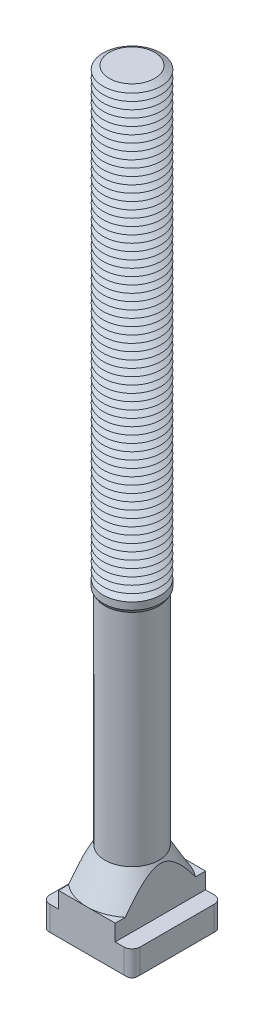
ISO-10303-21;
HEADER;
FILE_DESCRIPTION(('STEP AP214'),'2;1');
FILE_NAME('part.step','',(''),(''),'','','');
FILE_SCHEMA(('AUTOMOTIVE_DESIGN { 1 0 10303 214 1 1 1 1 }'));
ENDSEC;
DATA;
#1=APPLICATION_CONTEXT('core data for automotive mechanical design processes');
#2=APPLICATION_PROTOCOL_DEFINITION('international standard','automotive_design',2000,#1);
#3=PRODUCT_CONTEXT('',#1,'mechanical');
#4=PRODUCT('Part','Part','',(#3));
#5=PRODUCT_RELATED_PRODUCT_CATEGORY('part','',(#4));
#6=PRODUCT_DEFINITION_FORMATION('','',#4);
#7=PRODUCT_DEFINITION_CONTEXT('part definition',#1,'design');
#8=PRODUCT_DEFINITION('design','',#6,#7);
#9=PRODUCT_DEFINITION_SHAPE('','',#8);
#10=(LENGTH_UNIT() NAMED_UNIT(*) SI_UNIT(.MILLI.,.METRE.));
#11=(NAMED_UNIT(*) PLANE_ANGLE_UNIT() SI_UNIT($,.RADIAN.));
#12=(NAMED_UNIT(*) SI_UNIT($,.STERADIAN.) SOLID_ANGLE_UNIT());
#13=UNCERTAINTY_MEASURE_WITH_UNIT(LENGTH_MEASURE(1.E-05),#10,'distance_accuracy_value','');
#14=(GEOMETRIC_REPRESENTATION_CONTEXT(3) GLOBAL_UNCERTAINTY_ASSIGNED_CONTEXT((#13)) GLOBAL_UNIT_ASSIGNED_CONTEXT((#10,
#11,#12)) REPRESENTATION_CONTEXT('',''));
#15=CARTESIAN_POINT('',(0.,0.,0.));
#16=DIRECTION('',(0.,0.,1.));
#17=DIRECTION('',(1.,0.,0.));
#18=AXIS2_PLACEMENT_3D('',#15,#16,#17);
#19=CARTESIAN_POINT('',(0.,201.,0.));
#20=DIRECTION('',(0.,-1.,0.));
#21=DIRECTION('',(0.,0.,-1.));
#22=AXIS2_PLACEMENT_3D('',#19,#20,#21);
#23=CONICAL_SURFACE('',#22,6.26794919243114,1.0471975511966);
#24=CARTESIAN_POINT('',(0.,200.,0.));
#25=DIRECTION('',(0.,-1.,0.));
#26=DIRECTION('',(0.,0.,-1.));
#27=AXIS2_PLACEMENT_3D('',#24,#25,#26);
#28=CIRCLE('',#27,8.00000000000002);
#29=CARTESIAN_POINT('',(0.,200.,-8.00000000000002));
#30=VERTEX_POINT('',#29);
#31=EDGE_CURVE('E674',#30,#30,#28,.T.);
#32=ORIENTED_EDGE('',*,*,#31,.F.);
#33=EDGE_LOOP('',(#32));
#34=FACE_BOUND('',#33,.T.);
#35=CARTESIAN_POINT('',(0.,201.,0.));
#36=DIRECTION('',(0.,-1.,0.));
#37=DIRECTION('',(0.,0.,-1.));
#38=AXIS2_PLACEMENT_3D('',#35,#36,#37);
#39=CIRCLE('',#38,6.26794919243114);
#40=CARTESIAN_POINT('',(0.,201.,-6.26794919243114));
#41=VERTEX_POINT('',#40);
#42=EDGE_CURVE('E833',#41,#41,#39,.T.);
#43=ORIENTED_EDGE('',*,*,#42,.T.);
#44=EDGE_LOOP('',(#43));
#45=FACE_BOUND('',#44,.T.);
#46=ADVANCED_FACE('F39',(#34,#45),#23,.T.);
#47=CARTESIAN_POINT('',(0.,202.,0.));
#48=DIRECTION('',(0.,1.,0.));
#49=DIRECTION('',(0.,0.,1.));
#50=AXIS2_PLACEMENT_3D('',#47,#48,#49);
#51=CONICAL_SURFACE('',#50,8.00000000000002,1.0471975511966);
#52=ORIENTED_EDGE('',*,*,#42,.F.);
#53=EDGE_LOOP('',(#52));
#54=FACE_BOUND('',#53,.T.);
#55=CARTESIAN_POINT('',(0.,202.,0.));
#56=DIRECTION('',(0.,-1.,0.));
#57=DIRECTION('',(0.,0.,-1.));
#58=AXIS2_PLACEMENT_3D('',#55,#56,#57);
#59=CIRCLE('',#58,8.00000000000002);
#60=CARTESIAN_POINT('',(0.,202.,-8.00000000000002));
#61=VERTEX_POINT('',#60);
#62=EDGE_CURVE('E2457',#61,#61,#59,.T.);
#63=ORIENTED_EDGE('',*,*,#62,.T.);
#64=EDGE_LOOP('',(#63));
#65=FACE_BOUND('',#64,.T.);
#66=ADVANCED_FACE('F449',(#54,#65),#51,.T.);
#67=CARTESIAN_POINT('',(3.98596766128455,209.,0.));
#68=DIRECTION('',(0.,-1.,0.));
#69=DIRECTION('',(1.,0.,0.));
#70=AXIS2_PLACEMENT_3D('',#67,#68,#69);
#71=PLANE('',#70);
#72=CARTESIAN_POINT('',(0.,209.,0.));
#73=DIRECTION('',(0.,-1.,0.));
#74=DIRECTION('',(0.,0.,-1.));
#75=AXIS2_PLACEMENT_3D('',#72,#73,#74);
#76=CIRCLE('',#75,6.26794919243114);
#77=CARTESIAN_POINT('',(0.,209.,-6.26794919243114));
#78=VERTEX_POINT('',#77);
#79=EDGE_CURVE('E633',#78,#78,#76,.T.);
#80=ORIENTED_EDGE('',*,*,#79,.F.);
#81=EDGE_LOOP('',(#80));
#82=FACE_BOUND('',#81,.T.);
#83=ADVANCED_FACE('F455',(#82),#71,.F.);
#84=CARTESIAN_POINT('',(0.,209.,0.));
#85=DIRECTION('',(0.,-1.,0.));
#86=DIRECTION('',(0.,0.,-1.));
#87=AXIS2_PLACEMENT_3D('',#84,#85,#86);
#88=CONICAL_SURFACE('',#87,6.26794919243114,1.0471975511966);
#89=CARTESIAN_POINT('',(0.,208.,0.));
#90=DIRECTION('',(0.,-1.,0.));
#91=DIRECTION('',(0.,0.,-1.));
#92=AXIS2_PLACEMENT_3D('',#89,#90,#91);
#93=CIRCLE('',#92,8.00000000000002);
#94=CARTESIAN_POINT('',(0.,208.,-8.00000000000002));
#95=VERTEX_POINT('',#94);
#96=EDGE_CURVE('E908',#95,#95,#93,.T.);
#97=ORIENTED_EDGE('',*,*,#96,.F.);
#98=EDGE_LOOP('',(#97));
#99=FACE_BOUND('',#98,.T.);
#100=ORIENTED_EDGE('',*,*,#79,.T.);
#101=EDGE_LOOP('',(#100));
#102=FACE_BOUND('',#101,.T.);
#103=ADVANCED_FACE('F483',(#99,#102),#88,.T.);
#104=CARTESIAN_POINT('',(0.,208.,0.));
#105=DIRECTION('',(0.,1.,0.));
#106=DIRECTION('',(0.,0.,1.));
#107=AXIS2_PLACEMENT_3D('',#104,#105,#106);
#108=CONICAL_SURFACE('',#107,8.00000000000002,1.0471975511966);
#109=CARTESIAN_POINT('',(0.,207.,0.));
#110=DIRECTION('',(0.,-1.,0.));
#111=DIRECTION('',(0.,0.,-1.));
#112=AXIS2_PLACEMENT_3D('',#109,#110,#111);
#113=CIRCLE('',#112,6.26794919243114);
#114=CARTESIAN_POINT('',(0.,207.,-6.26794919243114));
#115=VERTEX_POINT('',#114);
#116=EDGE_CURVE('E902',#115,#115,#113,.T.);
#117=ORIENTED_EDGE('',*,*,#116,.F.);
#118=EDGE_LOOP('',(#117));
#119=FACE_BOUND('',#118,.T.);
#120=ORIENTED_EDGE('',*,*,#96,.T.);
#121=EDGE_LOOP('',(#120));
#122=FACE_BOUND('',#121,.T.);
#123=ADVANCED_FACE('F480',(#119,#122),#108,.T.);
#124=CARTESIAN_POINT('',(0.,207.,0.));
#125=DIRECTION('',(0.,-1.,0.));
#126=DIRECTION('',(0.,0.,-1.));
#127=AXIS2_PLACEMENT_3D('',#124,#125,#126);
#128=CONICAL_SURFACE('',#127,6.26794919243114,1.0471975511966);
#129=CARTESIAN_POINT('',(0.,206.,0.));
#130=DIRECTION('',(0.,-1.,0.));
#131=DIRECTION('',(0.,0.,-1.));
#132=AXIS2_PLACEMENT_3D('',#129,#130,#131);
#133=CIRCLE('',#132,8.00000000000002);
#134=CARTESIAN_POINT('',(0.,206.,-8.00000000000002));
#135=VERTEX_POINT('',#134);
#136=EDGE_CURVE('E898',#135,#135,#133,.T.);
#137=ORIENTED_EDGE('',*,*,#136,.F.);
#138=EDGE_LOOP('',(#137));
#139=FACE_BOUND('',#138,.T.);
#140=ORIENTED_EDGE('',*,*,#116,.T.);
#141=EDGE_LOOP('',(#140));
#142=FACE_BOUND('',#141,.T.);
#143=ADVANCED_FACE('F475',(#139,#142),#128,.T.);
#144=CARTESIAN_POINT('',(0.,206.,0.));
#145=DIRECTION('',(0.,1.,0.));
#146=DIRECTION('',(0.,0.,1.));
#147=AXIS2_PLACEMENT_3D('',#144,#145,#146);
#148=CONICAL_SURFACE('',#147,8.00000000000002,1.0471975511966);
#149=CARTESIAN_POINT('',(0.,205.,0.));
#150=DIRECTION('',(0.,-1.,0.));
#151=DIRECTION('',(0.,0.,-1.));
#152=AXIS2_PLACEMENT_3D('',#149,#150,#151);
#153=CIRCLE('',#152,6.26794919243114);
#154=CARTESIAN_POINT('',(0.,205.,-6.26794919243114));
#155=VERTEX_POINT('',#154);
#156=EDGE_CURVE('E896',#155,#155,#153,.T.);
#157=ORIENTED_EDGE('',*,*,#156,.F.);
#158=EDGE_LOOP('',(#157));
#159=FACE_BOUND('',#158,.T.);
#160=ORIENTED_EDGE('',*,*,#136,.T.);
#161=EDGE_LOOP('',(#160));
#162=FACE_BOUND('',#161,.T.);
#163=ADVANCED_FACE('F472',(#159,#162),#148,.T.);
#164=CARTESIAN_POINT('',(0.,205.,0.));
#165=DIRECTION('',(0.,-1.,0.));
#166=DIRECTION('',(0.,0.,-1.));
#167=AXIS2_PLACEMENT_3D('',#164,#165,#166);
#168=CONICAL_SURFACE('',#167,6.26794919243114,1.0471975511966);
#169=CARTESIAN_POINT('',(0.,204.,0.));
#170=DIRECTION('',(0.,-1.,0.));
#171=DIRECTION('',(0.,0.,-1.));
#172=AXIS2_PLACEMENT_3D('',#169,#170,#171);
#173=CIRCLE('',#172,8.00000000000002);
#174=CARTESIAN_POINT('',(0.,204.,-8.00000000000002));
#175=VERTEX_POINT('',#174);
#176=EDGE_CURVE('E899',#175,#175,#173,.T.);
#177=ORIENTED_EDGE('',*,*,#176,.F.);
#178=EDGE_LOOP('',(#177));
#179=FACE_BOUND('',#178,.T.);
#180=ORIENTED_EDGE('',*,*,#156,.T.);
#181=EDGE_LOOP('',(#180));
#182=FACE_BOUND('',#181,.T.);
#183=ADVANCED_FACE('F466',(#179,#182),#168,.T.);
#184=CARTESIAN_POINT('',(0.,204.,0.));
#185=DIRECTION('',(0.,1.,0.));
#186=DIRECTION('',(0.,0.,1.));
#187=AXIS2_PLACEMENT_3D('',#184,#185,#186);
#188=CONICAL_SURFACE('',#187,8.00000000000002,1.0471975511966);
#189=CARTESIAN_POINT('',(0.,203.,0.));
#190=DIRECTION('',(0.,-1.,0.));
#191=DIRECTION('',(0.,0.,-1.));
#192=AXIS2_PLACEMENT_3D('',#189,#190,#191);
#193=CIRCLE('',#192,6.26794919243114);
#194=CARTESIAN_POINT('',(0.,203.,-6.26794919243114));
#195=VERTEX_POINT('',#194);
#196=EDGE_CURVE('E2461',#195,#195,#193,.T.);
#197=ORIENTED_EDGE('',*,*,#196,.F.);
#198=EDGE_LOOP('',(#197));
#199=FACE_BOUND('',#198,.T.);
#200=ORIENTED_EDGE('',*,*,#176,.T.);
#201=EDGE_LOOP('',(#200));
#202=FACE_BOUND('',#201,.T.);
#203=ADVANCED_FACE('F462',(#199,#202),#188,.T.);
#204=CARTESIAN_POINT('',(0.,203.,0.));
#205=DIRECTION('',(0.,-1.,0.));
#206=DIRECTION('',(0.,0.,-1.));
#207=AXIS2_PLACEMENT_3D('',#204,#205,#206);
#208=CONICAL_SURFACE('',#207,6.26794919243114,1.0471975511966);
#209=ORIENTED_EDGE('',*,*,#62,.F.);
#210=EDGE_LOOP('',(#209));
#211=FACE_BOUND('',#210,.T.);
#212=ORIENTED_EDGE('',*,*,#196,.T.);
#213=EDGE_LOOP('',(#212));
#214=FACE_BOUND('',#213,.T.);
#215=ADVANCED_FACE('F465',(#211,#214),#208,.T.);
#216=CARTESIAN_POINT('',(0.,199.,0.));
#217=DIRECTION('',(0.,-1.,0.));
#218=DIRECTION('',(0.,0.,-1.));
#219=AXIS2_PLACEMENT_3D('',#216,#217,#218);
#220=CONICAL_SURFACE('',#219,6.26794919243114,1.0471975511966);
#221=CARTESIAN_POINT('',(0.,198.,0.));
#222=DIRECTION('',(0.,-1.,0.));
#223=DIRECTION('',(0.,0.,-1.));
#224=AXIS2_PLACEMENT_3D('',#221,#222,#223);
#225=CIRCLE('',#224,8.00000000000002);
#226=CARTESIAN_POINT('',(0.,198.,-8.00000000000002));
#227=VERTEX_POINT('',#226);
#228=EDGE_CURVE('E675',#227,#227,#225,.T.);
#229=ORIENTED_EDGE('',*,*,#228,.F.);
#230=EDGE_LOOP('',(#229));
#231=FACE_BOUND('',#230,.T.);
#232=CARTESIAN_POINT('',(0.,199.,0.));
#233=DIRECTION('',(0.,-1.,0.));
#234=DIRECTION('',(0.,0.,-1.));
#235=AXIS2_PLACEMENT_3D('',#232,#233,#234);
#236=CIRCLE('',#235,6.26794919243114);
#237=CARTESIAN_POINT('',(0.,199.,-6.26794919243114));
#238=VERTEX_POINT('',#237);
#239=EDGE_CURVE('E672',#238,#238,#236,.T.);
#240=ORIENTED_EDGE('',*,*,#239,.T.);
#241=EDGE_LOOP('',(#240));
#242=FACE_BOUND('',#241,.T.);
#243=ADVANCED_FACE('F470',(#231,#242),#220,.T.);
#244=CARTESIAN_POINT('',(0.,200.,0.));
#245=DIRECTION('',(0.,1.,0.));
#246=DIRECTION('',(0.,0.,1.));
#247=AXIS2_PLACEMENT_3D('',#244,#245,#246);
#248=CONICAL_SURFACE('',#247,8.00000000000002,1.0471975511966);
#249=ORIENTED_EDGE('',*,*,#239,.F.);
#250=EDGE_LOOP('',(#249));
#251=FACE_BOUND('',#250,.T.);
#252=ORIENTED_EDGE('',*,*,#31,.T.);
#253=EDGE_LOOP('',(#252));
#254=FACE_BOUND('',#253,.T.);
#255=ADVANCED_FACE('F2041',(#251,#254),#248,.T.);
#256=CARTESIAN_POINT('',(0.,197.,0.));
#257=DIRECTION('',(0.,-1.,0.));
#258=DIRECTION('',(0.,0.,-1.));
#259=AXIS2_PLACEMENT_3D('',#256,#257,#258);
#260=CONICAL_SURFACE('',#259,6.26794919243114,1.0471975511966);
#261=CARTESIAN_POINT('',(0.,196.,0.));
#262=DIRECTION('',(0.,-1.,0.));
#263=DIRECTION('',(0.,0.,-1.));
#264=AXIS2_PLACEMENT_3D('',#261,#262,#263);
#265=CIRCLE('',#264,8.00000000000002);
#266=CARTESIAN_POINT('',(0.,196.,-8.00000000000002));
#267=VERTEX_POINT('',#266);
#268=EDGE_CURVE('E728',#267,#267,#265,.T.);
#269=ORIENTED_EDGE('',*,*,#268,.F.);
#270=EDGE_LOOP('',(#269));
#271=FACE_BOUND('',#270,.T.);
#272=CARTESIAN_POINT('',(0.,197.,0.));
#273=DIRECTION('',(0.,-1.,0.));
#274=DIRECTION('',(0.,0.,-1.));
#275=AXIS2_PLACEMENT_3D('',#272,#273,#274);
#276=CIRCLE('',#275,6.26794919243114);
#277=CARTESIAN_POINT('',(0.,197.,-6.26794919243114));
#278=VERTEX_POINT('',#277);
#279=EDGE_CURVE('E730',#278,#278,#276,.T.);
#280=ORIENTED_EDGE('',*,*,#279,.T.);
#281=EDGE_LOOP('',(#280));
#282=FACE_BOUND('',#281,.T.);
#283=ADVANCED_FACE('F2032',(#271,#282),#260,.T.);
#284=CARTESIAN_POINT('',(0.,198.,0.));
#285=DIRECTION('',(0.,1.,0.));
#286=DIRECTION('',(0.,0.,1.));
#287=AXIS2_PLACEMENT_3D('',#284,#285,#286);
#288=CONICAL_SURFACE('',#287,8.00000000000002,1.0471975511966);
#289=ORIENTED_EDGE('',*,*,#279,.F.);
#290=EDGE_LOOP('',(#289));
#291=FACE_BOUND('',#290,.T.);
#292=ORIENTED_EDGE('',*,*,#228,.T.);
#293=EDGE_LOOP('',(#292));
#294=FACE_BOUND('',#293,.T.);
#295=ADVANCED_FACE('F2023',(#291,#294),#288,.T.);
#296=CARTESIAN_POINT('',(0.,195.,0.));
#297=DIRECTION('',(0.,-1.,0.));
#298=DIRECTION('',(0.,0.,-1.));
#299=AXIS2_PLACEMENT_3D('',#296,#297,#298);
#300=CONICAL_SURFACE('',#299,6.26794919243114,1.0471975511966);
#301=CARTESIAN_POINT('',(0.,194.,0.));
#302=DIRECTION('',(0.,-1.,0.));
#303=DIRECTION('',(0.,0.,-1.));
#304=AXIS2_PLACEMENT_3D('',#301,#302,#303);
#305=CIRCLE('',#304,8.00000000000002);
#306=CARTESIAN_POINT('',(0.,194.,-8.00000000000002));
#307=VERTEX_POINT('',#306);
#308=EDGE_CURVE('E789',#307,#307,#305,.T.);
#309=ORIENTED_EDGE('',*,*,#308,.F.);
#310=EDGE_LOOP('',(#309));
#311=FACE_BOUND('',#310,.T.);
#312=CARTESIAN_POINT('',(0.,195.,0.));
#313=DIRECTION('',(0.,-1.,0.));
#314=DIRECTION('',(0.,0.,-1.));
#315=AXIS2_PLACEMENT_3D('',#312,#313,#314);
#316=CIRCLE('',#315,6.26794919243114);
#317=CARTESIAN_POINT('',(0.,195.,-6.26794919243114));
#318=VERTEX_POINT('',#317);
#319=EDGE_CURVE('E731',#318,#318,#316,.T.);
#320=ORIENTED_EDGE('',*,*,#319,.T.);
#321=EDGE_LOOP('',(#320));
#322=FACE_BOUND('',#321,.T.);
#323=ADVANCED_FACE('F2014',(#311,#322),#300,.T.);
#324=CARTESIAN_POINT('',(0.,196.,0.));
#325=DIRECTION('',(0.,1.,0.));
#326=DIRECTION('',(0.,0.,1.));
#327=AXIS2_PLACEMENT_3D('',#324,#325,#326);
#328=CONICAL_SURFACE('',#327,8.00000000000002,1.0471975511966);
#329=ORIENTED_EDGE('',*,*,#319,.F.);
#330=EDGE_LOOP('',(#329));
#331=FACE_BOUND('',#330,.T.);
#332=ORIENTED_EDGE('',*,*,#268,.T.);
#333=EDGE_LOOP('',(#332));
#334=FACE_BOUND('',#333,.T.);
#335=ADVANCED_FACE('F2005',(#331,#334),#328,.T.);
#336=CARTESIAN_POINT('',(0.,193.,0.));
#337=DIRECTION('',(0.,-1.,0.));
#338=DIRECTION('',(0.,0.,-1.));
#339=AXIS2_PLACEMENT_3D('',#336,#337,#338);
#340=CONICAL_SURFACE('',#339,6.26794919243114,1.0471975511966);
#341=CARTESIAN_POINT('',(0.,192.,0.));
#342=DIRECTION('',(0.,-1.,0.));
#343=DIRECTION('',(0.,0.,-1.));
#344=AXIS2_PLACEMENT_3D('',#341,#342,#343);
#345=CIRCLE('',#344,8.00000000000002);
#346=CARTESIAN_POINT('',(0.,192.,-8.00000000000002));
#347=VERTEX_POINT('',#346);
#348=EDGE_CURVE('E894',#347,#347,#345,.T.);
#349=ORIENTED_EDGE('',*,*,#348,.F.);
#350=EDGE_LOOP('',(#349));
#351=FACE_BOUND('',#350,.T.);
#352=CARTESIAN_POINT('',(0.,193.,0.));
#353=DIRECTION('',(0.,-1.,0.));
#354=DIRECTION('',(0.,0.,-1.));
#355=AXIS2_PLACEMENT_3D('',#352,#353,#354);
#356=CIRCLE('',#355,6.26794919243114);
#357=CARTESIAN_POINT('',(0.,193.,-6.26794919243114));
#358=VERTEX_POINT('',#357);
#359=EDGE_CURVE('E891',#358,#358,#356,.T.);
#360=ORIENTED_EDGE('',*,*,#359,.T.);
#361=EDGE_LOOP('',(#360));
#362=FACE_BOUND('',#361,.T.);
#363=ADVANCED_FACE('F1996',(#351,#362),#340,.T.);
#364=CARTESIAN_POINT('',(0.,194.,0.));
#365=DIRECTION('',(0.,1.,0.));
#366=DIRECTION('',(0.,0.,1.));
#367=AXIS2_PLACEMENT_3D('',#364,#365,#366);
#368=CONICAL_SURFACE('',#367,8.00000000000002,1.0471975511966);
#369=ORIENTED_EDGE('',*,*,#359,.F.);
#370=EDGE_LOOP('',(#369));
#371=FACE_BOUND('',#370,.T.);
#372=ORIENTED_EDGE('',*,*,#308,.T.);
#373=EDGE_LOOP('',(#372));
#374=FACE_BOUND('',#373,.T.);
#375=ADVANCED_FACE('F1987',(#371,#374),#368,.T.);
#376=CARTESIAN_POINT('',(0.,191.,0.));
#377=DIRECTION('',(0.,-1.,0.));
#378=DIRECTION('',(0.,0.,-1.));
#379=AXIS2_PLACEMENT_3D('',#376,#377,#378);
#380=CONICAL_SURFACE('',#379,6.26794919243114,1.0471975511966);
#381=CARTESIAN_POINT('',(0.,190.,0.));
#382=DIRECTION('',(0.,-1.,0.));
#383=DIRECTION('',(0.,0.,-1.));
#384=AXIS2_PLACEMENT_3D('',#381,#382,#383);
#385=CIRCLE('',#384,8.00000000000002);
#386=CARTESIAN_POINT('',(0.,190.,-8.00000000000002));
#387=VERTEX_POINT('',#386);
#388=EDGE_CURVE('E722',#387,#387,#385,.T.);
#389=ORIENTED_EDGE('',*,*,#388,.F.);
#390=EDGE_LOOP('',(#389));
#391=FACE_BOUND('',#390,.T.);
#392=CARTESIAN_POINT('',(0.,191.,0.));
#393=DIRECTION('',(0.,-1.,0.));
#394=DIRECTION('',(0.,0.,-1.));
#395=AXIS2_PLACEMENT_3D('',#392,#393,#394);
#396=CIRCLE('',#395,6.26794919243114);
#397=CARTESIAN_POINT('',(0.,191.,-6.26794919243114));
#398=VERTEX_POINT('',#397);
#399=EDGE_CURVE('E725',#398,#398,#396,.T.);
#400=ORIENTED_EDGE('',*,*,#399,.T.);
#401=EDGE_LOOP('',(#400));
#402=FACE_BOUND('',#401,.T.);
#403=ADVANCED_FACE('F1978',(#391,#402),#380,.T.);
#404=CARTESIAN_POINT('',(0.,192.,0.));
#405=DIRECTION('',(0.,1.,0.));
#406=DIRECTION('',(0.,0.,1.));
#407=AXIS2_PLACEMENT_3D('',#404,#405,#406);
#408=CONICAL_SURFACE('',#407,8.00000000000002,1.0471975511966);
#409=ORIENTED_EDGE('',*,*,#399,.F.);
#410=EDGE_LOOP('',(#409));
#411=FACE_BOUND('',#410,.T.);
#412=ORIENTED_EDGE('',*,*,#348,.T.);
#413=EDGE_LOOP('',(#412));
#414=FACE_BOUND('',#413,.T.);
#415=ADVANCED_FACE('F1969',(#411,#414),#408,.T.);
#416=CARTESIAN_POINT('',(0.,189.,0.));
#417=DIRECTION('',(0.,-1.,0.));
#418=DIRECTION('',(0.,0.,-1.));
#419=AXIS2_PLACEMENT_3D('',#416,#417,#418);
#420=CONICAL_SURFACE('',#419,6.26794919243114,1.0471975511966);
#421=CARTESIAN_POINT('',(0.,188.,0.));
#422=DIRECTION('',(0.,-1.,0.));
#423=DIRECTION('',(0.,0.,-1.));
#424=AXIS2_PLACEMENT_3D('',#421,#422,#423);
#425=CIRCLE('',#424,8.00000000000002);
#426=CARTESIAN_POINT('',(0.,188.,-8.00000000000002));
#427=VERTEX_POINT('',#426);
#428=EDGE_CURVE('E2495',#427,#427,#425,.T.);
#429=ORIENTED_EDGE('',*,*,#428,.F.);
#430=EDGE_LOOP('',(#429));
#431=FACE_BOUND('',#430,.T.);
#432=CARTESIAN_POINT('',(0.,189.,0.));
#433=DIRECTION('',(0.,-1.,0.));
#434=DIRECTION('',(0.,0.,-1.));
#435=AXIS2_PLACEMENT_3D('',#432,#433,#434);
#436=CIRCLE('',#435,6.26794919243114);
#437=CARTESIAN_POINT('',(0.,189.,-6.26794919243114));
#438=VERTEX_POINT('',#437);
#439=EDGE_CURVE('E726',#438,#438,#436,.T.);
#440=ORIENTED_EDGE('',*,*,#439,.T.);
#441=EDGE_LOOP('',(#440));
#442=FACE_BOUND('',#441,.T.);
#443=ADVANCED_FACE('F1960',(#431,#442),#420,.T.);
#444=CARTESIAN_POINT('',(0.,190.,0.));
#445=DIRECTION('',(0.,1.,0.));
#446=DIRECTION('',(0.,0.,1.));
#447=AXIS2_PLACEMENT_3D('',#444,#445,#446);
#448=CONICAL_SURFACE('',#447,8.00000000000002,1.0471975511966);
#449=ORIENTED_EDGE('',*,*,#439,.F.);
#450=EDGE_LOOP('',(#449));
#451=FACE_BOUND('',#450,.T.);
#452=ORIENTED_EDGE('',*,*,#388,.T.);
#453=EDGE_LOOP('',(#452));
#454=FACE_BOUND('',#453,.T.);
#455=ADVANCED_FACE('F1951',(#451,#454),#448,.T.);
#456=CARTESIAN_POINT('',(0.,187.,0.));
#457=DIRECTION('',(0.,-1.,0.));
#458=DIRECTION('',(0.,0.,-1.));
#459=AXIS2_PLACEMENT_3D('',#456,#457,#458);
#460=CONICAL_SURFACE('',#459,6.26794919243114,1.0471975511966);
#461=CARTESIAN_POINT('',(0.,186.,0.));
#462=DIRECTION('',(0.,-1.,0.));
#463=DIRECTION('',(0.,0.,-1.));
#464=AXIS2_PLACEMENT_3D('',#461,#462,#463);
#465=CIRCLE('',#464,8.00000000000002);
#466=CARTESIAN_POINT('',(0.,186.,-8.00000000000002));
#467=VERTEX_POINT('',#466);
#468=EDGE_CURVE('E784',#467,#467,#465,.T.);
#469=ORIENTED_EDGE('',*,*,#468,.F.);
#470=EDGE_LOOP('',(#469));
#471=FACE_BOUND('',#470,.T.);
#472=CARTESIAN_POINT('',(0.,187.,0.));
#473=DIRECTION('',(0.,-1.,0.));
#474=DIRECTION('',(0.,0.,-1.));
#475=AXIS2_PLACEMENT_3D('',#472,#473,#474);
#476=CIRCLE('',#475,6.26794919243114);
#477=CARTESIAN_POINT('',(0.,187.,-6.26794919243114));
#478=VERTEX_POINT('',#477);
#479=EDGE_CURVE('E2497',#478,#478,#476,.T.);
#480=ORIENTED_EDGE('',*,*,#479,.T.);
#481=EDGE_LOOP('',(#480));
#482=FACE_BOUND('',#481,.T.);
#483=ADVANCED_FACE('F1942',(#471,#482),#460,.T.);
#484=CARTESIAN_POINT('',(0.,188.,0.));
#485=DIRECTION('',(0.,1.,0.));
#486=DIRECTION('',(0.,0.,1.));
#487=AXIS2_PLACEMENT_3D('',#484,#485,#486);
#488=CONICAL_SURFACE('',#487,8.00000000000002,1.0471975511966);
#489=ORIENTED_EDGE('',*,*,#479,.F.);
#490=EDGE_LOOP('',(#489));
#491=FACE_BOUND('',#490,.T.);
#492=ORIENTED_EDGE('',*,*,#428,.T.);
#493=EDGE_LOOP('',(#492));
#494=FACE_BOUND('',#493,.T.);
#495=ADVANCED_FACE('F1933',(#491,#494),#488,.T.);
#496=CARTESIAN_POINT('',(0.,185.,0.));
#497=DIRECTION('',(0.,-1.,0.));
#498=DIRECTION('',(0.,0.,-1.));
#499=AXIS2_PLACEMENT_3D('',#496,#497,#498);
#500=CONICAL_SURFACE('',#499,6.26794919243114,1.0471975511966);
#501=CARTESIAN_POINT('',(0.,184.,0.));
#502=DIRECTION('',(0.,-1.,0.));
#503=DIRECTION('',(0.,0.,-1.));
#504=AXIS2_PLACEMENT_3D('',#501,#502,#503);
#505=CIRCLE('',#504,8.00000000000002);
#506=CARTESIAN_POINT('',(0.,184.,-8.00000000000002));
#507=VERTEX_POINT('',#506);
#508=EDGE_CURVE('E785',#507,#507,#505,.T.);
#509=ORIENTED_EDGE('',*,*,#508,.F.);
#510=EDGE_LOOP('',(#509));
#511=FACE_BOUND('',#510,.T.);
#512=CARTESIAN_POINT('',(0.,185.,0.));
#513=DIRECTION('',(0.,-1.,0.));
#514=DIRECTION('',(0.,0.,-1.));
#515=AXIS2_PLACEMENT_3D('',#512,#513,#514);
#516=CIRCLE('',#515,6.26794919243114);
#517=CARTESIAN_POINT('',(0.,185.,-6.26794919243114));
#518=VERTEX_POINT('',#517);
#519=EDGE_CURVE('E781',#518,#518,#516,.T.);
#520=ORIENTED_EDGE('',*,*,#519,.T.);
#521=EDGE_LOOP('',(#520));
#522=FACE_BOUND('',#521,.T.);
#523=ADVANCED_FACE('F1924',(#511,#522),#500,.T.);
#524=CARTESIAN_POINT('',(0.,186.,0.));
#525=DIRECTION('',(0.,1.,0.));
#526=DIRECTION('',(0.,0.,1.));
#527=AXIS2_PLACEMENT_3D('',#524,#525,#526);
#528=CONICAL_SURFACE('',#527,8.00000000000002,1.0471975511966);
#529=ORIENTED_EDGE('',*,*,#519,.F.);
#530=EDGE_LOOP('',(#529));
#531=FACE_BOUND('',#530,.T.);
#532=ORIENTED_EDGE('',*,*,#468,.T.);
#533=EDGE_LOOP('',(#532));
#534=FACE_BOUND('',#533,.T.);
#535=ADVANCED_FACE('F1915',(#531,#534),#528,.T.);
#536=CARTESIAN_POINT('',(0.,183.,0.));
#537=DIRECTION('',(0.,-1.,0.));
#538=DIRECTION('',(0.,0.,-1.));
#539=AXIS2_PLACEMENT_3D('',#536,#537,#538);
#540=CONICAL_SURFACE('',#539,6.26794919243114,1.0471975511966);
#541=CARTESIAN_POINT('',(0.,182.,0.));
#542=DIRECTION('',(0.,-1.,0.));
#543=DIRECTION('',(0.,0.,-1.));
#544=AXIS2_PLACEMENT_3D('',#541,#542,#543);
#545=CIRCLE('',#544,8.00000000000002);
#546=CARTESIAN_POINT('',(0.,182.,-8.00000000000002));
#547=VERTEX_POINT('',#546);
#548=EDGE_CURVE('E720',#547,#547,#545,.T.);
#549=ORIENTED_EDGE('',*,*,#548,.F.);
#550=EDGE_LOOP('',(#549));
#551=FACE_BOUND('',#550,.T.);
#552=CARTESIAN_POINT('',(0.,183.,0.));
#553=DIRECTION('',(0.,-1.,0.));
#554=DIRECTION('',(0.,0.,-1.));
#555=AXIS2_PLACEMENT_3D('',#552,#553,#554);
#556=CIRCLE('',#555,6.26794919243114);
#557=CARTESIAN_POINT('',(0.,183.,-6.26794919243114));
#558=VERTEX_POINT('',#557);
#559=EDGE_CURVE('E2513',#558,#558,#556,.T.);
#560=ORIENTED_EDGE('',*,*,#559,.T.);
#561=EDGE_LOOP('',(#560));
#562=FACE_BOUND('',#561,.T.);
#563=ADVANCED_FACE('F1906',(#551,#562),#540,.T.);
#564=CARTESIAN_POINT('',(0.,184.,0.));
#565=DIRECTION('',(0.,1.,0.));
#566=DIRECTION('',(0.,0.,1.));
#567=AXIS2_PLACEMENT_3D('',#564,#565,#566);
#568=CONICAL_SURFACE('',#567,8.00000000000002,1.0471975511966);
#569=ORIENTED_EDGE('',*,*,#559,.F.);
#570=EDGE_LOOP('',(#569));
#571=FACE_BOUND('',#570,.T.);
#572=ORIENTED_EDGE('',*,*,#508,.T.);
#573=EDGE_LOOP('',(#572));
#574=FACE_BOUND('',#573,.T.);
#575=ADVANCED_FACE('F1897',(#571,#574),#568,.T.);
#576=CARTESIAN_POINT('',(0.,181.,0.));
#577=DIRECTION('',(0.,-1.,0.));
#578=DIRECTION('',(0.,0.,-1.));
#579=AXIS2_PLACEMENT_3D('',#576,#577,#578);
#580=CONICAL_SURFACE('',#579,6.26794919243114,1.0471975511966);
#581=CARTESIAN_POINT('',(0.,180.,0.));
#582=DIRECTION('',(0.,-1.,0.));
#583=DIRECTION('',(0.,0.,-1.));
#584=AXIS2_PLACEMENT_3D('',#581,#582,#583);
#585=CIRCLE('',#584,8.00000000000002);
#586=CARTESIAN_POINT('',(0.,180.,-8.00000000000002));
#587=VERTEX_POINT('',#586);
#588=EDGE_CURVE('E669',#587,#587,#585,.T.);
#589=ORIENTED_EDGE('',*,*,#588,.F.);
#590=EDGE_LOOP('',(#589));
#591=FACE_BOUND('',#590,.T.);
#592=CARTESIAN_POINT('',(0.,181.,0.));
#593=DIRECTION('',(0.,-1.,0.));
#594=DIRECTION('',(0.,0.,-1.));
#595=AXIS2_PLACEMENT_3D('',#592,#593,#594);
#596=CIRCLE('',#595,6.26794919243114);
#597=CARTESIAN_POINT('',(0.,181.,-6.26794919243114));
#598=VERTEX_POINT('',#597);
#599=EDGE_CURVE('E717',#598,#598,#596,.T.);
#600=ORIENTED_EDGE('',*,*,#599,.T.);
#601=EDGE_LOOP('',(#600));
#602=FACE_BOUND('',#601,.T.);
#603=ADVANCED_FACE('F1888',(#591,#602),#580,.T.);
#604=CARTESIAN_POINT('',(0.,182.,0.));
#605=DIRECTION('',(0.,1.,0.));
#606=DIRECTION('',(0.,0.,1.));
#607=AXIS2_PLACEMENT_3D('',#604,#605,#606);
#608=CONICAL_SURFACE('',#607,8.00000000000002,1.0471975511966);
#609=ORIENTED_EDGE('',*,*,#599,.F.);
#610=EDGE_LOOP('',(#609));
#611=FACE_BOUND('',#610,.T.);
#612=ORIENTED_EDGE('',*,*,#548,.T.);
#613=EDGE_LOOP('',(#612));
#614=FACE_BOUND('',#613,.T.);
#615=ADVANCED_FACE('F1879',(#611,#614),#608,.T.);
#616=CARTESIAN_POINT('',(0.,179.,0.));
#617=DIRECTION('',(0.,-1.,0.));
#618=DIRECTION('',(0.,0.,-1.));
#619=AXIS2_PLACEMENT_3D('',#616,#617,#618);
#620=CONICAL_SURFACE('',#619,6.26794919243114,1.0471975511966);
#621=CARTESIAN_POINT('',(0.,178.,0.));
#622=DIRECTION('',(0.,-1.,0.));
#623=DIRECTION('',(0.,0.,-1.));
#624=AXIS2_PLACEMENT_3D('',#621,#622,#623);
#625=CIRCLE('',#624,8.00000000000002);
#626=CARTESIAN_POINT('',(0.,178.,-8.00000000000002));
#627=VERTEX_POINT('',#626);
#628=EDGE_CURVE('E670',#627,#627,#625,.T.);
#629=ORIENTED_EDGE('',*,*,#628,.F.);
#630=EDGE_LOOP('',(#629));
#631=FACE_BOUND('',#630,.T.);
#632=CARTESIAN_POINT('',(0.,179.,0.));
#633=DIRECTION('',(0.,-1.,0.));
#634=DIRECTION('',(0.,0.,-1.));
#635=AXIS2_PLACEMENT_3D('',#632,#633,#634);
#636=CIRCLE('',#635,6.26794919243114);
#637=CARTESIAN_POINT('',(0.,179.,-6.26794919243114));
#638=VERTEX_POINT('',#637);
#639=EDGE_CURVE('E666',#638,#638,#636,.T.);
#640=ORIENTED_EDGE('',*,*,#639,.T.);
#641=EDGE_LOOP('',(#640));
#642=FACE_BOUND('',#641,.T.);
#643=ADVANCED_FACE('F1870',(#631,#642),#620,.T.);
#644=CARTESIAN_POINT('',(0.,180.,0.));
#645=DIRECTION('',(0.,1.,0.));
#646=DIRECTION('',(0.,0.,1.));
#647=AXIS2_PLACEMENT_3D('',#644,#645,#646);
#648=CONICAL_SURFACE('',#647,8.00000000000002,1.0471975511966);
#649=ORIENTED_EDGE('',*,*,#639,.F.);
#650=EDGE_LOOP('',(#649));
#651=FACE_BOUND('',#650,.T.);
#652=ORIENTED_EDGE('',*,*,#588,.T.);
#653=EDGE_LOOP('',(#652));
#654=FACE_BOUND('',#653,.T.);
#655=ADVANCED_FACE('F1861',(#651,#654),#648,.T.);
#656=CARTESIAN_POINT('',(0.,177.,0.));
#657=DIRECTION('',(0.,-1.,0.));
#658=DIRECTION('',(0.,0.,-1.));
#659=AXIS2_PLACEMENT_3D('',#656,#657,#658);
#660=CONICAL_SURFACE('',#659,6.26794919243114,1.0471975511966);
#661=CARTESIAN_POINT('',(0.,176.,0.));
#662=DIRECTION('',(0.,-1.,0.));
#663=DIRECTION('',(0.,0.,-1.));
#664=AXIS2_PLACEMENT_3D('',#661,#662,#663);
#665=CIRCLE('',#664,8.00000000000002);
#666=CARTESIAN_POINT('',(0.,176.,-8.00000000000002));
#667=VERTEX_POINT('',#666);
#668=EDGE_CURVE('E2489',#667,#667,#665,.T.);
#669=ORIENTED_EDGE('',*,*,#668,.F.);
#670=EDGE_LOOP('',(#669));
#671=FACE_BOUND('',#670,.T.);
#672=CARTESIAN_POINT('',(0.,177.,0.));
#673=DIRECTION('',(0.,-1.,0.));
#674=DIRECTION('',(0.,0.,-1.));
#675=AXIS2_PLACEMENT_3D('',#672,#673,#674);
#676=CIRCLE('',#675,6.26794919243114);
#677=CARTESIAN_POINT('',(0.,177.,-6.26794919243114));
#678=VERTEX_POINT('',#677);
#679=EDGE_CURVE('E2493',#678,#678,#676,.T.);
#680=ORIENTED_EDGE('',*,*,#679,.T.);
#681=EDGE_LOOP('',(#680));
#682=FACE_BOUND('',#681,.T.);
#683=ADVANCED_FACE('F1852',(#671,#682),#660,.T.);
#684=CARTESIAN_POINT('',(0.,178.,0.));
#685=DIRECTION('',(0.,1.,0.));
#686=DIRECTION('',(0.,0.,1.));
#687=AXIS2_PLACEMENT_3D('',#684,#685,#686);
#688=CONICAL_SURFACE('',#687,8.00000000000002,1.0471975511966);
#689=ORIENTED_EDGE('',*,*,#679,.F.);
#690=EDGE_LOOP('',(#689));
#691=FACE_BOUND('',#690,.T.);
#692=ORIENTED_EDGE('',*,*,#628,.T.);
#693=EDGE_LOOP('',(#692));
#694=FACE_BOUND('',#693,.T.);
#695=ADVANCED_FACE('F1843',(#691,#694),#688,.T.);
#696=CARTESIAN_POINT('',(0.,175.,0.));
#697=DIRECTION('',(0.,-1.,0.));
#698=DIRECTION('',(0.,0.,-1.));
#699=AXIS2_PLACEMENT_3D('',#696,#697,#698);
#700=CONICAL_SURFACE('',#699,6.26794919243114,1.0471975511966);
#701=CARTESIAN_POINT('',(0.,174.,0.));
#702=DIRECTION('',(0.,-1.,0.));
#703=DIRECTION('',(0.,0.,-1.));
#704=AXIS2_PLACEMENT_3D('',#701,#702,#703);
#705=CIRCLE('',#704,8.00000000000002);
#706=CARTESIAN_POINT('',(0.,174.,-8.00000000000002));
#707=VERTEX_POINT('',#706);
#708=EDGE_CURVE('E826',#707,#707,#705,.T.);
#709=ORIENTED_EDGE('',*,*,#708,.F.);
#710=EDGE_LOOP('',(#709));
#711=FACE_BOUND('',#710,.T.);
#712=CARTESIAN_POINT('',(0.,175.,0.));
#713=DIRECTION('',(0.,-1.,0.));
#714=DIRECTION('',(0.,0.,-1.));
#715=AXIS2_PLACEMENT_3D('',#712,#713,#714);
#716=CIRCLE('',#715,6.26794919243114);
#717=CARTESIAN_POINT('',(0.,175.,-6.26794919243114));
#718=VERTEX_POINT('',#717);
#719=EDGE_CURVE('E829',#718,#718,#716,.T.);
#720=ORIENTED_EDGE('',*,*,#719,.T.);
#721=EDGE_LOOP('',(#720));
#722=FACE_BOUND('',#721,.T.);
#723=ADVANCED_FACE('F1834',(#711,#722),#700,.T.);
#724=CARTESIAN_POINT('',(0.,176.,0.));
#725=DIRECTION('',(0.,1.,0.));
#726=DIRECTION('',(0.,0.,1.));
#727=AXIS2_PLACEMENT_3D('',#724,#725,#726);
#728=CONICAL_SURFACE('',#727,8.00000000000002,1.0471975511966);
#729=ORIENTED_EDGE('',*,*,#719,.F.);
#730=EDGE_LOOP('',(#729));
#731=FACE_BOUND('',#730,.T.);
#732=ORIENTED_EDGE('',*,*,#668,.T.);
#733=EDGE_LOOP('',(#732));
#734=FACE_BOUND('',#733,.T.);
#735=ADVANCED_FACE('F1825',(#731,#734),#728,.T.);
#736=CARTESIAN_POINT('',(0.,173.,0.));
#737=DIRECTION('',(0.,-1.,0.));
#738=DIRECTION('',(0.,0.,-1.));
#739=AXIS2_PLACEMENT_3D('',#736,#737,#738);
#740=CONICAL_SURFACE('',#739,6.26794919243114,1.0471975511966);
#741=CARTESIAN_POINT('',(0.,172.,0.));
#742=DIRECTION('',(0.,-1.,0.));
#743=DIRECTION('',(0.,0.,-1.));
#744=AXIS2_PLACEMENT_3D('',#741,#742,#743);
#745=CIRCLE('',#744,8.00000000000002);
#746=CARTESIAN_POINT('',(0.,172.,-8.00000000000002));
#747=VERTEX_POINT('',#746);
#748=EDGE_CURVE('E2568',#747,#747,#745,.T.);
#749=ORIENTED_EDGE('',*,*,#748,.F.);
#750=EDGE_LOOP('',(#749));
#751=FACE_BOUND('',#750,.T.);
#752=CARTESIAN_POINT('',(0.,173.,0.));
#753=DIRECTION('',(0.,-1.,0.));
#754=DIRECTION('',(0.,0.,-1.));
#755=AXIS2_PLACEMENT_3D('',#752,#753,#754);
#756=CIRCLE('',#755,6.26794919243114);
#757=CARTESIAN_POINT('',(0.,173.,-6.26794919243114));
#758=VERTEX_POINT('',#757);
#759=EDGE_CURVE('E830',#758,#758,#756,.T.);
#760=ORIENTED_EDGE('',*,*,#759,.T.);
#761=EDGE_LOOP('',(#760));
#762=FACE_BOUND('',#761,.T.);
#763=ADVANCED_FACE('F1816',(#751,#762),#740,.T.);
#764=CARTESIAN_POINT('',(0.,174.,0.));
#765=DIRECTION('',(0.,1.,0.));
#766=DIRECTION('',(0.,0.,1.));
#767=AXIS2_PLACEMENT_3D('',#764,#765,#766);
#768=CONICAL_SURFACE('',#767,8.00000000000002,1.0471975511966);
#769=ORIENTED_EDGE('',*,*,#759,.F.);
#770=EDGE_LOOP('',(#769));
#771=FACE_BOUND('',#770,.T.);
#772=ORIENTED_EDGE('',*,*,#708,.T.);
#773=EDGE_LOOP('',(#772));
#774=FACE_BOUND('',#773,.T.);
#775=ADVANCED_FACE('F1807',(#771,#774),#768,.T.);
#776=CARTESIAN_POINT('',(0.,171.,0.));
#777=DIRECTION('',(0.,-1.,0.));
#778=DIRECTION('',(0.,0.,-1.));
#779=AXIS2_PLACEMENT_3D('',#776,#777,#778);
#780=CONICAL_SURFACE('',#779,6.26794919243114,1.0471975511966);
#781=CARTESIAN_POINT('',(0.,170.,0.));
#782=DIRECTION('',(0.,-1.,0.));
#783=DIRECTION('',(0.,0.,-1.));
#784=AXIS2_PLACEMENT_3D('',#781,#782,#783);
#785=CIRCLE('',#784,8.00000000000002);
#786=CARTESIAN_POINT('',(0.,170.,-8.00000000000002));
#787=VERTEX_POINT('',#786);
#788=EDGE_CURVE('E2569',#787,#787,#785,.T.);
#789=ORIENTED_EDGE('',*,*,#788,.F.);
#790=EDGE_LOOP('',(#789));
#791=FACE_BOUND('',#790,.T.);
#792=CARTESIAN_POINT('',(0.,171.,0.));
#793=DIRECTION('',(0.,-1.,0.));
#794=DIRECTION('',(0.,0.,-1.));
#795=AXIS2_PLACEMENT_3D('',#792,#793,#794);
#796=CIRCLE('',#795,6.26794919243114);
#797=CARTESIAN_POINT('',(0.,171.,-6.26794919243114));
#798=VERTEX_POINT('',#797);
#799=EDGE_CURVE('E2565',#798,#798,#796,.T.);
#800=ORIENTED_EDGE('',*,*,#799,.T.);
#801=EDGE_LOOP('',(#800));
#802=FACE_BOUND('',#801,.T.);
#803=ADVANCED_FACE('F1798',(#791,#802),#780,.T.);
#804=CARTESIAN_POINT('',(0.,172.,0.));
#805=DIRECTION('',(0.,1.,0.));
#806=DIRECTION('',(0.,0.,1.));
#807=AXIS2_PLACEMENT_3D('',#804,#805,#806);
#808=CONICAL_SURFACE('',#807,8.00000000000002,1.0471975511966);
#809=ORIENTED_EDGE('',*,*,#799,.F.);
#810=EDGE_LOOP('',(#809));
#811=FACE_BOUND('',#810,.T.);
#812=ORIENTED_EDGE('',*,*,#748,.T.);
#813=EDGE_LOOP('',(#812));
#814=FACE_BOUND('',#813,.T.);
#815=ADVANCED_FACE('F1789',(#811,#814),#808,.T.);
#816=CARTESIAN_POINT('',(0.,169.,0.));
#817=DIRECTION('',(0.,-1.,0.));
#818=DIRECTION('',(0.,0.,-1.));
#819=AXIS2_PLACEMENT_3D('',#816,#817,#818);
#820=CONICAL_SURFACE('',#819,6.26794919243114,1.0471975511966);
#821=CARTESIAN_POINT('',(0.,168.,0.));
#822=DIRECTION('',(0.,-1.,0.));
#823=DIRECTION('',(0.,0.,-1.));
#824=AXIS2_PLACEMENT_3D('',#821,#822,#823);
#825=CIRCLE('',#824,8.00000000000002);
#826=CARTESIAN_POINT('',(0.,168.,-8.00000000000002));
#827=VERTEX_POINT('',#826);
#828=EDGE_CURVE('E663',#827,#827,#825,.T.);
#829=ORIENTED_EDGE('',*,*,#828,.F.);
#830=EDGE_LOOP('',(#829));
#831=FACE_BOUND('',#830,.T.);
#832=CARTESIAN_POINT('',(0.,169.,0.));
#833=DIRECTION('',(0.,-1.,0.));
#834=DIRECTION('',(0.,0.,-1.));
#835=AXIS2_PLACEMENT_3D('',#832,#833,#834);
#836=CIRCLE('',#835,6.26794919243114);
#837=CARTESIAN_POINT('',(0.,169.,-6.26794919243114));
#838=VERTEX_POINT('',#837);
#839=EDGE_CURVE('E824',#838,#838,#836,.T.);
#840=ORIENTED_EDGE('',*,*,#839,.T.);
#841=EDGE_LOOP('',(#840));
#842=FACE_BOUND('',#841,.T.);
#843=ADVANCED_FACE('F1780',(#831,#842),#820,.T.);
#844=CARTESIAN_POINT('',(0.,170.,0.));
#845=DIRECTION('',(0.,1.,0.));
#846=DIRECTION('',(0.,0.,1.));
#847=AXIS2_PLACEMENT_3D('',#844,#845,#846);
#848=CONICAL_SURFACE('',#847,8.00000000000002,1.0471975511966);
#849=ORIENTED_EDGE('',*,*,#839,.F.);
#850=EDGE_LOOP('',(#849));
#851=FACE_BOUND('',#850,.T.);
#852=ORIENTED_EDGE('',*,*,#788,.T.);
#853=EDGE_LOOP('',(#852));
#854=FACE_BOUND('',#853,.T.);
#855=ADVANCED_FACE('F1771',(#851,#854),#848,.T.);
#856=CARTESIAN_POINT('',(0.,167.,0.));
#857=DIRECTION('',(0.,-1.,0.));
#858=DIRECTION('',(0.,0.,-1.));
#859=AXIS2_PLACEMENT_3D('',#856,#857,#858);
#860=CONICAL_SURFACE('',#859,6.26794919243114,1.0471975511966);
#861=CARTESIAN_POINT('',(0.,166.,0.));
#862=DIRECTION('',(0.,-1.,0.));
#863=DIRECTION('',(0.,0.,-1.));
#864=AXIS2_PLACEMENT_3D('',#861,#862,#863);
#865=CIRCLE('',#864,8.00000000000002);
#866=CARTESIAN_POINT('',(0.,166.,-8.00000000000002));
#867=VERTEX_POINT('',#866);
#868=EDGE_CURVE('E664',#867,#867,#865,.T.);
#869=ORIENTED_EDGE('',*,*,#868,.F.);
#870=EDGE_LOOP('',(#869));
#871=FACE_BOUND('',#870,.T.);
#872=CARTESIAN_POINT('',(0.,167.,0.));
#873=DIRECTION('',(0.,-1.,0.));
#874=DIRECTION('',(0.,0.,-1.));
#875=AXIS2_PLACEMENT_3D('',#872,#873,#874);
#876=CIRCLE('',#875,6.26794919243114);
#877=CARTESIAN_POINT('',(0.,167.,-6.26794919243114));
#878=VERTEX_POINT('',#877);
#879=EDGE_CURVE('E660',#878,#878,#876,.T.);
#880=ORIENTED_EDGE('',*,*,#879,.T.);
#881=EDGE_LOOP('',(#880));
#882=FACE_BOUND('',#881,.T.);
#883=ADVANCED_FACE('F1762',(#871,#882),#860,.T.);
#884=CARTESIAN_POINT('',(0.,168.,0.));
#885=DIRECTION('',(0.,1.,0.));
#886=DIRECTION('',(0.,0.,1.));
#887=AXIS2_PLACEMENT_3D('',#884,#885,#886);
#888=CONICAL_SURFACE('',#887,8.00000000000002,1.0471975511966);
#889=ORIENTED_EDGE('',*,*,#879,.F.);
#890=EDGE_LOOP('',(#889));
#891=FACE_BOUND('',#890,.T.);
#892=ORIENTED_EDGE('',*,*,#828,.T.);
#893=EDGE_LOOP('',(#892));
#894=FACE_BOUND('',#893,.T.);
#895=ADVANCED_FACE('F1753',(#891,#894),#888,.T.);
#896=CARTESIAN_POINT('',(0.,165.,0.));
#897=DIRECTION('',(0.,-1.,0.));
#898=DIRECTION('',(0.,0.,-1.));
#899=AXIS2_PLACEMENT_3D('',#896,#897,#898);
#900=CONICAL_SURFACE('',#899,6.26794919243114,1.0471975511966);
#901=CARTESIAN_POINT('',(0.,164.,0.));
#902=DIRECTION('',(0.,-1.,0.));
#903=DIRECTION('',(0.,0.,-1.));
#904=AXIS2_PLACEMENT_3D('',#901,#902,#903);
#905=CIRCLE('',#904,8.00000000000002);
#906=CARTESIAN_POINT('',(0.,164.,-8.00000000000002));
#907=VERTEX_POINT('',#906);
#908=EDGE_CURVE('E820',#907,#907,#905,.T.);
#909=ORIENTED_EDGE('',*,*,#908,.F.);
#910=EDGE_LOOP('',(#909));
#911=FACE_BOUND('',#910,.T.);
#912=CARTESIAN_POINT('',(0.,165.,0.));
#913=DIRECTION('',(0.,-1.,0.));
#914=DIRECTION('',(0.,0.,-1.));
#915=AXIS2_PLACEMENT_3D('',#912,#913,#914);
#916=CIRCLE('',#915,6.26794919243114);
#917=CARTESIAN_POINT('',(0.,165.,-6.26794919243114));
#918=VERTEX_POINT('',#917);
#919=EDGE_CURVE('E817',#918,#918,#916,.T.);
#920=ORIENTED_EDGE('',*,*,#919,.T.);
#921=EDGE_LOOP('',(#920));
#922=FACE_BOUND('',#921,.T.);
#923=ADVANCED_FACE('F1744',(#911,#922),#900,.T.);
#924=CARTESIAN_POINT('',(0.,166.,0.));
#925=DIRECTION('',(0.,1.,0.));
#926=DIRECTION('',(0.,0.,1.));
#927=AXIS2_PLACEMENT_3D('',#924,#925,#926);
#928=CONICAL_SURFACE('',#927,8.00000000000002,1.0471975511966);
#929=ORIENTED_EDGE('',*,*,#919,.F.);
#930=EDGE_LOOP('',(#929));
#931=FACE_BOUND('',#930,.T.);
#932=ORIENTED_EDGE('',*,*,#868,.T.);
#933=EDGE_LOOP('',(#932));
#934=FACE_BOUND('',#933,.T.);
#935=ADVANCED_FACE('F1735',(#931,#934),#928,.T.);
#936=CARTESIAN_POINT('',(0.,163.,0.));
#937=DIRECTION('',(0.,-1.,0.));
#938=DIRECTION('',(0.,0.,-1.));
#939=AXIS2_PLACEMENT_3D('',#936,#937,#938);
#940=CONICAL_SURFACE('',#939,6.26794919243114,1.0471975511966);
#941=CARTESIAN_POINT('',(0.,162.,0.));
#942=DIRECTION('',(0.,-1.,0.));
#943=DIRECTION('',(0.,0.,-1.));
#944=AXIS2_PLACEMENT_3D('',#941,#942,#943);
#945=CIRCLE('',#944,8.00000000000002);
#946=CARTESIAN_POINT('',(0.,162.,-8.00000000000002));
#947=VERTEX_POINT('',#946);
#948=EDGE_CURVE('E2510',#947,#947,#945,.T.);
#949=ORIENTED_EDGE('',*,*,#948,.F.);
#950=EDGE_LOOP('',(#949));
#951=FACE_BOUND('',#950,.T.);
#952=CARTESIAN_POINT('',(0.,163.,0.));
#953=DIRECTION('',(0.,-1.,0.));
#954=DIRECTION('',(0.,0.,-1.));
#955=AXIS2_PLACEMENT_3D('',#952,#953,#954);
#956=CIRCLE('',#955,6.26794919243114);
#957=CARTESIAN_POINT('',(0.,163.,-6.26794919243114));
#958=VERTEX_POINT('',#957);
#959=EDGE_CURVE('E2596',#958,#958,#956,.T.);
#960=ORIENTED_EDGE('',*,*,#959,.T.);
#961=EDGE_LOOP('',(#960));
#962=FACE_BOUND('',#961,.T.);
#963=ADVANCED_FACE('F1726',(#951,#962),#940,.T.);
#964=CARTESIAN_POINT('',(0.,164.,0.));
#965=DIRECTION('',(0.,1.,0.));
#966=DIRECTION('',(0.,0.,1.));
#967=AXIS2_PLACEMENT_3D('',#964,#965,#966);
#968=CONICAL_SURFACE('',#967,8.00000000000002,1.0471975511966);
#969=ORIENTED_EDGE('',*,*,#959,.F.);
#970=EDGE_LOOP('',(#969));
#971=FACE_BOUND('',#970,.T.);
#972=ORIENTED_EDGE('',*,*,#908,.T.);
#973=EDGE_LOOP('',(#972));
#974=FACE_BOUND('',#973,.T.);
#975=ADVANCED_FACE('F1717',(#971,#974),#968,.T.);
#976=CARTESIAN_POINT('',(0.,161.,0.));
#977=DIRECTION('',(0.,-1.,0.));
#978=DIRECTION('',(0.,0.,-1.));
#979=AXIS2_PLACEMENT_3D('',#976,#977,#978);
#980=CONICAL_SURFACE('',#979,6.26794919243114,1.0471975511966);
#981=CARTESIAN_POINT('',(0.,160.,0.));
#982=DIRECTION('',(0.,-1.,0.));
#983=DIRECTION('',(0.,0.,-1.));
#984=AXIS2_PLACEMENT_3D('',#981,#982,#983);
#985=CIRCLE('',#984,8.00000000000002);
#986=CARTESIAN_POINT('',(0.,160.,-8.00000000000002));
#987=VERTEX_POINT('',#986);
#988=EDGE_CURVE('E2511',#987,#987,#985,.T.);
#989=ORIENTED_EDGE('',*,*,#988,.F.);
#990=EDGE_LOOP('',(#989));
#991=FACE_BOUND('',#990,.T.);
#992=CARTESIAN_POINT('',(0.,161.,0.));
#993=DIRECTION('',(0.,-1.,0.));
#994=DIRECTION('',(0.,0.,-1.));
#995=AXIS2_PLACEMENT_3D('',#992,#993,#994);
#996=CIRCLE('',#995,6.26794919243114);
#997=CARTESIAN_POINT('',(0.,161.,-6.26794919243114));
#998=VERTEX_POINT('',#997);
#999=EDGE_CURVE('E2507',#998,#998,#996,.T.);
#1000=ORIENTED_EDGE('',*,*,#999,.T.);
#1001=EDGE_LOOP('',(#1000));
#1002=FACE_BOUND('',#1001,.T.);
#1003=ADVANCED_FACE('F1708',(#991,#1002),#980,.T.);
#1004=CARTESIAN_POINT('',(0.,162.,0.));
#1005=DIRECTION('',(0.,1.,0.));
#1006=DIRECTION('',(0.,0.,1.));
#1007=AXIS2_PLACEMENT_3D('',#1004,#1005,#1006);
#1008=CONICAL_SURFACE('',#1007,8.00000000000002,1.0471975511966);
#1009=ORIENTED_EDGE('',*,*,#999,.F.);
#1010=EDGE_LOOP('',(#1009));
#1011=FACE_BOUND('',#1010,.T.);
#1012=ORIENTED_EDGE('',*,*,#948,.T.);
#1013=EDGE_LOOP('',(#1012));
#1014=FACE_BOUND('',#1013,.T.);
#1015=ADVANCED_FACE('F1699',(#1011,#1014),#1008,.T.);
#1016=CARTESIAN_POINT('',(0.,159.,0.));
#1017=DIRECTION('',(0.,-1.,0.));
#1018=DIRECTION('',(0.,0.,-1.));
#1019=AXIS2_PLACEMENT_3D('',#1016,#1017,#1018);
#1020=CONICAL_SURFACE('',#1019,6.26794919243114,1.0471975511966);
#1021=CARTESIAN_POINT('',(0.,158.,0.));
#1022=DIRECTION('',(0.,-1.,0.));
#1023=DIRECTION('',(0.,0.,-1.));
#1024=AXIS2_PLACEMENT_3D('',#1021,#1022,#1023);
#1025=CIRCLE('',#1024,8.00000000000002);
#1026=CARTESIAN_POINT('',(0.,158.,-8.00000000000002));
#1027=VERTEX_POINT('',#1026);
#1028=EDGE_CURVE('E654',#1027,#1027,#1025,.T.);
#1029=ORIENTED_EDGE('',*,*,#1028,.F.);
#1030=EDGE_LOOP('',(#1029));
#1031=FACE_BOUND('',#1030,.T.);
#1032=CARTESIAN_POINT('',(0.,159.,0.));
#1033=DIRECTION('',(0.,-1.,0.));
#1034=DIRECTION('',(0.,0.,-1.));
#1035=AXIS2_PLACEMENT_3D('',#1032,#1033,#1034);
#1036=CIRCLE('',#1035,6.26794919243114);
#1037=CARTESIAN_POINT('',(0.,159.,-6.26794919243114));
#1038=VERTEX_POINT('',#1037);
#1039=EDGE_CURVE('E657',#1038,#1038,#1036,.T.);
#1040=ORIENTED_EDGE('',*,*,#1039,.T.);
#1041=EDGE_LOOP('',(#1040));
#1042=FACE_BOUND('',#1041,.T.);
#1043=ADVANCED_FACE('F1690',(#1031,#1042),#1020,.T.);
#1044=CARTESIAN_POINT('',(0.,160.,0.));
#1045=DIRECTION('',(0.,1.,0.));
#1046=DIRECTION('',(0.,0.,1.));
#1047=AXIS2_PLACEMENT_3D('',#1044,#1045,#1046);
#1048=CONICAL_SURFACE('',#1047,8.00000000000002,1.0471975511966);
#1049=ORIENTED_EDGE('',*,*,#1039,.F.);
#1050=EDGE_LOOP('',(#1049));
#1051=FACE_BOUND('',#1050,.T.);
#1052=ORIENTED_EDGE('',*,*,#988,.T.);
#1053=EDGE_LOOP('',(#1052));
#1054=FACE_BOUND('',#1053,.T.);
#1055=ADVANCED_FACE('F1681',(#1051,#1054),#1048,.T.);
#1056=CARTESIAN_POINT('',(0.,157.,0.));
#1057=DIRECTION('',(0.,-1.,0.));
#1058=DIRECTION('',(0.,0.,-1.));
#1059=AXIS2_PLACEMENT_3D('',#1056,#1057,#1058);
#1060=CONICAL_SURFACE('',#1059,6.26794919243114,1.0471975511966);
#1061=CARTESIAN_POINT('',(0.,156.,0.));
#1062=DIRECTION('',(0.,-1.,0.));
#1063=DIRECTION('',(0.,0.,-1.));
#1064=AXIS2_PLACEMENT_3D('',#1061,#1062,#1063);
#1065=CIRCLE('',#1064,8.00000000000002);
#1066=CARTESIAN_POINT('',(0.,156.,-8.00000000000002));
#1067=VERTEX_POINT('',#1066);
#1068=EDGE_CURVE('E715',#1067,#1067,#1065,.T.);
#1069=ORIENTED_EDGE('',*,*,#1068,.F.);
#1070=EDGE_LOOP('',(#1069));
#1071=FACE_BOUND('',#1070,.T.);
#1072=CARTESIAN_POINT('',(0.,157.,0.));
#1073=DIRECTION('',(0.,-1.,0.));
#1074=DIRECTION('',(0.,0.,-1.));
#1075=AXIS2_PLACEMENT_3D('',#1072,#1073,#1074);
#1076=CIRCLE('',#1075,6.26794919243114);
#1077=CARTESIAN_POINT('',(0.,157.,-6.26794919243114));
#1078=VERTEX_POINT('',#1077);
#1079=EDGE_CURVE('E658',#1078,#1078,#1076,.T.);
#1080=ORIENTED_EDGE('',*,*,#1079,.T.);
#1081=EDGE_LOOP('',(#1080));
#1082=FACE_BOUND('',#1081,.T.);
#1083=ADVANCED_FACE('F1672',(#1071,#1082),#1060,.T.);
#1084=CARTESIAN_POINT('',(0.,158.,0.));
#1085=DIRECTION('',(0.,1.,0.));
#1086=DIRECTION('',(0.,0.,1.));
#1087=AXIS2_PLACEMENT_3D('',#1084,#1085,#1086);
#1088=CONICAL_SURFACE('',#1087,8.00000000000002,1.0471975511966);
#1089=ORIENTED_EDGE('',*,*,#1079,.F.);
#1090=EDGE_LOOP('',(#1089));
#1091=FACE_BOUND('',#1090,.T.);
#1092=ORIENTED_EDGE('',*,*,#1028,.T.);
#1093=EDGE_LOOP('',(#1092));
#1094=FACE_BOUND('',#1093,.T.);
#1095=ADVANCED_FACE('F1663',(#1091,#1094),#1088,.T.);
#1096=CARTESIAN_POINT('',(0.,155.,0.));
#1097=DIRECTION('',(0.,-1.,0.));
#1098=DIRECTION('',(0.,0.,-1.));
#1099=AXIS2_PLACEMENT_3D('',#1096,#1097,#1098);
#1100=CONICAL_SURFACE('',#1099,6.26794919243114,1.0471975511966);
#1101=CARTESIAN_POINT('',(0.,154.,0.));
#1102=DIRECTION('',(0.,-1.,0.));
#1103=DIRECTION('',(0.,0.,-1.));
#1104=AXIS2_PLACEMENT_3D('',#1101,#1102,#1103);
#1105=CIRCLE('',#1104,8.00000000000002);
#1106=CARTESIAN_POINT('',(0.,154.,-8.00000000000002));
#1107=VERTEX_POINT('',#1106);
#1108=EDGE_CURVE('E2485',#1107,#1107,#1105,.T.);
#1109=ORIENTED_EDGE('',*,*,#1108,.F.);
#1110=EDGE_LOOP('',(#1109));
#1111=FACE_BOUND('',#1110,.T.);
#1112=CARTESIAN_POINT('',(0.,155.,0.));
#1113=DIRECTION('',(0.,-1.,0.));
#1114=DIRECTION('',(0.,0.,-1.));
#1115=AXIS2_PLACEMENT_3D('',#1112,#1113,#1114);
#1116=CIRCLE('',#1115,6.26794919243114);
#1117=CARTESIAN_POINT('',(0.,155.,-6.26794919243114));
#1118=VERTEX_POINT('',#1117);
#1119=EDGE_CURVE('E815',#1118,#1118,#1116,.T.);
#1120=ORIENTED_EDGE('',*,*,#1119,.T.);
#1121=EDGE_LOOP('',(#1120));
#1122=FACE_BOUND('',#1121,.T.);
#1123=ADVANCED_FACE('F1654',(#1111,#1122),#1100,.T.);
#1124=CARTESIAN_POINT('',(0.,156.,0.));
#1125=DIRECTION('',(0.,1.,0.));
#1126=DIRECTION('',(0.,0.,1.));
#1127=AXIS2_PLACEMENT_3D('',#1124,#1125,#1126);
#1128=CONICAL_SURFACE('',#1127,8.00000000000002,1.0471975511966);
#1129=ORIENTED_EDGE('',*,*,#1119,.F.);
#1130=EDGE_LOOP('',(#1129));
#1131=FACE_BOUND('',#1130,.T.);
#1132=ORIENTED_EDGE('',*,*,#1068,.T.);
#1133=EDGE_LOOP('',(#1132));
#1134=FACE_BOUND('',#1133,.T.);
#1135=ADVANCED_FACE('F1645',(#1131,#1134),#1128,.T.);
#1136=CARTESIAN_POINT('',(0.,153.,0.));
#1137=DIRECTION('',(0.,-1.,0.));
#1138=DIRECTION('',(0.,0.,-1.));
#1139=AXIS2_PLACEMENT_3D('',#1136,#1137,#1138);
#1140=CONICAL_SURFACE('',#1139,6.26794919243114,1.0471975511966);
#1141=CARTESIAN_POINT('',(0.,152.,0.));
#1142=DIRECTION('',(0.,-1.,0.));
#1143=DIRECTION('',(0.,0.,-1.));
#1144=AXIS2_PLACEMENT_3D('',#1141,#1142,#1143);
#1145=CIRCLE('',#1144,8.00000000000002);
#1146=CARTESIAN_POINT('',(0.,152.,-8.00000000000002));
#1147=VERTEX_POINT('',#1146);
#1148=EDGE_CURVE('E707',#1147,#1147,#1145,.T.);
#1149=ORIENTED_EDGE('',*,*,#1148,.F.);
#1150=EDGE_LOOP('',(#1149));
#1151=FACE_BOUND('',#1150,.T.);
#1152=CARTESIAN_POINT('',(0.,153.,0.));
#1153=DIRECTION('',(0.,-1.,0.));
#1154=DIRECTION('',(0.,0.,-1.));
#1155=AXIS2_PLACEMENT_3D('',#1152,#1153,#1154);
#1156=CIRCLE('',#1155,6.26794919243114);
#1157=CARTESIAN_POINT('',(0.,153.,-6.26794919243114));
#1158=VERTEX_POINT('',#1157);
#1159=EDGE_CURVE('E710',#1158,#1158,#1156,.T.);
#1160=ORIENTED_EDGE('',*,*,#1159,.T.);
#1161=EDGE_LOOP('',(#1160));
#1162=FACE_BOUND('',#1161,.T.);
#1163=ADVANCED_FACE('F1636',(#1151,#1162),#1140,.T.);
#1164=CARTESIAN_POINT('',(0.,154.,0.));
#1165=DIRECTION('',(0.,1.,0.));
#1166=DIRECTION('',(0.,0.,1.));
#1167=AXIS2_PLACEMENT_3D('',#1164,#1165,#1166);
#1168=CONICAL_SURFACE('',#1167,8.00000000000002,1.0471975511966);
#1169=ORIENTED_EDGE('',*,*,#1159,.F.);
#1170=EDGE_LOOP('',(#1169));
#1171=FACE_BOUND('',#1170,.T.);
#1172=ORIENTED_EDGE('',*,*,#1108,.T.);
#1173=EDGE_LOOP('',(#1172));
#1174=FACE_BOUND('',#1173,.T.);
#1175=ADVANCED_FACE('F1627',(#1171,#1174),#1168,.T.);
#1176=CARTESIAN_POINT('',(0.,151.,0.));
#1177=DIRECTION('',(0.,-1.,0.));
#1178=DIRECTION('',(0.,0.,-1.));
#1179=AXIS2_PLACEMENT_3D('',#1176,#1177,#1178);
#1180=CONICAL_SURFACE('',#1179,6.26794919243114,1.0471975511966);
#1181=CARTESIAN_POINT('',(0.,150.,0.));
#1182=DIRECTION('',(0.,-1.,0.));
#1183=DIRECTION('',(0.,0.,-1.));
#1184=AXIS2_PLACEMENT_3D('',#1181,#1182,#1183);
#1185=CIRCLE('',#1184,8.00000000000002);
#1186=CARTESIAN_POINT('',(0.,150.,-8.00000000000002));
#1187=VERTEX_POINT('',#1186);
#1188=EDGE_CURVE('E810',#1187,#1187,#1185,.T.);
#1189=ORIENTED_EDGE('',*,*,#1188,.F.);
#1190=EDGE_LOOP('',(#1189));
#1191=FACE_BOUND('',#1190,.T.);
#1192=CARTESIAN_POINT('',(0.,151.,0.));
#1193=DIRECTION('',(0.,-1.,0.));
#1194=DIRECTION('',(0.,0.,-1.));
#1195=AXIS2_PLACEMENT_3D('',#1192,#1193,#1194);
#1196=CIRCLE('',#1195,6.26794919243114);
#1197=CARTESIAN_POINT('',(0.,151.,-6.26794919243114));
#1198=VERTEX_POINT('',#1197);
#1199=EDGE_CURVE('E711',#1198,#1198,#1196,.T.);
#1200=ORIENTED_EDGE('',*,*,#1199,.T.);
#1201=EDGE_LOOP('',(#1200));
#1202=FACE_BOUND('',#1201,.T.);
#1203=ADVANCED_FACE('F1618',(#1191,#1202),#1180,.T.);
#1204=CARTESIAN_POINT('',(0.,152.,0.));
#1205=DIRECTION('',(0.,1.,0.));
#1206=DIRECTION('',(0.,0.,1.));
#1207=AXIS2_PLACEMENT_3D('',#1204,#1205,#1206);
#1208=CONICAL_SURFACE('',#1207,8.00000000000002,1.0471975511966);
#1209=ORIENTED_EDGE('',*,*,#1199,.F.);
#1210=EDGE_LOOP('',(#1209));
#1211=FACE_BOUND('',#1210,.T.);
#1212=ORIENTED_EDGE('',*,*,#1148,.T.);
#1213=EDGE_LOOP('',(#1212));
#1214=FACE_BOUND('',#1213,.T.);
#1215=ADVANCED_FACE('F1609',(#1211,#1214),#1208,.T.);
#1216=CARTESIAN_POINT('',(0.,149.,0.));
#1217=DIRECTION('',(0.,-1.,0.));
#1218=DIRECTION('',(0.,0.,-1.));
#1219=AXIS2_PLACEMENT_3D('',#1216,#1217,#1218);
#1220=CONICAL_SURFACE('',#1219,6.26794919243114,1.0471975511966);
#1221=CARTESIAN_POINT('',(0.,148.,0.));
#1222=DIRECTION('',(0.,-1.,0.));
#1223=DIRECTION('',(0.,0.,-1.));
#1224=AXIS2_PLACEMENT_3D('',#1221,#1222,#1223);
#1225=CIRCLE('',#1224,8.00000000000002);
#1226=CARTESIAN_POINT('',(0.,148.,-8.00000000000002));
#1227=VERTEX_POINT('',#1226);
#1228=EDGE_CURVE('E811',#1227,#1227,#1225,.T.);
#1229=ORIENTED_EDGE('',*,*,#1228,.F.);
#1230=EDGE_LOOP('',(#1229));
#1231=FACE_BOUND('',#1230,.T.);
#1232=CARTESIAN_POINT('',(0.,149.,0.));
#1233=DIRECTION('',(0.,-1.,0.));
#1234=DIRECTION('',(0.,0.,-1.));
#1235=AXIS2_PLACEMENT_3D('',#1232,#1233,#1234);
#1236=CIRCLE('',#1235,6.26794919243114);
#1237=CARTESIAN_POINT('',(0.,149.,-6.26794919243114));
#1238=VERTEX_POINT('',#1237);
#1239=EDGE_CURVE('E807',#1238,#1238,#1236,.T.);
#1240=ORIENTED_EDGE('',*,*,#1239,.T.);
#1241=EDGE_LOOP('',(#1240));
#1242=FACE_BOUND('',#1241,.T.);
#1243=ADVANCED_FACE('F1600',(#1231,#1242),#1220,.T.);
#1244=CARTESIAN_POINT('',(0.,150.,0.));
#1245=DIRECTION('',(0.,1.,0.));
#1246=DIRECTION('',(0.,0.,1.));
#1247=AXIS2_PLACEMENT_3D('',#1244,#1245,#1246);
#1248=CONICAL_SURFACE('',#1247,8.00000000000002,1.0471975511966);
#1249=ORIENTED_EDGE('',*,*,#1239,.F.);
#1250=EDGE_LOOP('',(#1249));
#1251=FACE_BOUND('',#1250,.T.);
#1252=ORIENTED_EDGE('',*,*,#1188,.T.);
#1253=EDGE_LOOP('',(#1252));
#1254=FACE_BOUND('',#1253,.T.);
#1255=ADVANCED_FACE('F1591',(#1251,#1254),#1248,.T.);
#1256=CARTESIAN_POINT('',(0.,147.,0.));
#1257=DIRECTION('',(0.,-1.,0.));
#1258=DIRECTION('',(0.,0.,-1.));
#1259=AXIS2_PLACEMENT_3D('',#1256,#1257,#1258);
#1260=CONICAL_SURFACE('',#1259,6.26794919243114,1.0471975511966);
#1261=CARTESIAN_POINT('',(0.,146.,0.));
#1262=DIRECTION('',(0.,-1.,0.));
#1263=DIRECTION('',(0.,0.,-1.));
#1264=AXIS2_PLACEMENT_3D('',#1261,#1262,#1263);
#1265=CIRCLE('',#1264,8.00000000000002);
#1266=CARTESIAN_POINT('',(0.,146.,-8.00000000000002));
#1267=VERTEX_POINT('',#1266);
#1268=EDGE_CURVE('E2617',#1267,#1267,#1265,.T.);
#1269=ORIENTED_EDGE('',*,*,#1268,.F.);
#1270=EDGE_LOOP('',(#1269));
#1271=FACE_BOUND('',#1270,.T.);
#1272=CARTESIAN_POINT('',(0.,147.,0.));
#1273=DIRECTION('',(0.,-1.,0.));
#1274=DIRECTION('',(0.,0.,-1.));
#1275=AXIS2_PLACEMENT_3D('',#1272,#1273,#1274);
#1276=CIRCLE('',#1275,6.26794919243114);
#1277=CARTESIAN_POINT('',(0.,147.,-6.26794919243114));
#1278=VERTEX_POINT('',#1277);
#1279=EDGE_CURVE('E2560',#1278,#1278,#1276,.T.);
#1280=ORIENTED_EDGE('',*,*,#1279,.T.);
#1281=EDGE_LOOP('',(#1280));
#1282=FACE_BOUND('',#1281,.T.);
#1283=ADVANCED_FACE('F1582',(#1271,#1282),#1260,.T.);
#1284=CARTESIAN_POINT('',(0.,148.,0.));
#1285=DIRECTION('',(0.,1.,0.));
#1286=DIRECTION('',(0.,0.,1.));
#1287=AXIS2_PLACEMENT_3D('',#1284,#1285,#1286);
#1288=CONICAL_SURFACE('',#1287,8.00000000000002,1.0471975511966);
#1289=ORIENTED_EDGE('',*,*,#1279,.F.);
#1290=EDGE_LOOP('',(#1289));
#1291=FACE_BOUND('',#1290,.T.);
#1292=ORIENTED_EDGE('',*,*,#1228,.T.);
#1293=EDGE_LOOP('',(#1292));
#1294=FACE_BOUND('',#1293,.T.);
#1295=ADVANCED_FACE('F1573',(#1291,#1294),#1288,.T.);
#1296=CARTESIAN_POINT('',(0.,145.,0.));
#1297=DIRECTION('',(0.,-1.,0.));
#1298=DIRECTION('',(0.,0.,-1.));
#1299=AXIS2_PLACEMENT_3D('',#1296,#1297,#1298);
#1300=CONICAL_SURFACE('',#1299,6.26794919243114,1.0471975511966);
#1301=CARTESIAN_POINT('',(0.,144.,0.));
#1302=DIRECTION('',(0.,-1.,0.));
#1303=DIRECTION('',(0.,0.,-1.));
#1304=AXIS2_PLACEMENT_3D('',#1301,#1302,#1303);
#1305=CIRCLE('',#1304,8.00000000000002);
#1306=CARTESIAN_POINT('',(0.,144.,-8.00000000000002));
#1307=VERTEX_POINT('',#1306);
#1308=EDGE_CURVE('E756',#1307,#1307,#1305,.T.);
#1309=ORIENTED_EDGE('',*,*,#1308,.F.);
#1310=EDGE_LOOP('',(#1309));
#1311=FACE_BOUND('',#1310,.T.);
#1312=CARTESIAN_POINT('',(0.,145.,0.));
#1313=DIRECTION('',(0.,-1.,0.));
#1314=DIRECTION('',(0.,0.,-1.));
#1315=AXIS2_PLACEMENT_3D('',#1312,#1313,#1314);
#1316=CIRCLE('',#1315,6.26794919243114);
#1317=CARTESIAN_POINT('',(0.,145.,-6.26794919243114));
#1318=VERTEX_POINT('',#1317);
#1319=EDGE_CURVE('E759',#1318,#1318,#1316,.T.);
#1320=ORIENTED_EDGE('',*,*,#1319,.T.);
#1321=EDGE_LOOP('',(#1320));
#1322=FACE_BOUND('',#1321,.T.);
#1323=ADVANCED_FACE('F1564',(#1311,#1322),#1300,.T.);
#1324=CARTESIAN_POINT('',(0.,146.,0.));
#1325=DIRECTION('',(0.,1.,0.));
#1326=DIRECTION('',(0.,0.,1.));
#1327=AXIS2_PLACEMENT_3D('',#1324,#1325,#1326);
#1328=CONICAL_SURFACE('',#1327,8.00000000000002,1.0471975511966);
#1329=ORIENTED_EDGE('',*,*,#1319,.F.);
#1330=EDGE_LOOP('',(#1329));
#1331=FACE_BOUND('',#1330,.T.);
#1332=ORIENTED_EDGE('',*,*,#1268,.T.);
#1333=EDGE_LOOP('',(#1332));
#1334=FACE_BOUND('',#1333,.T.);
#1335=ADVANCED_FACE('F1555',(#1331,#1334),#1328,.T.);
#1336=CARTESIAN_POINT('',(0.,143.,0.));
#1337=DIRECTION('',(0.,-1.,0.));
#1338=DIRECTION('',(0.,0.,-1.));
#1339=AXIS2_PLACEMENT_3D('',#1336,#1337,#1338);
#1340=CONICAL_SURFACE('',#1339,6.26794919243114,1.0471975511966);
#1341=CARTESIAN_POINT('',(0.,142.,0.));
#1342=DIRECTION('',(0.,-1.,0.));
#1343=DIRECTION('',(0.,0.,-1.));
#1344=AXIS2_PLACEMENT_3D('',#1341,#1342,#1343);
#1345=CIRCLE('',#1344,8.00000000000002);
#1346=CARTESIAN_POINT('',(0.,142.,-8.00000000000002));
#1347=VERTEX_POINT('',#1346);
#1348=EDGE_CURVE('E850',#1347,#1347,#1345,.T.);
#1349=ORIENTED_EDGE('',*,*,#1348,.F.);
#1350=EDGE_LOOP('',(#1349));
#1351=FACE_BOUND('',#1350,.T.);
#1352=CARTESIAN_POINT('',(0.,143.,0.));
#1353=DIRECTION('',(0.,-1.,0.));
#1354=DIRECTION('',(0.,0.,-1.));
#1355=AXIS2_PLACEMENT_3D('',#1352,#1353,#1354);
#1356=CIRCLE('',#1355,6.26794919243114);
#1357=CARTESIAN_POINT('',(0.,143.,-6.26794919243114));
#1358=VERTEX_POINT('',#1357);
#1359=EDGE_CURVE('E760',#1358,#1358,#1356,.T.);
#1360=ORIENTED_EDGE('',*,*,#1359,.T.);
#1361=EDGE_LOOP('',(#1360));
#1362=FACE_BOUND('',#1361,.T.);
#1363=ADVANCED_FACE('F1546',(#1351,#1362),#1340,.T.);
#1364=CARTESIAN_POINT('',(0.,144.,0.));
#1365=DIRECTION('',(0.,1.,0.));
#1366=DIRECTION('',(0.,0.,1.));
#1367=AXIS2_PLACEMENT_3D('',#1364,#1365,#1366);
#1368=CONICAL_SURFACE('',#1367,8.00000000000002,1.0471975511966);
#1369=ORIENTED_EDGE('',*,*,#1359,.F.);
#1370=EDGE_LOOP('',(#1369));
#1371=FACE_BOUND('',#1370,.T.);
#1372=ORIENTED_EDGE('',*,*,#1308,.T.);
#1373=EDGE_LOOP('',(#1372));
#1374=FACE_BOUND('',#1373,.T.);
#1375=ADVANCED_FACE('F1537',(#1371,#1374),#1368,.T.);
#1376=CARTESIAN_POINT('',(0.,141.,0.));
#1377=DIRECTION('',(0.,-1.,0.));
#1378=DIRECTION('',(0.,0.,-1.));
#1379=AXIS2_PLACEMENT_3D('',#1376,#1377,#1378);
#1380=CONICAL_SURFACE('',#1379,6.26794919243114,1.0471975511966);
#1381=CARTESIAN_POINT('',(0.,140.,0.));
#1382=DIRECTION('',(0.,-1.,0.));
#1383=DIRECTION('',(0.,0.,-1.));
#1384=AXIS2_PLACEMENT_3D('',#1381,#1382,#1383);
#1385=CIRCLE('',#1384,8.00000000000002);
#1386=CARTESIAN_POINT('',(0.,140.,-8.00000000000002));
#1387=VERTEX_POINT('',#1386);
#1388=EDGE_CURVE('E2626',#1387,#1387,#1385,.T.);
#1389=ORIENTED_EDGE('',*,*,#1388,.F.);
#1390=EDGE_LOOP('',(#1389));
#1391=FACE_BOUND('',#1390,.T.);
#1392=CARTESIAN_POINT('',(0.,141.,0.));
#1393=DIRECTION('',(0.,-1.,0.));
#1394=DIRECTION('',(0.,0.,-1.));
#1395=AXIS2_PLACEMENT_3D('',#1392,#1393,#1394);
#1396=CIRCLE('',#1395,6.26794919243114);
#1397=CARTESIAN_POINT('',(0.,141.,-6.26794919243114));
#1398=VERTEX_POINT('',#1397);
#1399=EDGE_CURVE('E2505',#1398,#1398,#1396,.T.);
#1400=ORIENTED_EDGE('',*,*,#1399,.T.);
#1401=EDGE_LOOP('',(#1400));
#1402=FACE_BOUND('',#1401,.T.);
#1403=ADVANCED_FACE('F1528',(#1391,#1402),#1380,.T.);
#1404=CARTESIAN_POINT('',(0.,142.,0.));
#1405=DIRECTION('',(0.,1.,0.));
#1406=DIRECTION('',(0.,0.,1.));
#1407=AXIS2_PLACEMENT_3D('',#1404,#1405,#1406);
#1408=CONICAL_SURFACE('',#1407,8.00000000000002,1.0471975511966);
#1409=ORIENTED_EDGE('',*,*,#1399,.F.);
#1410=EDGE_LOOP('',(#1409));
#1411=FACE_BOUND('',#1410,.T.);
#1412=ORIENTED_EDGE('',*,*,#1348,.T.);
#1413=EDGE_LOOP('',(#1412));
#1414=FACE_BOUND('',#1413,.T.);
#1415=ADVANCED_FACE('F1519',(#1411,#1414),#1408,.T.);
#1416=CARTESIAN_POINT('',(0.,139.,0.));
#1417=DIRECTION('',(0.,-1.,0.));
#1418=DIRECTION('',(0.,0.,-1.));
#1419=AXIS2_PLACEMENT_3D('',#1416,#1417,#1418);
#1420=CONICAL_SURFACE('',#1419,6.26794919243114,1.0471975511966);
#1421=CARTESIAN_POINT('',(0.,138.,0.));
#1422=DIRECTION('',(0.,-1.,0.));
#1423=DIRECTION('',(0.,0.,-1.));
#1424=AXIS2_PLACEMENT_3D('',#1421,#1422,#1423);
#1425=CIRCLE('',#1424,8.00000000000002);
#1426=CARTESIAN_POINT('',(0.,138.,-8.00000000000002));
#1427=VERTEX_POINT('',#1426);
#1428=EDGE_CURVE('E775',#1427,#1427,#1425,.T.);
#1429=ORIENTED_EDGE('',*,*,#1428,.F.);
#1430=EDGE_LOOP('',(#1429));
#1431=FACE_BOUND('',#1430,.T.);
#1432=CARTESIAN_POINT('',(0.,139.,0.));
#1433=DIRECTION('',(0.,-1.,0.));
#1434=DIRECTION('',(0.,0.,-1.));
#1435=AXIS2_PLACEMENT_3D('',#1432,#1433,#1434);
#1436=CIRCLE('',#1435,6.26794919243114);
#1437=CARTESIAN_POINT('',(0.,139.,-6.26794919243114));
#1438=VERTEX_POINT('',#1437);
#1439=EDGE_CURVE('E778',#1438,#1438,#1436,.T.);
#1440=ORIENTED_EDGE('',*,*,#1439,.T.);
#1441=EDGE_LOOP('',(#1440));
#1442=FACE_BOUND('',#1441,.T.);
#1443=ADVANCED_FACE('F1510',(#1431,#1442),#1420,.T.);
#1444=CARTESIAN_POINT('',(0.,140.,0.));
#1445=DIRECTION('',(0.,1.,0.));
#1446=DIRECTION('',(0.,0.,1.));
#1447=AXIS2_PLACEMENT_3D('',#1444,#1445,#1446);
#1448=CONICAL_SURFACE('',#1447,8.00000000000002,1.0471975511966);
#1449=ORIENTED_EDGE('',*,*,#1439,.F.);
#1450=EDGE_LOOP('',(#1449));
#1451=FACE_BOUND('',#1450,.T.);
#1452=ORIENTED_EDGE('',*,*,#1388,.T.);
#1453=EDGE_LOOP('',(#1452));
#1454=FACE_BOUND('',#1453,.T.);
#1455=ADVANCED_FACE('F1501',(#1451,#1454),#1448,.T.);
#1456=CARTESIAN_POINT('',(0.,137.,0.));
#1457=DIRECTION('',(0.,-1.,0.));
#1458=DIRECTION('',(0.,0.,-1.));
#1459=AXIS2_PLACEMENT_3D('',#1456,#1457,#1458);
#1460=CONICAL_SURFACE('',#1459,6.26794919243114,1.0471975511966);
#1461=CARTESIAN_POINT('',(0.,136.,0.));
#1462=DIRECTION('',(0.,-1.,0.));
#1463=DIRECTION('',(0.,0.,-1.));
#1464=AXIS2_PLACEMENT_3D('',#1461,#1462,#1463);
#1465=CIRCLE('',#1464,8.00000000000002);
#1466=CARTESIAN_POINT('',(0.,136.,-8.00000000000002));
#1467=VERTEX_POINT('',#1466);
#1468=EDGE_CURVE('E885',#1467,#1467,#1465,.T.);
#1469=ORIENTED_EDGE('',*,*,#1468,.F.);
#1470=EDGE_LOOP('',(#1469));
#1471=FACE_BOUND('',#1470,.T.);
#1472=CARTESIAN_POINT('',(0.,137.,0.));
#1473=DIRECTION('',(0.,-1.,0.));
#1474=DIRECTION('',(0.,0.,-1.));
#1475=AXIS2_PLACEMENT_3D('',#1472,#1473,#1474);
#1476=CIRCLE('',#1475,6.26794919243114);
#1477=CARTESIAN_POINT('',(0.,137.,-6.26794919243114));
#1478=VERTEX_POINT('',#1477);
#1479=EDGE_CURVE('E779',#1478,#1478,#1476,.T.);
#1480=ORIENTED_EDGE('',*,*,#1479,.T.);
#1481=EDGE_LOOP('',(#1480));
#1482=FACE_BOUND('',#1481,.T.);
#1483=ADVANCED_FACE('F1492',(#1471,#1482),#1460,.T.);
#1484=CARTESIAN_POINT('',(0.,138.,0.));
#1485=DIRECTION('',(0.,1.,0.));
#1486=DIRECTION('',(0.,0.,1.));
#1487=AXIS2_PLACEMENT_3D('',#1484,#1485,#1486);
#1488=CONICAL_SURFACE('',#1487,8.00000000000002,1.0471975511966);
#1489=ORIENTED_EDGE('',*,*,#1479,.F.);
#1490=EDGE_LOOP('',(#1489));
#1491=FACE_BOUND('',#1490,.T.);
#1492=ORIENTED_EDGE('',*,*,#1428,.T.);
#1493=EDGE_LOOP('',(#1492));
#1494=FACE_BOUND('',#1493,.T.);
#1495=ADVANCED_FACE('F1483',(#1491,#1494),#1488,.T.);
#1496=CARTESIAN_POINT('',(0.,135.,0.));
#1497=DIRECTION('',(0.,-1.,0.));
#1498=DIRECTION('',(0.,0.,-1.));
#1499=AXIS2_PLACEMENT_3D('',#1496,#1497,#1498);
#1500=CONICAL_SURFACE('',#1499,6.26794919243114,1.0471975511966);
#1501=CARTESIAN_POINT('',(0.,134.,0.));
#1502=DIRECTION('',(0.,-1.,0.));
#1503=DIRECTION('',(0.,0.,-1.));
#1504=AXIS2_PLACEMENT_3D('',#1501,#1502,#1503);
#1505=CIRCLE('',#1504,8.00000000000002);
#1506=CARTESIAN_POINT('',(0.,134.,-8.00000000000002));
#1507=VERTEX_POINT('',#1506);
#1508=EDGE_CURVE('E886',#1507,#1507,#1505,.T.);
#1509=ORIENTED_EDGE('',*,*,#1508,.F.);
#1510=EDGE_LOOP('',(#1509));
#1511=FACE_BOUND('',#1510,.T.);
#1512=CARTESIAN_POINT('',(0.,135.,0.));
#1513=DIRECTION('',(0.,-1.,0.));
#1514=DIRECTION('',(0.,0.,-1.));
#1515=AXIS2_PLACEMENT_3D('',#1512,#1513,#1514);
#1516=CIRCLE('',#1515,6.26794919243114);
#1517=CARTESIAN_POINT('',(0.,135.,-6.26794919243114));
#1518=VERTEX_POINT('',#1517);
#1519=EDGE_CURVE('E882',#1518,#1518,#1516,.T.);
#1520=ORIENTED_EDGE('',*,*,#1519,.T.);
#1521=EDGE_LOOP('',(#1520));
#1522=FACE_BOUND('',#1521,.T.);
#1523=ADVANCED_FACE('F1474',(#1511,#1522),#1500,.T.);
#1524=CARTESIAN_POINT('',(0.,136.,0.));
#1525=DIRECTION('',(0.,1.,0.));
#1526=DIRECTION('',(0.,0.,1.));
#1527=AXIS2_PLACEMENT_3D('',#1524,#1525,#1526);
#1528=CONICAL_SURFACE('',#1527,8.00000000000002,1.0471975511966);
#1529=ORIENTED_EDGE('',*,*,#1519,.F.);
#1530=EDGE_LOOP('',(#1529));
#1531=FACE_BOUND('',#1530,.T.);
#1532=ORIENTED_EDGE('',*,*,#1468,.T.);
#1533=EDGE_LOOP('',(#1532));
#1534=FACE_BOUND('',#1533,.T.);
#1535=ADVANCED_FACE('F1465',(#1531,#1534),#1528,.T.);
#1536=CARTESIAN_POINT('',(0.,133.,0.));
#1537=DIRECTION('',(0.,-1.,0.));
#1538=DIRECTION('',(0.,0.,-1.));
#1539=AXIS2_PLACEMENT_3D('',#1536,#1537,#1538);
#1540=CONICAL_SURFACE('',#1539,6.26794919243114,1.0471975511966);
#1541=CARTESIAN_POINT('',(0.,132.,0.));
#1542=DIRECTION('',(0.,-1.,0.));
#1543=DIRECTION('',(0.,0.,-1.));
#1544=AXIS2_PLACEMENT_3D('',#1541,#1542,#1543);
#1545=CIRCLE('',#1544,8.00000000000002);
#1546=CARTESIAN_POINT('',(0.,132.,-8.00000000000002));
#1547=VERTEX_POINT('',#1546);
#1548=EDGE_CURVE('E701',#1547,#1547,#1545,.T.);
#1549=ORIENTED_EDGE('',*,*,#1548,.F.);
#1550=EDGE_LOOP('',(#1549));
#1551=FACE_BOUND('',#1550,.T.);
#1552=CARTESIAN_POINT('',(0.,133.,0.));
#1553=DIRECTION('',(0.,-1.,0.));
#1554=DIRECTION('',(0.,0.,-1.));
#1555=AXIS2_PLACEMENT_3D('',#1552,#1553,#1554);
#1556=CIRCLE('',#1555,6.26794919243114);
#1557=CARTESIAN_POINT('',(0.,133.,-6.26794919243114));
#1558=VERTEX_POINT('',#1557);
#1559=EDGE_CURVE('E704',#1558,#1558,#1556,.T.);
#1560=ORIENTED_EDGE('',*,*,#1559,.T.);
#1561=EDGE_LOOP('',(#1560));
#1562=FACE_BOUND('',#1561,.T.);
#1563=ADVANCED_FACE('F1456',(#1551,#1562),#1540,.T.);
#1564=CARTESIAN_POINT('',(0.,134.,0.));
#1565=DIRECTION('',(0.,1.,0.));
#1566=DIRECTION('',(0.,0.,1.));
#1567=AXIS2_PLACEMENT_3D('',#1564,#1565,#1566);
#1568=CONICAL_SURFACE('',#1567,8.00000000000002,1.0471975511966);
#1569=ORIENTED_EDGE('',*,*,#1559,.F.);
#1570=EDGE_LOOP('',(#1569));
#1571=FACE_BOUND('',#1570,.T.);
#1572=ORIENTED_EDGE('',*,*,#1508,.T.);
#1573=EDGE_LOOP('',(#1572));
#1574=FACE_BOUND('',#1573,.T.);
#1575=ADVANCED_FACE('F1447',(#1571,#1574),#1568,.T.);
#1576=CARTESIAN_POINT('',(0.,131.,0.));
#1577=DIRECTION('',(0.,-1.,0.));
#1578=DIRECTION('',(0.,0.,-1.));
#1579=AXIS2_PLACEMENT_3D('',#1576,#1577,#1578);
#1580=CONICAL_SURFACE('',#1579,6.26794919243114,1.0471975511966);
#1581=CARTESIAN_POINT('',(0.,130.,0.));
#1582=DIRECTION('',(0.,-1.,0.));
#1583=DIRECTION('',(0.,0.,-1.));
#1584=AXIS2_PLACEMENT_3D('',#1581,#1582,#1583);
#1585=CIRCLE('',#1584,8.00000000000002);
#1586=CARTESIAN_POINT('',(0.,130.,-8.00000000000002));
#1587=VERTEX_POINT('',#1586);
#1588=EDGE_CURVE('E753',#1587,#1587,#1585,.T.);
#1589=ORIENTED_EDGE('',*,*,#1588,.F.);
#1590=EDGE_LOOP('',(#1589));
#1591=FACE_BOUND('',#1590,.T.);
#1592=CARTESIAN_POINT('',(0.,131.,0.));
#1593=DIRECTION('',(0.,-1.,0.));
#1594=DIRECTION('',(0.,0.,-1.));
#1595=AXIS2_PLACEMENT_3D('',#1592,#1593,#1594);
#1596=CIRCLE('',#1595,6.26794919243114);
#1597=CARTESIAN_POINT('',(0.,131.,-6.26794919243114));
#1598=VERTEX_POINT('',#1597);
#1599=EDGE_CURVE('E705',#1598,#1598,#1596,.T.);
#1600=ORIENTED_EDGE('',*,*,#1599,.T.);
#1601=EDGE_LOOP('',(#1600));
#1602=FACE_BOUND('',#1601,.T.);
#1603=ADVANCED_FACE('F1438',(#1591,#1602),#1580,.T.);
#1604=CARTESIAN_POINT('',(0.,132.,0.));
#1605=DIRECTION('',(0.,1.,0.));
#1606=DIRECTION('',(0.,0.,1.));
#1607=AXIS2_PLACEMENT_3D('',#1604,#1605,#1606);
#1608=CONICAL_SURFACE('',#1607,8.00000000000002,1.0471975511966);
#1609=ORIENTED_EDGE('',*,*,#1599,.F.);
#1610=EDGE_LOOP('',(#1609));
#1611=FACE_BOUND('',#1610,.T.);
#1612=ORIENTED_EDGE('',*,*,#1548,.T.);
#1613=EDGE_LOOP('',(#1612));
#1614=FACE_BOUND('',#1613,.T.);
#1615=ADVANCED_FACE('F1429',(#1611,#1614),#1608,.T.);
#1616=CARTESIAN_POINT('',(0.,129.,0.));
#1617=DIRECTION('',(0.,-1.,0.));
#1618=DIRECTION('',(0.,0.,-1.));
#1619=AXIS2_PLACEMENT_3D('',#1616,#1617,#1618);
#1620=CONICAL_SURFACE('',#1619,6.26794919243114,1.0471975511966);
#1621=CARTESIAN_POINT('',(0.,128.,0.));
#1622=DIRECTION('',(0.,-1.,0.));
#1623=DIRECTION('',(0.,0.,-1.));
#1624=AXIS2_PLACEMENT_3D('',#1621,#1622,#1623);
#1625=CIRCLE('',#1624,8.00000000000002);
#1626=CARTESIAN_POINT('',(0.,128.,-8.00000000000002));
#1627=VERTEX_POINT('',#1626);
#1628=EDGE_CURVE('E754',#1627,#1627,#1625,.T.);
#1629=ORIENTED_EDGE('',*,*,#1628,.F.);
#1630=EDGE_LOOP('',(#1629));
#1631=FACE_BOUND('',#1630,.T.);
#1632=CARTESIAN_POINT('',(0.,129.,0.));
#1633=DIRECTION('',(0.,-1.,0.));
#1634=DIRECTION('',(0.,0.,-1.));
#1635=AXIS2_PLACEMENT_3D('',#1632,#1633,#1634);
#1636=CIRCLE('',#1635,6.26794919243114);
#1637=CARTESIAN_POINT('',(0.,129.,-6.26794919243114));
#1638=VERTEX_POINT('',#1637);
#1639=EDGE_CURVE('E750',#1638,#1638,#1636,.T.);
#1640=ORIENTED_EDGE('',*,*,#1639,.T.);
#1641=EDGE_LOOP('',(#1640));
#1642=FACE_BOUND('',#1641,.T.);
#1643=ADVANCED_FACE('F1420',(#1631,#1642),#1620,.T.);
#1644=CARTESIAN_POINT('',(0.,130.,0.));
#1645=DIRECTION('',(0.,1.,0.));
#1646=DIRECTION('',(0.,0.,1.));
#1647=AXIS2_PLACEMENT_3D('',#1644,#1645,#1646);
#1648=CONICAL_SURFACE('',#1647,8.00000000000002,1.0471975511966);
#1649=ORIENTED_EDGE('',*,*,#1639,.F.);
#1650=EDGE_LOOP('',(#1649));
#1651=FACE_BOUND('',#1650,.T.);
#1652=ORIENTED_EDGE('',*,*,#1588,.T.);
#1653=EDGE_LOOP('',(#1652));
#1654=FACE_BOUND('',#1653,.T.);
#1655=ADVANCED_FACE('F1411',(#1651,#1654),#1648,.T.);
#1656=CARTESIAN_POINT('',(0.,127.,0.));
#1657=DIRECTION('',(0.,-1.,0.));
#1658=DIRECTION('',(0.,0.,-1.));
#1659=AXIS2_PLACEMENT_3D('',#1656,#1657,#1658);
#1660=CONICAL_SURFACE('',#1659,6.26794919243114,1.0471975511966);
#1661=CARTESIAN_POINT('',(0.,126.,0.));
#1662=DIRECTION('',(0.,-1.,0.));
#1663=DIRECTION('',(0.,0.,-1.));
#1664=AXIS2_PLACEMENT_3D('',#1661,#1662,#1663);
#1665=CIRCLE('',#1664,8.00000000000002);
#1666=CARTESIAN_POINT('',(0.,126.,-8.00000000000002));
#1667=VERTEX_POINT('',#1666);
#1668=EDGE_CURVE('E880',#1667,#1667,#1665,.T.);
#1669=ORIENTED_EDGE('',*,*,#1668,.F.);
#1670=EDGE_LOOP('',(#1669));
#1671=FACE_BOUND('',#1670,.T.);
#1672=CARTESIAN_POINT('',(0.,127.,0.));
#1673=DIRECTION('',(0.,-1.,0.));
#1674=DIRECTION('',(0.,0.,-1.));
#1675=AXIS2_PLACEMENT_3D('',#1672,#1673,#1674);
#1676=CIRCLE('',#1675,6.26794919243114);
#1677=CARTESIAN_POINT('',(0.,127.,-6.26794919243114));
#1678=VERTEX_POINT('',#1677);
#1679=EDGE_CURVE('E877',#1678,#1678,#1676,.T.);
#1680=ORIENTED_EDGE('',*,*,#1679,.T.);
#1681=EDGE_LOOP('',(#1680));
#1682=FACE_BOUND('',#1681,.T.);
#1683=ADVANCED_FACE('F1402',(#1671,#1682),#1660,.T.);
#1684=CARTESIAN_POINT('',(0.,128.,0.));
#1685=DIRECTION('',(0.,1.,0.));
#1686=DIRECTION('',(0.,0.,1.));
#1687=AXIS2_PLACEMENT_3D('',#1684,#1685,#1686);
#1688=CONICAL_SURFACE('',#1687,8.00000000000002,1.0471975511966);
#1689=ORIENTED_EDGE('',*,*,#1679,.F.);
#1690=EDGE_LOOP('',(#1689));
#1691=FACE_BOUND('',#1690,.T.);
#1692=ORIENTED_EDGE('',*,*,#1628,.T.);
#1693=EDGE_LOOP('',(#1692));
#1694=FACE_BOUND('',#1693,.T.);
#1695=ADVANCED_FACE('F1393',(#1691,#1694),#1688,.T.);
#1696=CARTESIAN_POINT('',(0.,125.,0.));
#1697=DIRECTION('',(0.,-1.,0.));
#1698=DIRECTION('',(0.,0.,-1.));
#1699=AXIS2_PLACEMENT_3D('',#1696,#1697,#1698);
#1700=CONICAL_SURFACE('',#1699,6.26794919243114,1.0471975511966);
#1701=CARTESIAN_POINT('',(0.,124.,0.));
#1702=DIRECTION('',(0.,-1.,0.));
#1703=DIRECTION('',(0.,0.,-1.));
#1704=AXIS2_PLACEMENT_3D('',#1701,#1702,#1703);
#1705=CIRCLE('',#1704,8.00000000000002);
#1706=CARTESIAN_POINT('',(0.,124.,-8.00000000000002));
#1707=VERTEX_POINT('',#1706);
#1708=EDGE_CURVE('E695',#1707,#1707,#1705,.T.);
#1709=ORIENTED_EDGE('',*,*,#1708,.F.);
#1710=EDGE_LOOP('',(#1709));
#1711=FACE_BOUND('',#1710,.T.);
#1712=CARTESIAN_POINT('',(0.,125.,0.));
#1713=DIRECTION('',(0.,-1.,0.));
#1714=DIRECTION('',(0.,0.,-1.));
#1715=AXIS2_PLACEMENT_3D('',#1712,#1713,#1714);
#1716=CIRCLE('',#1715,6.26794919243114);
#1717=CARTESIAN_POINT('',(0.,125.,-6.26794919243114));
#1718=VERTEX_POINT('',#1717);
#1719=EDGE_CURVE('E698',#1718,#1718,#1716,.T.);
#1720=ORIENTED_EDGE('',*,*,#1719,.T.);
#1721=EDGE_LOOP('',(#1720));
#1722=FACE_BOUND('',#1721,.T.);
#1723=ADVANCED_FACE('F1384',(#1711,#1722),#1700,.T.);
#1724=CARTESIAN_POINT('',(0.,126.,0.));
#1725=DIRECTION('',(0.,1.,0.));
#1726=DIRECTION('',(0.,0.,1.));
#1727=AXIS2_PLACEMENT_3D('',#1724,#1725,#1726);
#1728=CONICAL_SURFACE('',#1727,8.00000000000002,1.0471975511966);
#1729=ORIENTED_EDGE('',*,*,#1719,.F.);
#1730=EDGE_LOOP('',(#1729));
#1731=FACE_BOUND('',#1730,.T.);
#1732=ORIENTED_EDGE('',*,*,#1668,.T.);
#1733=EDGE_LOOP('',(#1732));
#1734=FACE_BOUND('',#1733,.T.);
#1735=ADVANCED_FACE('F1375',(#1731,#1734),#1728,.T.);
#1736=CARTESIAN_POINT('',(0.,123.,0.));
#1737=DIRECTION('',(0.,-1.,0.));
#1738=DIRECTION('',(0.,0.,-1.));
#1739=AXIS2_PLACEMENT_3D('',#1736,#1737,#1738);
#1740=CONICAL_SURFACE('',#1739,6.26794919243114,1.0471975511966);
#1741=CARTESIAN_POINT('',(0.,122.,0.));
#1742=DIRECTION('',(0.,-1.,0.));
#1743=DIRECTION('',(0.,0.,-1.));
#1744=AXIS2_PLACEMENT_3D('',#1741,#1742,#1743);
#1745=CIRCLE('',#1744,8.00000000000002);
#1746=CARTESIAN_POINT('',(0.,122.,-8.00000000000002));
#1747=VERTEX_POINT('',#1746);
#1748=EDGE_CURVE('E651',#1747,#1747,#1745,.T.);
#1749=ORIENTED_EDGE('',*,*,#1748,.F.);
#1750=EDGE_LOOP('',(#1749));
#1751=FACE_BOUND('',#1750,.T.);
#1752=CARTESIAN_POINT('',(0.,123.,0.));
#1753=DIRECTION('',(0.,-1.,0.));
#1754=DIRECTION('',(0.,0.,-1.));
#1755=AXIS2_PLACEMENT_3D('',#1752,#1753,#1754);
#1756=CIRCLE('',#1755,6.26794919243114);
#1757=CARTESIAN_POINT('',(0.,123.,-6.26794919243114));
#1758=VERTEX_POINT('',#1757);
#1759=EDGE_CURVE('E699',#1758,#1758,#1756,.T.);
#1760=ORIENTED_EDGE('',*,*,#1759,.T.);
#1761=EDGE_LOOP('',(#1760));
#1762=FACE_BOUND('',#1761,.T.);
#1763=ADVANCED_FACE('F1366',(#1751,#1762),#1740,.T.);
#1764=CARTESIAN_POINT('',(0.,124.,0.));
#1765=DIRECTION('',(0.,1.,0.));
#1766=DIRECTION('',(0.,0.,1.));
#1767=AXIS2_PLACEMENT_3D('',#1764,#1765,#1766);
#1768=CONICAL_SURFACE('',#1767,8.00000000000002,1.0471975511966);
#1769=ORIENTED_EDGE('',*,*,#1759,.F.);
#1770=EDGE_LOOP('',(#1769));
#1771=FACE_BOUND('',#1770,.T.);
#1772=ORIENTED_EDGE('',*,*,#1708,.T.);
#1773=EDGE_LOOP('',(#1772));
#1774=FACE_BOUND('',#1773,.T.);
#1775=ADVANCED_FACE('F1357',(#1771,#1774),#1768,.T.);
#1776=CARTESIAN_POINT('',(0.,121.,0.));
#1777=DIRECTION('',(0.,-1.,0.));
#1778=DIRECTION('',(0.,0.,-1.));
#1779=AXIS2_PLACEMENT_3D('',#1776,#1777,#1778);
#1780=CONICAL_SURFACE('',#1779,6.26794919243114,1.0471975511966);
#1781=CARTESIAN_POINT('',(0.,120.,0.));
#1782=DIRECTION('',(0.,-1.,0.));
#1783=DIRECTION('',(0.,0.,-1.));
#1784=AXIS2_PLACEMENT_3D('',#1781,#1782,#1783);
#1785=CIRCLE('',#1784,8.00000000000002);
#1786=CARTESIAN_POINT('',(0.,120.,-8.00000000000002));
#1787=VERTEX_POINT('',#1786);
#1788=EDGE_CURVE('E652',#1787,#1787,#1785,.T.);
#1789=ORIENTED_EDGE('',*,*,#1788,.F.);
#1790=EDGE_LOOP('',(#1789));
#1791=FACE_BOUND('',#1790,.T.);
#1792=CARTESIAN_POINT('',(0.,121.,0.));
#1793=DIRECTION('',(0.,-1.,0.));
#1794=DIRECTION('',(0.,0.,-1.));
#1795=AXIS2_PLACEMENT_3D('',#1792,#1793,#1794);
#1796=CIRCLE('',#1795,6.26794919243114);
#1797=CARTESIAN_POINT('',(0.,121.,-6.26794919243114));
#1798=VERTEX_POINT('',#1797);
#1799=EDGE_CURVE('E648',#1798,#1798,#1796,.T.);
#1800=ORIENTED_EDGE('',*,*,#1799,.T.);
#1801=EDGE_LOOP('',(#1800));
#1802=FACE_BOUND('',#1801,.T.);
#1803=ADVANCED_FACE('F1348',(#1791,#1802),#1780,.T.);
#1804=CARTESIAN_POINT('',(0.,122.,0.));
#1805=DIRECTION('',(0.,1.,0.));
#1806=DIRECTION('',(0.,0.,1.));
#1807=AXIS2_PLACEMENT_3D('',#1804,#1805,#1806);
#1808=CONICAL_SURFACE('',#1807,8.00000000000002,1.0471975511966);
#1809=ORIENTED_EDGE('',*,*,#1799,.F.);
#1810=EDGE_LOOP('',(#1809));
#1811=FACE_BOUND('',#1810,.T.);
#1812=ORIENTED_EDGE('',*,*,#1748,.T.);
#1813=EDGE_LOOP('',(#1812));
#1814=FACE_BOUND('',#1813,.T.);
#1815=ADVANCED_FACE('F1339',(#1811,#1814),#1808,.T.);
#1816=CARTESIAN_POINT('',(0.,119.,0.));
#1817=DIRECTION('',(0.,-1.,0.));
#1818=DIRECTION('',(0.,0.,-1.));
#1819=AXIS2_PLACEMENT_3D('',#1816,#1817,#1818);
#1820=CONICAL_SURFACE('',#1819,6.26794919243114,1.0471975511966);
#1821=CARTESIAN_POINT('',(0.,118.,0.));
#1822=DIRECTION('',(0.,-1.,0.));
#1823=DIRECTION('',(0.,0.,-1.));
#1824=AXIS2_PLACEMENT_3D('',#1821,#1822,#1823);
#1825=CIRCLE('',#1824,8.00000000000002);
#1826=CARTESIAN_POINT('',(0.,118.,-8.00000000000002));
#1827=VERTEX_POINT('',#1826);
#1828=EDGE_CURVE('E844',#1827,#1827,#1825,.T.);
#1829=ORIENTED_EDGE('',*,*,#1828,.F.);
#1830=EDGE_LOOP('',(#1829));
#1831=FACE_BOUND('',#1830,.T.);
#1832=CARTESIAN_POINT('',(0.,119.,0.));
#1833=DIRECTION('',(0.,-1.,0.));
#1834=DIRECTION('',(0.,0.,-1.));
#1835=AXIS2_PLACEMENT_3D('',#1832,#1833,#1834);
#1836=CIRCLE('',#1835,6.26794919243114);
#1837=CARTESIAN_POINT('',(0.,119.,-6.26794919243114));
#1838=VERTEX_POINT('',#1837);
#1839=EDGE_CURVE('E847',#1838,#1838,#1836,.T.);
#1840=ORIENTED_EDGE('',*,*,#1839,.T.);
#1841=EDGE_LOOP('',(#1840));
#1842=FACE_BOUND('',#1841,.T.);
#1843=ADVANCED_FACE('F1330',(#1831,#1842),#1820,.T.);
#1844=CARTESIAN_POINT('',(0.,120.,0.));
#1845=DIRECTION('',(0.,1.,0.));
#1846=DIRECTION('',(0.,0.,1.));
#1847=AXIS2_PLACEMENT_3D('',#1844,#1845,#1846);
#1848=CONICAL_SURFACE('',#1847,8.00000000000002,1.0471975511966);
#1849=ORIENTED_EDGE('',*,*,#1839,.F.);
#1850=EDGE_LOOP('',(#1849));
#1851=FACE_BOUND('',#1850,.T.);
#1852=ORIENTED_EDGE('',*,*,#1788,.T.);
#1853=EDGE_LOOP('',(#1852));
#1854=FACE_BOUND('',#1853,.T.);
#1855=ADVANCED_FACE('F1321',(#1851,#1854),#1848,.T.);
#1856=CARTESIAN_POINT('',(0.,117.,0.));
#1857=DIRECTION('',(0.,-1.,0.));
#1858=DIRECTION('',(0.,0.,-1.));
#1859=AXIS2_PLACEMENT_3D('',#1856,#1857,#1858);
#1860=CONICAL_SURFACE('',#1859,6.26794919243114,1.0471975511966);
#1861=CARTESIAN_POINT('',(0.,116.,0.));
#1862=DIRECTION('',(0.,-1.,0.));
#1863=DIRECTION('',(0.,0.,-1.));
#1864=AXIS2_PLACEMENT_3D('',#1861,#1862,#1863);
#1865=CIRCLE('',#1864,8.00000000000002);
#1866=CARTESIAN_POINT('',(0.,116.,-8.00000000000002));
#1867=VERTEX_POINT('',#1866);
#1868=EDGE_CURVE('E799',#1867,#1867,#1865,.T.);
#1869=ORIENTED_EDGE('',*,*,#1868,.F.);
#1870=EDGE_LOOP('',(#1869));
#1871=FACE_BOUND('',#1870,.T.);
#1872=CARTESIAN_POINT('',(0.,117.,0.));
#1873=DIRECTION('',(0.,-1.,0.));
#1874=DIRECTION('',(0.,0.,-1.));
#1875=AXIS2_PLACEMENT_3D('',#1872,#1873,#1874);
#1876=CIRCLE('',#1875,6.26794919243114);
#1877=CARTESIAN_POINT('',(0.,117.,-6.26794919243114));
#1878=VERTEX_POINT('',#1877);
#1879=EDGE_CURVE('E802',#1878,#1878,#1876,.T.);
#1880=ORIENTED_EDGE('',*,*,#1879,.T.);
#1881=EDGE_LOOP('',(#1880));
#1882=FACE_BOUND('',#1881,.T.);
#1883=ADVANCED_FACE('F1312',(#1871,#1882),#1860,.T.);
#1884=CARTESIAN_POINT('',(0.,118.,0.));
#1885=DIRECTION('',(0.,1.,0.));
#1886=DIRECTION('',(0.,0.,1.));
#1887=AXIS2_PLACEMENT_3D('',#1884,#1885,#1886);
#1888=CONICAL_SURFACE('',#1887,8.00000000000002,1.0471975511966);
#1889=ORIENTED_EDGE('',*,*,#1879,.F.);
#1890=EDGE_LOOP('',(#1889));
#1891=FACE_BOUND('',#1890,.T.);
#1892=ORIENTED_EDGE('',*,*,#1828,.T.);
#1893=EDGE_LOOP('',(#1892));
#1894=FACE_BOUND('',#1893,.T.);
#1895=ADVANCED_FACE('F1303',(#1891,#1894),#1888,.T.);
#1896=CARTESIAN_POINT('',(0.,115.,0.));
#1897=DIRECTION('',(0.,-1.,0.));
#1898=DIRECTION('',(0.,0.,-1.));
#1899=AXIS2_PLACEMENT_3D('',#1896,#1897,#1898);
#1900=CONICAL_SURFACE('',#1899,6.26794919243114,1.0471975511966);
#1901=CARTESIAN_POINT('',(0.,114.,0.));
#1902=DIRECTION('',(0.,-1.,0.));
#1903=DIRECTION('',(0.,0.,-1.));
#1904=AXIS2_PLACEMENT_3D('',#1901,#1902,#1903);
#1905=CIRCLE('',#1904,8.00000000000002);
#1906=CARTESIAN_POINT('',(0.,114.,-8.00000000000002));
#1907=VERTEX_POINT('',#1906);
#1908=EDGE_CURVE('E689',#1907,#1907,#1905,.T.);
#1909=ORIENTED_EDGE('',*,*,#1908,.F.);
#1910=EDGE_LOOP('',(#1909));
#1911=FACE_BOUND('',#1910,.T.);
#1912=CARTESIAN_POINT('',(0.,115.,0.));
#1913=DIRECTION('',(0.,-1.,0.));
#1914=DIRECTION('',(0.,0.,-1.));
#1915=AXIS2_PLACEMENT_3D('',#1912,#1913,#1914);
#1916=CIRCLE('',#1915,6.26794919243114);
#1917=CARTESIAN_POINT('',(0.,115.,-6.26794919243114));
#1918=VERTEX_POINT('',#1917);
#1919=EDGE_CURVE('E692',#1918,#1918,#1916,.T.);
#1920=ORIENTED_EDGE('',*,*,#1919,.T.);
#1921=EDGE_LOOP('',(#1920));
#1922=FACE_BOUND('',#1921,.T.);
#1923=ADVANCED_FACE('F1294',(#1911,#1922),#1900,.T.);
#1924=CARTESIAN_POINT('',(0.,116.,0.));
#1925=DIRECTION('',(0.,1.,0.));
#1926=DIRECTION('',(0.,0.,1.));
#1927=AXIS2_PLACEMENT_3D('',#1924,#1925,#1926);
#1928=CONICAL_SURFACE('',#1927,8.00000000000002,1.0471975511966);
#1929=ORIENTED_EDGE('',*,*,#1919,.F.);
#1930=EDGE_LOOP('',(#1929));
#1931=FACE_BOUND('',#1930,.T.);
#1932=ORIENTED_EDGE('',*,*,#1868,.T.);
#1933=EDGE_LOOP('',(#1932));
#1934=FACE_BOUND('',#1933,.T.);
#1935=ADVANCED_FACE('F1285',(#1931,#1934),#1928,.T.);
#1936=CARTESIAN_POINT('',(0.,113.,0.));
#1937=DIRECTION('',(0.,-1.,0.));
#1938=DIRECTION('',(0.,0.,-1.));
#1939=AXIS2_PLACEMENT_3D('',#1936,#1937,#1938);
#1940=CONICAL_SURFACE('',#1939,6.26794919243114,1.0471975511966);
#1941=CARTESIAN_POINT('',(0.,112.,0.));
#1942=DIRECTION('',(0.,-1.,0.));
#1943=DIRECTION('',(0.,0.,-1.));
#1944=AXIS2_PLACEMENT_3D('',#1941,#1942,#1943);
#1945=CIRCLE('',#1944,8.00000000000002);
#1946=CARTESIAN_POINT('',(0.,112.,-8.00000000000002));
#1947=VERTEX_POINT('',#1946);
#1948=EDGE_CURVE('E747',#1947,#1947,#1945,.T.);
#1949=ORIENTED_EDGE('',*,*,#1948,.F.);
#1950=EDGE_LOOP('',(#1949));
#1951=FACE_BOUND('',#1950,.T.);
#1952=CARTESIAN_POINT('',(0.,113.,0.));
#1953=DIRECTION('',(0.,-1.,0.));
#1954=DIRECTION('',(0.,0.,-1.));
#1955=AXIS2_PLACEMENT_3D('',#1952,#1953,#1954);
#1956=CIRCLE('',#1955,6.26794919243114);
#1957=CARTESIAN_POINT('',(0.,113.,-6.26794919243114));
#1958=VERTEX_POINT('',#1957);
#1959=EDGE_CURVE('E693',#1958,#1958,#1956,.T.);
#1960=ORIENTED_EDGE('',*,*,#1959,.T.);
#1961=EDGE_LOOP('',(#1960));
#1962=FACE_BOUND('',#1961,.T.);
#1963=ADVANCED_FACE('F1276',(#1951,#1962),#1940,.T.);
#1964=CARTESIAN_POINT('',(0.,114.,0.));
#1965=DIRECTION('',(0.,1.,0.));
#1966=DIRECTION('',(0.,0.,1.));
#1967=AXIS2_PLACEMENT_3D('',#1964,#1965,#1966);
#1968=CONICAL_SURFACE('',#1967,8.00000000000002,1.0471975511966);
#1969=ORIENTED_EDGE('',*,*,#1959,.F.);
#1970=EDGE_LOOP('',(#1969));
#1971=FACE_BOUND('',#1970,.T.);
#1972=ORIENTED_EDGE('',*,*,#1908,.T.);
#1973=EDGE_LOOP('',(#1972));
#1974=FACE_BOUND('',#1973,.T.);
#1975=ADVANCED_FACE('F1267',(#1971,#1974),#1968,.T.);
#1976=CARTESIAN_POINT('',(0.,111.,0.));
#1977=DIRECTION('',(0.,-1.,0.));
#1978=DIRECTION('',(0.,0.,-1.));
#1979=AXIS2_PLACEMENT_3D('',#1976,#1977,#1978);
#1980=CONICAL_SURFACE('',#1979,6.26794919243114,1.0471975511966);
#1981=CARTESIAN_POINT('',(0.,110.,0.));
#1982=DIRECTION('',(0.,-1.,0.));
#1983=DIRECTION('',(0.,0.,-1.));
#1984=AXIS2_PLACEMENT_3D('',#1981,#1982,#1983);
#1985=CIRCLE('',#1984,8.00000000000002);
#1986=CARTESIAN_POINT('',(0.,110.,-8.00000000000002));
#1987=VERTEX_POINT('',#1986);
#1988=EDGE_CURVE('E748',#1987,#1987,#1985,.T.);
#1989=ORIENTED_EDGE('',*,*,#1988,.F.);
#1990=EDGE_LOOP('',(#1989));
#1991=FACE_BOUND('',#1990,.T.);
#1992=CARTESIAN_POINT('',(0.,111.,0.));
#1993=DIRECTION('',(0.,-1.,0.));
#1994=DIRECTION('',(0.,0.,-1.));
#1995=AXIS2_PLACEMENT_3D('',#1992,#1993,#1994);
#1996=CIRCLE('',#1995,6.26794919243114);
#1997=CARTESIAN_POINT('',(0.,111.,-6.26794919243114));
#1998=VERTEX_POINT('',#1997);
#1999=EDGE_CURVE('E744',#1998,#1998,#1996,.T.);
#2000=ORIENTED_EDGE('',*,*,#1999,.T.);
#2001=EDGE_LOOP('',(#2000));
#2002=FACE_BOUND('',#2001,.T.);
#2003=ADVANCED_FACE('F1258',(#1991,#2002),#1980,.T.);
#2004=CARTESIAN_POINT('',(0.,112.,0.));
#2005=DIRECTION('',(0.,1.,0.));
#2006=DIRECTION('',(0.,0.,1.));
#2007=AXIS2_PLACEMENT_3D('',#2004,#2005,#2006);
#2008=CONICAL_SURFACE('',#2007,8.00000000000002,1.0471975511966);
#2009=ORIENTED_EDGE('',*,*,#1999,.F.);
#2010=EDGE_LOOP('',(#2009));
#2011=FACE_BOUND('',#2010,.T.);
#2012=ORIENTED_EDGE('',*,*,#1948,.T.);
#2013=EDGE_LOOP('',(#2012));
#2014=FACE_BOUND('',#2013,.T.);
#2015=ADVANCED_FACE('F1249',(#2011,#2014),#2008,.T.);
#2016=CARTESIAN_POINT('',(0.,109.,0.));
#2017=DIRECTION('',(0.,-1.,0.));
#2018=DIRECTION('',(0.,0.,-1.));
#2019=AXIS2_PLACEMENT_3D('',#2016,#2017,#2018);
#2020=CONICAL_SURFACE('',#2019,6.26794919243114,1.0471975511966);
#2021=CARTESIAN_POINT('',(0.,108.,0.));
#2022=DIRECTION('',(0.,-1.,0.));
#2023=DIRECTION('',(0.,0.,-1.));
#2024=AXIS2_PLACEMENT_3D('',#2021,#2022,#2023);
#2025=CIRCLE('',#2024,8.00000000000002);
#2026=CARTESIAN_POINT('',(0.,108.,-8.00000000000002));
#2027=VERTEX_POINT('',#2026);
#2028=EDGE_CURVE('E793',#2027,#2027,#2025,.T.);
#2029=ORIENTED_EDGE('',*,*,#2028,.F.);
#2030=EDGE_LOOP('',(#2029));
#2031=FACE_BOUND('',#2030,.T.);
#2032=CARTESIAN_POINT('',(0.,109.,0.));
#2033=DIRECTION('',(0.,-1.,0.));
#2034=DIRECTION('',(0.,0.,-1.));
#2035=AXIS2_PLACEMENT_3D('',#2032,#2033,#2034);
#2036=CIRCLE('',#2035,6.26794919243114);
#2037=CARTESIAN_POINT('',(0.,109.,-6.26794919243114));
#2038=VERTEX_POINT('',#2037);
#2039=EDGE_CURVE('E796',#2038,#2038,#2036,.T.);
#2040=ORIENTED_EDGE('',*,*,#2039,.T.);
#2041=EDGE_LOOP('',(#2040));
#2042=FACE_BOUND('',#2041,.T.);
#2043=ADVANCED_FACE('F1240',(#2031,#2042),#2020,.T.);
#2044=CARTESIAN_POINT('',(0.,110.,0.));
#2045=DIRECTION('',(0.,1.,0.));
#2046=DIRECTION('',(0.,0.,1.));
#2047=AXIS2_PLACEMENT_3D('',#2044,#2045,#2046);
#2048=CONICAL_SURFACE('',#2047,8.00000000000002,1.0471975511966);
#2049=ORIENTED_EDGE('',*,*,#2039,.F.);
#2050=EDGE_LOOP('',(#2049));
#2051=FACE_BOUND('',#2050,.T.);
#2052=ORIENTED_EDGE('',*,*,#1988,.T.);
#2053=EDGE_LOOP('',(#2052));
#2054=FACE_BOUND('',#2053,.T.);
#2055=ADVANCED_FACE('F1231',(#2051,#2054),#2048,.T.);
#2056=CARTESIAN_POINT('',(0.,107.,0.));
#2057=DIRECTION('',(0.,-1.,0.));
#2058=DIRECTION('',(0.,0.,-1.));
#2059=AXIS2_PLACEMENT_3D('',#2056,#2057,#2058);
#2060=CONICAL_SURFACE('',#2059,6.26794919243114,1.0471975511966);
#2061=CARTESIAN_POINT('',(0.,106.,0.));
#2062=DIRECTION('',(0.,-1.,0.));
#2063=DIRECTION('',(0.,0.,-1.));
#2064=AXIS2_PLACEMENT_3D('',#2061,#2062,#2063);
#2065=CIRCLE('',#2064,8.00000000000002);
#2066=CARTESIAN_POINT('',(0.,106.,-8.00000000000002));
#2067=VERTEX_POINT('',#2066);
#2068=EDGE_CURVE('E875',#2067,#2067,#2065,.T.);
#2069=ORIENTED_EDGE('',*,*,#2068,.F.);
#2070=EDGE_LOOP('',(#2069));
#2071=FACE_BOUND('',#2070,.T.);
#2072=CARTESIAN_POINT('',(0.,107.,0.));
#2073=DIRECTION('',(0.,-1.,0.));
#2074=DIRECTION('',(0.,0.,-1.));
#2075=AXIS2_PLACEMENT_3D('',#2072,#2073,#2074);
#2076=CIRCLE('',#2075,6.26794919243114);
#2077=CARTESIAN_POINT('',(0.,107.,-6.26794919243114));
#2078=VERTEX_POINT('',#2077);
#2079=EDGE_CURVE('E797',#2078,#2078,#2076,.T.);
#2080=ORIENTED_EDGE('',*,*,#2079,.T.);
#2081=EDGE_LOOP('',(#2080));
#2082=FACE_BOUND('',#2081,.T.);
#2083=ADVANCED_FACE('F1222',(#2071,#2082),#2060,.T.);
#2084=CARTESIAN_POINT('',(0.,108.,0.));
#2085=DIRECTION('',(0.,1.,0.));
#2086=DIRECTION('',(0.,0.,1.));
#2087=AXIS2_PLACEMENT_3D('',#2084,#2085,#2086);
#2088=CONICAL_SURFACE('',#2087,8.00000000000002,1.0471975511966);
#2089=ORIENTED_EDGE('',*,*,#2079,.F.);
#2090=EDGE_LOOP('',(#2089));
#2091=FACE_BOUND('',#2090,.T.);
#2092=ORIENTED_EDGE('',*,*,#2028,.T.);
#2093=EDGE_LOOP('',(#2092));
#2094=FACE_BOUND('',#2093,.T.);
#2095=ADVANCED_FACE('F1213',(#2091,#2094),#2088,.T.);
#2096=CARTESIAN_POINT('',(0.,105.,0.));
#2097=DIRECTION('',(0.,-1.,0.));
#2098=DIRECTION('',(0.,0.,-1.));
#2099=AXIS2_PLACEMENT_3D('',#2096,#2097,#2098);
#2100=CONICAL_SURFACE('',#2099,6.26794919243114,1.0471975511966);
#2101=CARTESIAN_POINT('',(0.,104.,0.));
#2102=DIRECTION('',(0.,-1.,0.));
#2103=DIRECTION('',(0.,0.,-1.));
#2104=AXIS2_PLACEMENT_3D('',#2101,#2102,#2103);
#2105=CIRCLE('',#2104,8.00000000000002);
#2106=CARTESIAN_POINT('',(0.,104.,-8.00000000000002));
#2107=VERTEX_POINT('',#2106);
#2108=EDGE_CURVE('E686',#2107,#2107,#2105,.T.);
#2109=ORIENTED_EDGE('',*,*,#2108,.F.);
#2110=EDGE_LOOP('',(#2109));
#2111=FACE_BOUND('',#2110,.T.);
#2112=CARTESIAN_POINT('',(0.,105.,0.));
#2113=DIRECTION('',(0.,-1.,0.));
#2114=DIRECTION('',(0.,0.,-1.));
#2115=AXIS2_PLACEMENT_3D('',#2112,#2113,#2114);
#2116=CIRCLE('',#2115,6.26794919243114);
#2117=CARTESIAN_POINT('',(0.,105.,-6.26794919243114));
#2118=VERTEX_POINT('',#2117);
#2119=EDGE_CURVE('E742',#2118,#2118,#2116,.T.);
#2120=ORIENTED_EDGE('',*,*,#2119,.T.);
#2121=EDGE_LOOP('',(#2120));
#2122=FACE_BOUND('',#2121,.T.);
#2123=ADVANCED_FACE('F1204',(#2111,#2122),#2100,.T.);
#2124=CARTESIAN_POINT('',(0.,106.,0.));
#2125=DIRECTION('',(0.,1.,0.));
#2126=DIRECTION('',(0.,0.,1.));
#2127=AXIS2_PLACEMENT_3D('',#2124,#2125,#2126);
#2128=CONICAL_SURFACE('',#2127,8.00000000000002,1.0471975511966);
#2129=ORIENTED_EDGE('',*,*,#2119,.F.);
#2130=EDGE_LOOP('',(#2129));
#2131=FACE_BOUND('',#2130,.T.);
#2132=ORIENTED_EDGE('',*,*,#2068,.T.);
#2133=EDGE_LOOP('',(#2132));
#2134=FACE_BOUND('',#2133,.T.);
#2135=ADVANCED_FACE('F1195',(#2131,#2134),#2128,.T.);
#2136=CARTESIAN_POINT('',(0.,103.,0.));
#2137=DIRECTION('',(0.,-1.,0.));
#2138=DIRECTION('',(0.,0.,-1.));
#2139=AXIS2_PLACEMENT_3D('',#2136,#2137,#2138);
#2140=CONICAL_SURFACE('',#2139,6.26794919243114,1.0471975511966);
#2141=CARTESIAN_POINT('',(0.,102.,0.));
#2142=DIRECTION('',(0.,-1.,0.));
#2143=DIRECTION('',(0.,0.,-1.));
#2144=AXIS2_PLACEMENT_3D('',#2141,#2142,#2143);
#2145=CIRCLE('',#2144,8.00000000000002);
#2146=CARTESIAN_POINT('',(0.,102.,-8.00000000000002));
#2147=VERTEX_POINT('',#2146);
#2148=EDGE_CURVE('E687',#2147,#2147,#2145,.T.);
#2149=ORIENTED_EDGE('',*,*,#2148,.F.);
#2150=EDGE_LOOP('',(#2149));
#2151=FACE_BOUND('',#2150,.T.);
#2152=CARTESIAN_POINT('',(0.,103.,0.));
#2153=DIRECTION('',(0.,-1.,0.));
#2154=DIRECTION('',(0.,0.,-1.));
#2155=AXIS2_PLACEMENT_3D('',#2152,#2153,#2154);
#2156=CIRCLE('',#2155,6.26794919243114);
#2157=CARTESIAN_POINT('',(0.,103.,-6.26794919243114));
#2158=VERTEX_POINT('',#2157);
#2159=EDGE_CURVE('E683',#2158,#2158,#2156,.T.);
#2160=ORIENTED_EDGE('',*,*,#2159,.T.);
#2161=EDGE_LOOP('',(#2160));
#2162=FACE_BOUND('',#2161,.T.);
#2163=ADVANCED_FACE('F1186',(#2151,#2162),#2140,.T.);
#2164=CARTESIAN_POINT('',(0.,104.,0.));
#2165=DIRECTION('',(0.,1.,0.));
#2166=DIRECTION('',(0.,0.,1.));
#2167=AXIS2_PLACEMENT_3D('',#2164,#2165,#2166);
#2168=CONICAL_SURFACE('',#2167,8.00000000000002,1.0471975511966);
#2169=ORIENTED_EDGE('',*,*,#2159,.F.);
#2170=EDGE_LOOP('',(#2169));
#2171=FACE_BOUND('',#2170,.T.);
#2172=ORIENTED_EDGE('',*,*,#2108,.T.);
#2173=EDGE_LOOP('',(#2172));
#2174=FACE_BOUND('',#2173,.T.);
#2175=ADVANCED_FACE('F1177',(#2171,#2174),#2168,.T.);
#2176=CARTESIAN_POINT('',(0.,101.,0.));
#2177=DIRECTION('',(0.,-1.,0.));
#2178=DIRECTION('',(0.,0.,-1.));
#2179=AXIS2_PLACEMENT_3D('',#2176,#2177,#2178);
#2180=CONICAL_SURFACE('',#2179,6.26794919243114,1.0471975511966);
#2181=CARTESIAN_POINT('',(0.,100.,0.));
#2182=DIRECTION('',(0.,-1.,0.));
#2183=DIRECTION('',(0.,0.,-1.));
#2184=AXIS2_PLACEMENT_3D('',#2181,#2182,#2183);
#2185=CIRCLE('',#2184,8.00000000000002);
#2186=CARTESIAN_POINT('',(0.,100.,-8.00000000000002));
#2187=VERTEX_POINT('',#2186);
#2188=EDGE_CURVE('E642',#2187,#2187,#2185,.T.);
#2189=ORIENTED_EDGE('',*,*,#2188,.F.);
#2190=EDGE_LOOP('',(#2189));
#2191=FACE_BOUND('',#2190,.T.);
#2192=CARTESIAN_POINT('',(0.,101.,0.));
#2193=DIRECTION('',(0.,-1.,0.));
#2194=DIRECTION('',(0.,0.,-1.));
#2195=AXIS2_PLACEMENT_3D('',#2192,#2193,#2194);
#2196=CIRCLE('',#2195,6.26794919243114);
#2197=CARTESIAN_POINT('',(0.,101.,-6.26794919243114));
#2198=VERTEX_POINT('',#2197);
#2199=EDGE_CURVE('E645',#2198,#2198,#2196,.T.);
#2200=ORIENTED_EDGE('',*,*,#2199,.T.);
#2201=EDGE_LOOP('',(#2200));
#2202=FACE_BOUND('',#2201,.T.);
#2203=ADVANCED_FACE('F1168',(#2191,#2202),#2180,.T.);
#2204=CARTESIAN_POINT('',(0.,102.,0.));
#2205=DIRECTION('',(0.,1.,0.));
#2206=DIRECTION('',(0.,0.,1.));
#2207=AXIS2_PLACEMENT_3D('',#2204,#2205,#2206);
#2208=CONICAL_SURFACE('',#2207,8.00000000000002,1.0471975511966);
#2209=ORIENTED_EDGE('',*,*,#2199,.F.);
#2210=EDGE_LOOP('',(#2209));
#2211=FACE_BOUND('',#2210,.T.);
#2212=ORIENTED_EDGE('',*,*,#2148,.T.);
#2213=EDGE_LOOP('',(#2212));
#2214=FACE_BOUND('',#2213,.T.);
#2215=ADVANCED_FACE('F1159',(#2211,#2214),#2208,.T.);
#2216=CARTESIAN_POINT('',(0.,99.,0.));
#2217=DIRECTION('',(0.,-1.,0.));
#2218=DIRECTION('',(0.,0.,-1.));
#2219=AXIS2_PLACEMENT_3D('',#2216,#2217,#2218);
#2220=CONICAL_SURFACE('',#2219,6.26794919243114,1.0471975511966);
#2221=CARTESIAN_POINT('',(0.,98.,0.));
#2222=DIRECTION('',(0.,-1.,0.));
#2223=DIRECTION('',(0.,0.,-1.));
#2224=AXIS2_PLACEMENT_3D('',#2221,#2222,#2223);
#2225=CIRCLE('',#2224,8.00000000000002);
#2226=CARTESIAN_POINT('',(0.,98.,-8.00000000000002));
#2227=VERTEX_POINT('',#2226);
#2228=EDGE_CURVE('E770',#2227,#2227,#2225,.T.);
#2229=ORIENTED_EDGE('',*,*,#2228,.F.);
#2230=EDGE_LOOP('',(#2229));
#2231=FACE_BOUND('',#2230,.T.);
#2232=CARTESIAN_POINT('',(0.,99.,0.));
#2233=DIRECTION('',(0.,-1.,0.));
#2234=DIRECTION('',(0.,0.,-1.));
#2235=AXIS2_PLACEMENT_3D('',#2232,#2233,#2234);
#2236=CIRCLE('',#2235,6.26794919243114);
#2237=CARTESIAN_POINT('',(0.,99.,-6.26794919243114));
#2238=VERTEX_POINT('',#2237);
#2239=EDGE_CURVE('E646',#2238,#2238,#2236,.T.);
#2240=ORIENTED_EDGE('',*,*,#2239,.T.);
#2241=EDGE_LOOP('',(#2240));
#2242=FACE_BOUND('',#2241,.T.);
#2243=ADVANCED_FACE('F1150',(#2231,#2242),#2220,.T.);
#2244=CARTESIAN_POINT('',(0.,100.,0.));
#2245=DIRECTION('',(0.,1.,0.));
#2246=DIRECTION('',(0.,0.,1.));
#2247=AXIS2_PLACEMENT_3D('',#2244,#2245,#2246);
#2248=CONICAL_SURFACE('',#2247,8.00000000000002,1.0471975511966);
#2249=ORIENTED_EDGE('',*,*,#2239,.F.);
#2250=EDGE_LOOP('',(#2249));
#2251=FACE_BOUND('',#2250,.T.);
#2252=ORIENTED_EDGE('',*,*,#2188,.T.);
#2253=EDGE_LOOP('',(#2252));
#2254=FACE_BOUND('',#2253,.T.);
#2255=ADVANCED_FACE('F1141',(#2251,#2254),#2248,.T.);
#2256=CARTESIAN_POINT('',(0.,97.,0.));
#2257=DIRECTION('',(0.,-1.,0.));
#2258=DIRECTION('',(0.,0.,-1.));
#2259=AXIS2_PLACEMENT_3D('',#2256,#2257,#2258);
#2260=CONICAL_SURFACE('',#2259,6.26794919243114,1.0471975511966);
#2261=CARTESIAN_POINT('',(0.,96.,0.));
#2262=DIRECTION('',(0.,-1.,0.));
#2263=DIRECTION('',(0.,0.,-1.));
#2264=AXIS2_PLACEMENT_3D('',#2261,#2262,#2263);
#2265=CIRCLE('',#2264,8.00000000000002);
#2266=CARTESIAN_POINT('',(0.,96.,-8.00000000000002));
#2267=VERTEX_POINT('',#2266);
#2268=EDGE_CURVE('E639',#2267,#2267,#2265,.T.);
#2269=ORIENTED_EDGE('',*,*,#2268,.F.);
#2270=EDGE_LOOP('',(#2269));
#2271=FACE_BOUND('',#2270,.T.);
#2272=CARTESIAN_POINT('',(0.,97.,0.));
#2273=DIRECTION('',(0.,-1.,0.));
#2274=DIRECTION('',(0.,0.,-1.));
#2275=AXIS2_PLACEMENT_3D('',#2272,#2273,#2274);
#2276=CIRCLE('',#2275,6.26794919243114);
#2277=CARTESIAN_POINT('',(0.,97.,-6.26794919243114));
#2278=VERTEX_POINT('',#2277);
#2279=EDGE_CURVE('E767',#2278,#2278,#2276,.T.);
#2280=ORIENTED_EDGE('',*,*,#2279,.T.);
#2281=EDGE_LOOP('',(#2280));
#2282=FACE_BOUND('',#2281,.T.);
#2283=ADVANCED_FACE('F1132',(#2271,#2282),#2260,.T.);
#2284=CARTESIAN_POINT('',(0.,98.,0.));
#2285=DIRECTION('',(0.,1.,0.));
#2286=DIRECTION('',(0.,0.,1.));
#2287=AXIS2_PLACEMENT_3D('',#2284,#2285,#2286);
#2288=CONICAL_SURFACE('',#2287,8.00000000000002,1.0471975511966);
#2289=ORIENTED_EDGE('',*,*,#2279,.F.);
#2290=EDGE_LOOP('',(#2289));
#2291=FACE_BOUND('',#2290,.T.);
#2292=ORIENTED_EDGE('',*,*,#2228,.T.);
#2293=EDGE_LOOP('',(#2292));
#2294=FACE_BOUND('',#2293,.T.);
#2295=ADVANCED_FACE('F1123',(#2291,#2294),#2288,.T.);
#2296=CARTESIAN_POINT('',(0.,95.,0.));
#2297=DIRECTION('',(0.,-1.,0.));
#2298=DIRECTION('',(0.,0.,-1.));
#2299=AXIS2_PLACEMENT_3D('',#2296,#2297,#2298);
#2300=CONICAL_SURFACE('',#2299,6.26794919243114,1.0471975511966);
#2301=CARTESIAN_POINT('',(0.,94.,0.));
#2302=DIRECTION('',(0.,-1.,0.));
#2303=DIRECTION('',(0.,0.,-1.));
#2304=AXIS2_PLACEMENT_3D('',#2301,#2302,#2303);
#2305=CIRCLE('',#2304,8.00000000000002);
#2306=CARTESIAN_POINT('',(0.,94.,-8.00000000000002));
#2307=VERTEX_POINT('',#2306);
#2308=EDGE_CURVE('E640',#2307,#2307,#2305,.T.);
#2309=ORIENTED_EDGE('',*,*,#2308,.F.);
#2310=EDGE_LOOP('',(#2309));
#2311=FACE_BOUND('',#2310,.T.);
#2312=CARTESIAN_POINT('',(0.,95.,0.));
#2313=DIRECTION('',(0.,-1.,0.));
#2314=DIRECTION('',(0.,0.,-1.));
#2315=AXIS2_PLACEMENT_3D('',#2312,#2313,#2314);
#2316=CIRCLE('',#2315,6.26794919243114);
#2317=CARTESIAN_POINT('',(0.,95.,-6.26794919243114));
#2318=VERTEX_POINT('',#2317);
#2319=EDGE_CURVE('E636',#2318,#2318,#2316,.T.);
#2320=ORIENTED_EDGE('',*,*,#2319,.T.);
#2321=EDGE_LOOP('',(#2320));
#2322=FACE_BOUND('',#2321,.T.);
#2323=ADVANCED_FACE('F1114',(#2311,#2322),#2300,.T.);
#2324=CARTESIAN_POINT('',(0.,96.,0.));
#2325=DIRECTION('',(0.,1.,0.));
#2326=DIRECTION('',(0.,0.,1.));
#2327=AXIS2_PLACEMENT_3D('',#2324,#2325,#2326);
#2328=CONICAL_SURFACE('',#2327,8.00000000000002,1.0471975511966);
#2329=ORIENTED_EDGE('',*,*,#2319,.F.);
#2330=EDGE_LOOP('',(#2329));
#2331=FACE_BOUND('',#2330,.T.);
#2332=ORIENTED_EDGE('',*,*,#2268,.T.);
#2333=EDGE_LOOP('',(#2332));
#2334=FACE_BOUND('',#2333,.T.);
#2335=ADVANCED_FACE('F1105',(#2331,#2334),#2328,.T.);
#2336=CARTESIAN_POINT('',(0.,93.,0.));
#2337=DIRECTION('',(0.,-1.,0.));
#2338=DIRECTION('',(0.,0.,-1.));
#2339=AXIS2_PLACEMENT_3D('',#2336,#2337,#2338);
#2340=CONICAL_SURFACE('',#2339,6.26794919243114,1.0471975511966);
#2341=CARTESIAN_POINT('',(0.,92.,0.));
#2342=DIRECTION('',(0.,-1.,0.));
#2343=DIRECTION('',(0.,0.,-1.));
#2344=AXIS2_PLACEMENT_3D('',#2341,#2342,#2343);
#2345=CIRCLE('',#2344,8.00000000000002);
#2346=CARTESIAN_POINT('',(0.,92.,-8.00000000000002));
#2347=VERTEX_POINT('',#2346);
#2348=EDGE_CURVE('E681',#2347,#2347,#2345,.T.);
#2349=ORIENTED_EDGE('',*,*,#2348,.F.);
#2350=EDGE_LOOP('',(#2349));
#2351=FACE_BOUND('',#2350,.T.);
#2352=CARTESIAN_POINT('',(0.,93.,0.));
#2353=DIRECTION('',(0.,-1.,0.));
#2354=DIRECTION('',(0.,0.,-1.));
#2355=AXIS2_PLACEMENT_3D('',#2352,#2353,#2354);
#2356=CIRCLE('',#2355,6.26794919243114);
#2357=CARTESIAN_POINT('',(0.,93.,-6.26794919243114));
#2358=VERTEX_POINT('',#2357);
#2359=EDGE_CURVE('E678',#2358,#2358,#2356,.T.);
#2360=ORIENTED_EDGE('',*,*,#2359,.T.);
#2361=EDGE_LOOP('',(#2360));
#2362=FACE_BOUND('',#2361,.T.);
#2363=ADVANCED_FACE('F1096',(#2351,#2362),#2340,.T.);
#2364=CARTESIAN_POINT('',(0.,94.,0.));
#2365=DIRECTION('',(0.,1.,0.));
#2366=DIRECTION('',(0.,0.,1.));
#2367=AXIS2_PLACEMENT_3D('',#2364,#2365,#2366);
#2368=CONICAL_SURFACE('',#2367,8.00000000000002,1.0471975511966);
#2369=ORIENTED_EDGE('',*,*,#2359,.F.);
#2370=EDGE_LOOP('',(#2369));
#2371=FACE_BOUND('',#2370,.T.);
#2372=ORIENTED_EDGE('',*,*,#2308,.T.);
#2373=EDGE_LOOP('',(#2372));
#2374=FACE_BOUND('',#2373,.T.);
#2375=ADVANCED_FACE('F1087',(#2371,#2374),#2368,.T.);
#2376=CARTESIAN_POINT('',(0.,91.,0.));
#2377=DIRECTION('',(0.,-1.,0.));
#2378=DIRECTION('',(0.,0.,-1.));
#2379=AXIS2_PLACEMENT_3D('',#2376,#2377,#2378);
#2380=CONICAL_SURFACE('',#2379,6.26794919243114,1.0471975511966);
#2381=CARTESIAN_POINT('',(0.,90.,0.));
#2382=DIRECTION('',(0.,-1.,0.));
#2383=DIRECTION('',(0.,0.,-1.));
#2384=AXIS2_PLACEMENT_3D('',#2381,#2382,#2383);
#2385=CIRCLE('',#2384,8.00000000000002);
#2386=CARTESIAN_POINT('',(0.,90.,-8.00000000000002));
#2387=VERTEX_POINT('',#2386);
#2388=EDGE_CURVE('E839',#2387,#2387,#2385,.T.);
#2389=ORIENTED_EDGE('',*,*,#2388,.F.);
#2390=EDGE_LOOP('',(#2389));
#2391=FACE_BOUND('',#2390,.T.);
#2392=CARTESIAN_POINT('',(0.,91.,0.));
#2393=DIRECTION('',(0.,-1.,0.));
#2394=DIRECTION('',(0.,0.,-1.));
#2395=AXIS2_PLACEMENT_3D('',#2392,#2393,#2394);
#2396=CIRCLE('',#2395,6.26794919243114);
#2397=CARTESIAN_POINT('',(0.,91.,-6.26794919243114));
#2398=VERTEX_POINT('',#2397);
#2399=EDGE_CURVE('E836',#2398,#2398,#2396,.T.);
#2400=ORIENTED_EDGE('',*,*,#2399,.T.);
#2401=EDGE_LOOP('',(#2400));
#2402=FACE_BOUND('',#2401,.T.);
#2403=ADVANCED_FACE('F1078',(#2391,#2402),#2380,.T.);
#2404=CARTESIAN_POINT('',(0.,92.,0.));
#2405=DIRECTION('',(0.,1.,0.));
#2406=DIRECTION('',(0.,0.,1.));
#2407=AXIS2_PLACEMENT_3D('',#2404,#2405,#2406);
#2408=CONICAL_SURFACE('',#2407,8.00000000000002,1.0471975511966);
#2409=ORIENTED_EDGE('',*,*,#2399,.F.);
#2410=EDGE_LOOP('',(#2409));
#2411=FACE_BOUND('',#2410,.T.);
#2412=ORIENTED_EDGE('',*,*,#2348,.T.);
#2413=EDGE_LOOP('',(#2412));
#2414=FACE_BOUND('',#2413,.T.);
#2415=ADVANCED_FACE('F1069',(#2411,#2414),#2408,.T.);
#2416=CARTESIAN_POINT('',(0.,89.,0.));
#2417=DIRECTION('',(0.,-1.,0.));
#2418=DIRECTION('',(0.,0.,-1.));
#2419=AXIS2_PLACEMENT_3D('',#2416,#2417,#2418);
#2420=CONICAL_SURFACE('',#2419,6.26794919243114,1.0471975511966);
#2421=CARTESIAN_POINT('',(0.,88.,0.));
#2422=DIRECTION('',(0.,-1.,0.));
#2423=DIRECTION('',(0.,0.,-1.));
#2424=AXIS2_PLACEMENT_3D('',#2421,#2422,#2423);
#2425=CIRCLE('',#2424,8.00000000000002);
#2426=CARTESIAN_POINT('',(0.,88.,-8.00000000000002));
#2427=VERTEX_POINT('',#2426);
#2428=EDGE_CURVE('E738',#2427,#2427,#2425,.T.);
#2429=ORIENTED_EDGE('',*,*,#2428,.F.);
#2430=EDGE_LOOP('',(#2429));
#2431=FACE_BOUND('',#2430,.T.);
#2432=CARTESIAN_POINT('',(0.,89.,0.));
#2433=DIRECTION('',(0.,-1.,0.));
#2434=DIRECTION('',(0.,0.,-1.));
#2435=AXIS2_PLACEMENT_3D('',#2432,#2433,#2434);
#2436=CIRCLE('',#2435,6.26794919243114);
#2437=CARTESIAN_POINT('',(0.,89.,-6.26794919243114));
#2438=VERTEX_POINT('',#2437);
#2439=EDGE_CURVE('E737',#2438,#2438,#2436,.T.);
#2440=ORIENTED_EDGE('',*,*,#2439,.T.);
#2441=EDGE_LOOP('',(#2440));
#2442=FACE_BOUND('',#2441,.T.);
#2443=ADVANCED_FACE('F1060',(#2431,#2442),#2420,.T.);
#2444=CARTESIAN_POINT('',(0.,90.,0.));
#2445=DIRECTION('',(0.,1.,0.));
#2446=DIRECTION('',(0.,0.,1.));
#2447=AXIS2_PLACEMENT_3D('',#2444,#2445,#2446);
#2448=CONICAL_SURFACE('',#2447,8.00000000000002,1.0471975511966);
#2449=ORIENTED_EDGE('',*,*,#2439,.F.);
#2450=EDGE_LOOP('',(#2449));
#2451=FACE_BOUND('',#2450,.T.);
#2452=ORIENTED_EDGE('',*,*,#2388,.T.);
#2453=EDGE_LOOP('',(#2452));
#2454=FACE_BOUND('',#2453,.T.);
#2455=ADVANCED_FACE('F1051',(#2451,#2454),#2448,.T.);
#2456=CARTESIAN_POINT('',(0.,87.,0.));
#2457=DIRECTION('',(0.,-1.,0.));
#2458=DIRECTION('',(0.,0.,-1.));
#2459=AXIS2_PLACEMENT_3D('',#2456,#2457,#2458);
#2460=CONICAL_SURFACE('',#2459,6.26794919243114,1.0471975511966);
#2461=CARTESIAN_POINT('',(0.,86.,0.));
#2462=DIRECTION('',(0.,-1.,0.));
#2463=DIRECTION('',(0.,0.,-1.));
#2464=AXIS2_PLACEMENT_3D('',#2461,#2462,#2463);
#2465=CIRCLE('',#2464,8.00000000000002);
#2466=CARTESIAN_POINT('',(0.,86.,-8.00000000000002));
#2467=VERTEX_POINT('',#2466);
#2468=EDGE_CURVE('E734',#2467,#2467,#2465,.T.);
#2469=ORIENTED_EDGE('',*,*,#2468,.F.);
#2470=EDGE_LOOP('',(#2469));
#2471=FACE_BOUND('',#2470,.T.);
#2472=CARTESIAN_POINT('',(0.,87.,0.));
#2473=DIRECTION('',(0.,-1.,0.));
#2474=DIRECTION('',(0.,0.,-1.));
#2475=AXIS2_PLACEMENT_3D('',#2472,#2473,#2474);
#2476=CIRCLE('',#2475,6.26794919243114);
#2477=CARTESIAN_POINT('',(0.,87.,-6.26794919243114));
#2478=VERTEX_POINT('',#2477);
#2479=EDGE_CURVE('E2475',#2478,#2478,#2476,.T.);
#2480=ORIENTED_EDGE('',*,*,#2479,.T.);
#2481=EDGE_LOOP('',(#2480));
#2482=FACE_BOUND('',#2481,.T.);
#2483=ADVANCED_FACE('F567',(#2471,#2482),#2460,.T.);
#2484=CARTESIAN_POINT('',(0.,88.,0.));
#2485=DIRECTION('',(0.,1.,0.));
#2486=DIRECTION('',(0.,0.,1.));
#2487=AXIS2_PLACEMENT_3D('',#2484,#2485,#2486);
#2488=CONICAL_SURFACE('',#2487,8.00000000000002,1.0471975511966);
#2489=ORIENTED_EDGE('',*,*,#2479,.F.);
#2490=EDGE_LOOP('',(#2489));
#2491=FACE_BOUND('',#2490,.T.);
#2492=ORIENTED_EDGE('',*,*,#2428,.T.);
#2493=EDGE_LOOP('',(#2492));
#2494=FACE_BOUND('',#2493,.T.);
#2495=ADVANCED_FACE('F562',(#2491,#2494),#2488,.T.);
#2496=CARTESIAN_POINT('',(-11.4393398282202,4.37132034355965,-11.4393398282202));
#2497=DIRECTION('',(-0.577350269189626,0.577350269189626,-0.577350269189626));
#2498=DIRECTION('',(-0.707106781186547,0.,0.707106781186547));
#2499=AXIS2_PLACEMENT_3D('',#2496,#2497,#2498);
#2500=CYLINDRICAL_SURFACE('',#2499,2.25);
#2501=CARTESIAN_POINT('',(-7.06801948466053,0.,-7.06801948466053));
#2502=DIRECTION('',(0.,1.,0.));
#2503=DIRECTION('',(-0.707106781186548,0.,-0.707106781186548));
#2504=AXIS2_PLACEMENT_3D('',#2501,#2502,#2503);
#2505=ELLIPSE('',#2504,3.89711431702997,2.25);
#2506=CARTESIAN_POINT('',(-10.25,0.,-8.65900974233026));
#2507=VERTEX_POINT('',#2506);
#2508=CARTESIAN_POINT('',(-8.65900974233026,0.,-10.25));
#2509=VERTEX_POINT('',#2508);
#2510=EDGE_CURVE('E326',#2507,#2509,#2505,.F.);
#2511=ORIENTED_EDGE('',*,*,#2510,.F.);
#2512=DIRECTION('',(0.577350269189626,-0.577350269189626,0.577350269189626));
#2513=VECTOR('',#2512,1.);
#2514=CARTESIAN_POINT('',(-4.69699675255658,-5.55300324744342,-3.10600649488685));
#2515=LINE('',#2514,#2513);
#2516=CARTESIAN_POINT('',(-12.4233331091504,2.17333310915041,-10.8323428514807));
#2517=VERTEX_POINT('',#2516);
#2518=EDGE_CURVE('E366',#2517,#2507,#2515,.T.);
#2519=ORIENTED_EDGE('',*,*,#2518,.F.);
#2520=CARTESIAN_POINT('',(-10.25,3.18198051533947,-10.25));
#2521=DIRECTION('',(0.325057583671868,-0.888073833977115,0.325057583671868));
#2522=DIRECTION('',(-0.627963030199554,-0.459700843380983,-0.627963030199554));
#2523=AXIS2_PLACEMENT_3D('',#2520,#2521,#2522);
#2524=ELLIPSE('',#2523,2.53357312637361,2.25);
#2525=CARTESIAN_POINT('',(-10.8323428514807,2.17333310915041,-12.4233331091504));
#2526=VERTEX_POINT('',#2525);
#2527=EDGE_CURVE('E264',#2517,#2526,#2524,.T.);
#2528=ORIENTED_EDGE('',*,*,#2527,.T.);
#2529=DIRECTION('',(0.577350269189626,-0.577350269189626,0.577350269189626));
#2530=VECTOR('',#2529,1.);
#2531=CARTESIAN_POINT('',(-11.4393398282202,2.78033008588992,-13.0303300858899));
#2532=LINE('',#2531,#2530);
#2533=EDGE_CURVE('E359',#2509,#2526,#2532,.F.);
#2534=ORIENTED_EDGE('',*,*,#2533,.F.);
#2535=EDGE_LOOP('',(#2511,#2519,#2528,#2534));
#2536=FACE_BOUND('',#2535,.T.);
#2537=ADVANCED_FACE('F551',(#2536),#2500,.T.);
#2538=CARTESIAN_POINT('',(3.10600649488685,-3.96201298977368,-3.10600649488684));
#2539=DIRECTION('',(0.577350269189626,0.577350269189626,-0.577350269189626));
#2540=DIRECTION('',(-0.707106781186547,0.,-0.707106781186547));
#2541=AXIS2_PLACEMENT_3D('',#2538,#2539,#2540);
#2542=CYLINDRICAL_SURFACE('',#2541,2.25);
#2543=CARTESIAN_POINT('',(7.06801948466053,0.,-7.06801948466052));
#2544=DIRECTION('',(0.,1.,0.));
#2545=DIRECTION('',(0.707106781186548,0.,-0.707106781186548));
#2546=AXIS2_PLACEMENT_3D('',#2543,#2544,#2545);
#2547=ELLIPSE('',#2546,3.89711431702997,2.25);
#2548=CARTESIAN_POINT('',(8.65900974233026,0.,-10.25));
#2549=VERTEX_POINT('',#2548);
#2550=CARTESIAN_POINT('',(10.25,0.,-8.65900974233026));
#2551=VERTEX_POINT('',#2550);
#2552=EDGE_CURVE('E332',#2549,#2551,#2547,.F.);
#2553=ORIENTED_EDGE('',*,*,#2552,.F.);
#2554=DIRECTION('',(-0.577350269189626,-0.577350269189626,0.577350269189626));
#2555=VECTOR('',#2554,1.);
#2556=CARTESIAN_POINT('',(3.10600649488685,-5.55300324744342,-4.69699675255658));
#2557=LINE('',#2556,#2555);
#2558=CARTESIAN_POINT('',(10.8323428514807,2.17333310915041,-12.4233331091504));
#2559=VERTEX_POINT('',#2558);
#2560=EDGE_CURVE('E353',#2559,#2549,#2557,.T.);
#2561=ORIENTED_EDGE('',*,*,#2560,.F.);
#2562=CARTESIAN_POINT('',(10.25,3.18198051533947,-10.25));
#2563=DIRECTION('',(-0.325057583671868,-0.888073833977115,0.325057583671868));
#2564=DIRECTION('',(0.627963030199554,-0.459700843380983,-0.627963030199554));
#2565=AXIS2_PLACEMENT_3D('',#2562,#2563,#2564);
#2566=ELLIPSE('',#2565,2.53357312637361,2.25);
#2567=CARTESIAN_POINT('',(12.4233331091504,2.17333310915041,-10.8323428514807));
#2568=VERTEX_POINT('',#2567);
#2569=EDGE_CURVE('E407',#2559,#2568,#2566,.T.);
#2570=ORIENTED_EDGE('',*,*,#2569,.T.);
#2571=DIRECTION('',(-0.577350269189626,-0.577350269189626,0.577350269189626));
#2572=VECTOR('',#2571,1.);
#2573=CARTESIAN_POINT('',(4.69699675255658,-5.55300324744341,-3.10600649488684));
#2574=LINE('',#2573,#2572);
#2575=EDGE_CURVE('E322',#2551,#2568,#2574,.F.);
#2576=ORIENTED_EDGE('',*,*,#2575,.F.);
#2577=EDGE_LOOP('',(#2553,#2561,#2570,#2576));
#2578=FACE_BOUND('',#2577,.T.);
#2579=ADVANCED_FACE('F547',(#2578),#2542,.T.);
#2580=CARTESIAN_POINT('',(12.5,0.,-12.5));
#2581=DIRECTION('',(0.,1.,0.));
#2582=DIRECTION('',(0.,0.,1.));
#2583=AXIS2_PLACEMENT_3D('',#2580,#2581,#2582);
#2584=PLANE('',#2583);
#2585=DIRECTION('',(0.,0.,1.));
#2586=VECTOR('',#2585,1.);
#2587=CARTESIAN_POINT('',(10.25,0.,-12.5));
#2588=LINE('',#2587,#2586);
#2589=CARTESIAN_POINT('',(10.25,0.,8.65900974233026));
#2590=VERTEX_POINT('',#2589);
#2591=EDGE_CURVE('E296',#2551,#2590,#2588,.T.);
#2592=ORIENTED_EDGE('',*,*,#2591,.T.);
#2593=CARTESIAN_POINT('',(7.06801948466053,0.,7.06801948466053));
#2594=DIRECTION('',(0.,1.,0.));
#2595=DIRECTION('',(-0.707106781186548,0.,-0.707106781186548));
#2596=AXIS2_PLACEMENT_3D('',#2593,#2594,#2595);
#2597=ELLIPSE('',#2596,3.89711431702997,2.25);
#2598=CARTESIAN_POINT('',(8.65900974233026,0.,10.25));
#2599=VERTEX_POINT('',#2598);
#2600=EDGE_CURVE('E335',#2590,#2599,#2597,.F.);
#2601=ORIENTED_EDGE('',*,*,#2600,.T.);
#2602=DIRECTION('',(-1.,0.,0.));
#2603=VECTOR('',#2602,1.);
#2604=CARTESIAN_POINT('',(12.5,0.,10.25));
#2605=LINE('',#2604,#2603);
#2606=CARTESIAN_POINT('',(-8.65900974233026,0.,10.25));
#2607=VERTEX_POINT('',#2606);
#2608=EDGE_CURVE('E283',#2599,#2607,#2605,.T.);
#2609=ORIENTED_EDGE('',*,*,#2608,.T.);
#2610=CARTESIAN_POINT('',(-7.06801948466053,0.,7.06801948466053));
#2611=DIRECTION('',(0.,1.,0.));
#2612=DIRECTION('',(0.707106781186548,0.,-0.707106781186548));
#2613=AXIS2_PLACEMENT_3D('',#2610,#2611,#2612);
#2614=ELLIPSE('',#2613,3.89711431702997,2.25);
#2615=CARTESIAN_POINT('',(-10.25,0.,8.65900974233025));
#2616=VERTEX_POINT('',#2615);
#2617=EDGE_CURVE('E329',#2607,#2616,#2614,.F.);
#2618=ORIENTED_EDGE('',*,*,#2617,.T.);
#2619=DIRECTION('',(0.,0.,-1.));
#2620=VECTOR('',#2619,1.);
#2621=CARTESIAN_POINT('',(-10.25,0.,-12.5));
#2622=LINE('',#2621,#2620);
#2623=EDGE_CURVE('E288',#2616,#2507,#2622,.T.);
#2624=ORIENTED_EDGE('',*,*,#2623,.T.);
#2625=ORIENTED_EDGE('',*,*,#2510,.T.);
#2626=DIRECTION('',(1.,0.,0.));
#2627=VECTOR('',#2626,1.);
#2628=CARTESIAN_POINT('',(12.5,0.,-10.25));
#2629=LINE('',#2628,#2627);
#2630=EDGE_CURVE('E292',#2509,#2549,#2629,.T.);
#2631=ORIENTED_EDGE('',*,*,#2630,.T.);
#2632=ORIENTED_EDGE('',*,*,#2552,.T.);
#2633=EDGE_LOOP('',(#2592,#2601,#2609,#2618,#2624,#2625,#2631,#2632));
#2634=FACE_BOUND('',#2633,.T.);
#2635=ADVANCED_FACE('F550',(#2634),#2584,.F.);
#2636=CARTESIAN_POINT('',(-11.4393398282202,4.37132034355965,11.4393398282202));
#2637=DIRECTION('',(0.577350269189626,-0.577350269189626,-0.577350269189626));
#2638=DIRECTION('',(-0.707106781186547,0.,-0.707106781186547));
#2639=AXIS2_PLACEMENT_3D('',#2636,#2637,#2638);
#2640=CYLINDRICAL_SURFACE('',#2639,2.25);
#2641=CARTESIAN_POINT('',(-10.25,3.18198051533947,10.25));
#2642=DIRECTION('',(0.325057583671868,-0.888073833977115,-0.325057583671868));
#2643=DIRECTION('',(-0.627963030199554,-0.459700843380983,0.627963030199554));
#2644=AXIS2_PLACEMENT_3D('',#2641,#2642,#2643);
#2645=ELLIPSE('',#2644,2.53357312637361,2.25);
#2646=CARTESIAN_POINT('',(-10.8323428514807,2.17333310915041,12.4233331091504));
#2647=VERTEX_POINT('',#2646);
#2648=CARTESIAN_POINT('',(-12.4233331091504,2.17333310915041,10.8323428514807));
#2649=VERTEX_POINT('',#2648);
#2650=EDGE_CURVE('E410',#2647,#2649,#2645,.T.);
#2651=ORIENTED_EDGE('',*,*,#2650,.T.);
#2652=DIRECTION('',(-0.577350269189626,0.577350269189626,0.577350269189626));
#2653=VECTOR('',#2652,1.);
#2654=CARTESIAN_POINT('',(-13.0303300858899,2.78033008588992,11.4393398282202));
#2655=LINE('',#2654,#2653);
#2656=EDGE_CURVE('E372',#2616,#2649,#2655,.T.);
#2657=ORIENTED_EDGE('',*,*,#2656,.F.);
#2658=ORIENTED_EDGE('',*,*,#2617,.F.);
#2659=DIRECTION('',(-0.577350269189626,0.577350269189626,0.577350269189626));
#2660=VECTOR('',#2659,1.);
#2661=CARTESIAN_POINT('',(-11.4393398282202,2.78033008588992,13.0303300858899));
#2662=LINE('',#2661,#2660);
#2663=EDGE_CURVE('E346',#2647,#2607,#2662,.F.);
#2664=ORIENTED_EDGE('',*,*,#2663,.F.);
#2665=EDGE_LOOP('',(#2651,#2657,#2658,#2664));
#2666=FACE_BOUND('',#2665,.T.);
#2667=ADVANCED_FACE('F542',(#2666),#2640,.T.);
#2668=CARTESIAN_POINT('',(-12.5,2.25000000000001,12.5));
#2669=DIRECTION('',(0.707106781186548,0.707106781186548,0.));
#2670=DIRECTION('',(-0.707106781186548,0.707106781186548,0.));
#2671=AXIS2_PLACEMENT_3D('',#2668,#2669,#2670);
#2672=PLANE('',#2671);
#2673=ORIENTED_EDGE('',*,*,#2623,.F.);
#2674=ORIENTED_EDGE('',*,*,#2656,.T.);
#2675=CARTESIAN_POINT('',(-10.25,0.,10.25));
#2676=DIRECTION('',(0.707106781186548,0.707106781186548,0.));
#2677=DIRECTION('',(0.707106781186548,-0.707106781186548,0.));
#2678=AXIS2_PLACEMENT_3D('',#2675,#2676,#2677);
#2679=ELLIPSE('',#2678,3.18198051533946,2.25);
#2680=CARTESIAN_POINT('',(-12.5,2.25000000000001,10.25));
#2681=VERTEX_POINT('',#2680);
#2682=EDGE_CURVE('E369',#2649,#2681,#2679,.F.);
#2683=ORIENTED_EDGE('',*,*,#2682,.T.);
#2684=DIRECTION('',(0.,0.,1.));
#2685=VECTOR('',#2684,1.);
#2686=CARTESIAN_POINT('',(-12.5,2.25000000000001,12.5));
#2687=LINE('',#2686,#2685);
#2688=CARTESIAN_POINT('',(-12.5,2.25000000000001,-10.25));
#2689=VERTEX_POINT('',#2688);
#2690=EDGE_CURVE('E304',#2689,#2681,#2687,.T.);
#2691=ORIENTED_EDGE('',*,*,#2690,.F.);
#2692=CARTESIAN_POINT('',(-10.25,0.,-10.25));
#2693=DIRECTION('',(0.707106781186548,0.707106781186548,0.));
#2694=DIRECTION('',(0.707106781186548,-0.707106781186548,0.));
#2695=AXIS2_PLACEMENT_3D('',#2692,#2693,#2694);
#2696=ELLIPSE('',#2695,3.18198051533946,2.25);
#2697=EDGE_CURVE('E363',#2689,#2517,#2696,.F.);
#2698=ORIENTED_EDGE('',*,*,#2697,.T.);
#2699=ORIENTED_EDGE('',*,*,#2518,.T.);
#2700=EDGE_LOOP('',(#2673,#2674,#2683,#2691,#2698,#2699));
#2701=FACE_BOUND('',#2700,.T.);
#2702=ADVANCED_FACE('F529',(#2701),#2672,.F.);
#2703=CARTESIAN_POINT('',(12.5,2.25000000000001,12.5));
#2704=DIRECTION('',(-0.707106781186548,0.707106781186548,0.));
#2705=DIRECTION('',(-0.707106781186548,-0.707106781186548,0.));
#2706=AXIS2_PLACEMENT_3D('',#2703,#2704,#2705);
#2707=PLANE('',#2706);
#2708=ORIENTED_EDGE('',*,*,#2591,.F.);
#2709=ORIENTED_EDGE('',*,*,#2575,.T.);
#2710=CARTESIAN_POINT('',(10.25,0.,-10.25));
#2711=DIRECTION('',(-0.707106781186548,0.707106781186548,0.));
#2712=DIRECTION('',(-0.707106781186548,-0.707106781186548,0.));
#2713=AXIS2_PLACEMENT_3D('',#2710,#2711,#2712);
#2714=ELLIPSE('',#2713,3.18198051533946,2.25);
#2715=CARTESIAN_POINT('',(12.5,2.25000000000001,-10.25));
#2716=VERTEX_POINT('',#2715);
#2717=EDGE_CURVE('E319',#2568,#2716,#2714,.F.);
#2718=ORIENTED_EDGE('',*,*,#2717,.T.);
#2719=DIRECTION('',(0.,0.,-1.));
#2720=VECTOR('',#2719,1.);
#2721=CARTESIAN_POINT('',(12.5,2.25000000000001,12.5));
#2722=LINE('',#2721,#2720);
#2723=CARTESIAN_POINT('',(12.5,2.25000000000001,10.25));
#2724=VERTEX_POINT('',#2723);
#2725=EDGE_CURVE('E279',#2724,#2716,#2722,.T.);
#2726=ORIENTED_EDGE('',*,*,#2725,.F.);
#2727=CARTESIAN_POINT('',(10.25,0.,10.25));
#2728=DIRECTION('',(-0.707106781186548,0.707106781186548,0.));
#2729=DIRECTION('',(-0.707106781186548,-0.707106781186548,0.));
#2730=AXIS2_PLACEMENT_3D('',#2727,#2728,#2729);
#2731=ELLIPSE('',#2730,3.18198051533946,2.25);
#2732=CARTESIAN_POINT('',(12.4233331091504,2.17333310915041,10.8323428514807));
#2733=VERTEX_POINT('',#2732);
#2734=EDGE_CURVE('E312',#2724,#2733,#2731,.F.);
#2735=ORIENTED_EDGE('',*,*,#2734,.T.);
#2736=DIRECTION('',(0.577350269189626,0.577350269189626,0.577350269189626));
#2737=VECTOR('',#2736,1.);
#2738=CARTESIAN_POINT('',(13.0303300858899,2.78033008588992,11.4393398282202));
#2739=LINE('',#2738,#2737);
#2740=EDGE_CURVE('E315',#2733,#2590,#2739,.F.);
#2741=ORIENTED_EDGE('',*,*,#2740,.T.);
#2742=EDGE_LOOP('',(#2708,#2709,#2718,#2726,#2735,#2741));
#2743=FACE_BOUND('',#2742,.T.);
#2744=ADVANCED_FACE('F526',(#2743),#2707,.F.);
#2745=CARTESIAN_POINT('',(11.4393398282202,4.37132034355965,11.4393398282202));
#2746=DIRECTION('',(-0.577350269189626,-0.577350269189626,-0.577350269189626));
#2747=DIRECTION('',(-0.707106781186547,0.,0.707106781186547));
#2748=AXIS2_PLACEMENT_3D('',#2745,#2746,#2747);
#2749=CYLINDRICAL_SURFACE('',#2748,2.25);
#2750=CARTESIAN_POINT('',(10.25,3.18198051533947,10.25));
#2751=DIRECTION('',(-0.325057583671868,-0.888073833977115,-0.325057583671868));
#2752=DIRECTION('',(0.627963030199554,-0.459700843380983,0.627963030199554));
#2753=AXIS2_PLACEMENT_3D('',#2750,#2751,#2752);
#2754=ELLIPSE('',#2753,2.53357312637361,2.25);
#2755=CARTESIAN_POINT('',(10.8323428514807,2.17333310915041,12.4233331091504));
#2756=VERTEX_POINT('',#2755);
#2757=EDGE_CURVE('E269',#2733,#2756,#2754,.T.);
#2758=ORIENTED_EDGE('',*,*,#2757,.T.);
#2759=DIRECTION('',(0.577350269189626,0.577350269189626,0.577350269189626));
#2760=VECTOR('',#2759,1.);
#2761=CARTESIAN_POINT('',(3.10600649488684,-5.55300324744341,4.69699675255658));
#2762=LINE('',#2761,#2760);
#2763=EDGE_CURVE('E340',#2599,#2756,#2762,.T.);
#2764=ORIENTED_EDGE('',*,*,#2763,.F.);
#2765=ORIENTED_EDGE('',*,*,#2600,.F.);
#2766=ORIENTED_EDGE('',*,*,#2740,.F.);
#2767=EDGE_LOOP('',(#2758,#2764,#2765,#2766));
#2768=FACE_BOUND('',#2767,.T.);
#2769=ADVANCED_FACE('F523',(#2768),#2749,.T.);
#2770=CARTESIAN_POINT('',(-12.5,13.5,12.5));
#2771=DIRECTION('',(1.,0.,0.));
#2772=DIRECTION('',(0.,0.,-1.));
#2773=AXIS2_PLACEMENT_3D('',#2770,#2771,#2772);
#2774=PLANE('',#2773);
#2775=DIRECTION('',(0.,-1.,0.));
#2776=VECTOR('',#2775,1.);
#2777=CARTESIAN_POINT('',(-12.5,13.5,10.25));
#2778=LINE('',#2777,#2776);
#2779=CARTESIAN_POINT('',(-12.5,9.,10.25));
#2780=VERTEX_POINT('',#2779);
#2781=EDGE_CURVE('E385',#2681,#2780,#2778,.F.);
#2782=ORIENTED_EDGE('',*,*,#2781,.T.);
#2783=DIRECTION('',(0.,0.,-1.));
#2784=VECTOR('',#2783,1.);
#2785=CARTESIAN_POINT('',(-12.5,9.,12.5));
#2786=LINE('',#2785,#2784);
#2787=CARTESIAN_POINT('',(-12.5,9.,-10.25));
#2788=VERTEX_POINT('',#2787);
#2789=EDGE_CURVE('E231',#2780,#2788,#2786,.T.);
#2790=ORIENTED_EDGE('',*,*,#2789,.T.);
#2791=DIRECTION('',(0.,-1.,0.));
#2792=VECTOR('',#2791,1.);
#2793=CARTESIAN_POINT('',(-12.5,13.5,-10.25));
#2794=LINE('',#2793,#2792);
#2795=EDGE_CURVE('E382',#2788,#2689,#2794,.T.);
#2796=ORIENTED_EDGE('',*,*,#2795,.T.);
#2797=ORIENTED_EDGE('',*,*,#2690,.T.);
#2798=EDGE_LOOP('',(#2782,#2790,#2796,#2797));
#2799=FACE_BOUND('',#2798,.T.);
#2800=ADVANCED_FACE('F521',(#2799),#2774,.F.);
#2801=CARTESIAN_POINT('',(-10.25,13.5,-10.25));
#2802=DIRECTION('',(0.,-1.,0.));
#2803=DIRECTION('',(0.,0.,-1.));
#2804=AXIS2_PLACEMENT_3D('',#2801,#2802,#2803);
#2805=CYLINDRICAL_SURFACE('',#2804,2.25);
#2806=CARTESIAN_POINT('',(-10.25,9.,-10.25));
#2807=DIRECTION('',(0.,-1.,0.));
#2808=DIRECTION('',(1.,0.,0.));
#2809=AXIS2_PLACEMENT_3D('',#2806,#2807,#2808);
#2810=CIRCLE('',#2809,2.25);
#2811=CARTESIAN_POINT('',(-10.25,9.,-12.5));
#2812=VERTEX_POINT('',#2811);
#2813=EDGE_CURVE('E403',#2812,#2788,#2810,.F.);
#2814=ORIENTED_EDGE('',*,*,#2813,.F.);
#2815=DIRECTION('',(0.,-1.,0.));
#2816=VECTOR('',#2815,1.);
#2817=CARTESIAN_POINT('',(-10.25,13.5,-12.5));
#2818=LINE('',#2817,#2816);
#2819=CARTESIAN_POINT('',(-10.25,2.25000000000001,-12.5));
#2820=VERTEX_POINT('',#2819);
#2821=EDGE_CURVE('E392',#2820,#2812,#2818,.F.);
#2822=ORIENTED_EDGE('',*,*,#2821,.F.);
#2823=CARTESIAN_POINT('',(-10.25,0.,-10.25));
#2824=DIRECTION('',(0.,0.707106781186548,0.707106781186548));
#2825=DIRECTION('',(0.,-0.707106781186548,0.707106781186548));
#2826=AXIS2_PLACEMENT_3D('',#2823,#2824,#2825);
#2827=ELLIPSE('',#2826,3.18198051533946,2.25);
#2828=EDGE_CURVE('E356',#2526,#2820,#2827,.F.);
#2829=ORIENTED_EDGE('',*,*,#2828,.F.);
#2830=ORIENTED_EDGE('',*,*,#2527,.F.);
#2831=ORIENTED_EDGE('',*,*,#2697,.F.);
#2832=ORIENTED_EDGE('',*,*,#2795,.F.);
#2833=EDGE_LOOP('',(#2814,#2822,#2829,#2830,#2831,#2832));
#2834=FACE_BOUND('',#2833,.T.);
#2835=ADVANCED_FACE('F41',(#2834),#2805,.T.);
#2836=CARTESIAN_POINT('',(-12.5,2.25000000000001,-12.5));
#2837=DIRECTION('',(0.,0.707106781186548,0.707106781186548));
#2838=DIRECTION('',(0.,-0.707106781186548,0.707106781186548));
#2839=AXIS2_PLACEMENT_3D('',#2836,#2837,#2838);
#2840=PLANE('',#2839);
#2841=ORIENTED_EDGE('',*,*,#2630,.F.);
#2842=ORIENTED_EDGE('',*,*,#2533,.T.);
#2843=ORIENTED_EDGE('',*,*,#2828,.T.);
#2844=DIRECTION('',(-1.,0.,0.));
#2845=VECTOR('',#2844,1.);
#2846=CARTESIAN_POINT('',(-12.5,2.25000000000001,-12.5));
#2847=LINE('',#2846,#2845);
#2848=CARTESIAN_POINT('',(10.25,2.25000000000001,-12.5));
#2849=VERTEX_POINT('',#2848);
#2850=EDGE_CURVE('E300',#2849,#2820,#2847,.T.);
#2851=ORIENTED_EDGE('',*,*,#2850,.F.);
#2852=CARTESIAN_POINT('',(10.25,0.,-10.25));
#2853=DIRECTION('',(0.,0.707106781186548,0.707106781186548));
#2854=DIRECTION('',(0.,-0.707106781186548,0.707106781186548));
#2855=AXIS2_PLACEMENT_3D('',#2852,#2853,#2854);
#2856=ELLIPSE('',#2855,3.18198051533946,2.25);
#2857=EDGE_CURVE('E350',#2849,#2559,#2856,.F.);
#2858=ORIENTED_EDGE('',*,*,#2857,.T.);
#2859=ORIENTED_EDGE('',*,*,#2560,.T.);
#2860=EDGE_LOOP('',(#2841,#2842,#2843,#2851,#2858,#2859));
#2861=FACE_BOUND('',#2860,.T.);
#2862=ADVANCED_FACE('F531',(#2861),#2840,.F.);
#2863=CARTESIAN_POINT('',(10.25,13.5,-10.25));
#2864=DIRECTION('',(0.,-1.,0.));
#2865=DIRECTION('',(0.,0.,-1.));
#2866=AXIS2_PLACEMENT_3D('',#2863,#2864,#2865);
#2867=CYLINDRICAL_SURFACE('',#2866,2.25);
#2868=CARTESIAN_POINT('',(10.25,9.,-10.25));
#2869=DIRECTION('',(0.,-1.,0.));
#2870=DIRECTION('',(1.,0.,0.));
#2871=AXIS2_PLACEMENT_3D('',#2868,#2869,#2870);
#2872=CIRCLE('',#2871,2.25);
#2873=CARTESIAN_POINT('',(12.5,9.,-10.25));
#2874=VERTEX_POINT('',#2873);
#2875=CARTESIAN_POINT('',(10.25,9.,-12.5));
#2876=VERTEX_POINT('',#2875);
#2877=EDGE_CURVE('E53',#2874,#2876,#2872,.F.);
#2878=ORIENTED_EDGE('',*,*,#2877,.F.);
#2879=DIRECTION('',(0.,-1.,0.));
#2880=VECTOR('',#2879,1.);
#2881=CARTESIAN_POINT('',(12.5,13.5,-10.25));
#2882=LINE('',#2881,#2880);
#2883=EDGE_CURVE('E399',#2716,#2874,#2882,.F.);
#2884=ORIENTED_EDGE('',*,*,#2883,.F.);
#2885=ORIENTED_EDGE('',*,*,#2717,.F.);
#2886=ORIENTED_EDGE('',*,*,#2569,.F.);
#2887=ORIENTED_EDGE('',*,*,#2857,.F.);
#2888=DIRECTION('',(0.,-1.,0.));
#2889=VECTOR('',#2888,1.);
#2890=CARTESIAN_POINT('',(10.25,13.5,-12.5));
#2891=LINE('',#2890,#2889);
#2892=EDGE_CURVE('E389',#2876,#2849,#2891,.T.);
#2893=ORIENTED_EDGE('',*,*,#2892,.F.);
#2894=EDGE_LOOP('',(#2878,#2884,#2885,#2886,#2887,#2893));
#2895=FACE_BOUND('',#2894,.T.);
#2896=ADVANCED_FACE('F534',(#2895),#2867,.T.);
#2897=CARTESIAN_POINT('',(12.5,13.5,12.5));
#2898=DIRECTION('',(-1.,0.,0.));
#2899=DIRECTION('',(0.,0.,1.));
#2900=AXIS2_PLACEMENT_3D('',#2897,#2898,#2899);
#2901=PLANE('',#2900);
#2902=ORIENTED_EDGE('',*,*,#2883,.T.);
#2903=DIRECTION('',(0.,0.,1.));
#2904=VECTOR('',#2903,1.);
#2905=CARTESIAN_POINT('',(12.5,9.,12.5));
#2906=LINE('',#2905,#2904);
#2907=CARTESIAN_POINT('',(12.5,9.,10.25));
#2908=VERTEX_POINT('',#2907);
#2909=EDGE_CURVE('E60',#2874,#2908,#2906,.T.);
#2910=ORIENTED_EDGE('',*,*,#2909,.T.);
#2911=DIRECTION('',(0.,-1.,0.));
#2912=VECTOR('',#2911,1.);
#2913=CARTESIAN_POINT('',(12.5,13.5,10.25));
#2914=LINE('',#2913,#2912);
#2915=EDGE_CURVE('E396',#2908,#2724,#2914,.T.);
#2916=ORIENTED_EDGE('',*,*,#2915,.T.);
#2917=ORIENTED_EDGE('',*,*,#2725,.T.);
#2918=EDGE_LOOP('',(#2902,#2910,#2916,#2917));
#2919=FACE_BOUND('',#2918,.T.);
#2920=ADVANCED_FACE('F519',(#2919),#2901,.F.);
#2921=CARTESIAN_POINT('',(-12.5,2.25000000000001,12.5));
#2922=DIRECTION('',(0.,0.707106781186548,-0.707106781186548));
#2923=DIRECTION('',(0.,0.707106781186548,0.707106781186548));
#2924=AXIS2_PLACEMENT_3D('',#2921,#2922,#2923);
#2925=PLANE('',#2924);
#2926=CARTESIAN_POINT('',(-10.25,0.,10.25));
#2927=DIRECTION('',(0.,0.707106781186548,-0.707106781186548));
#2928=DIRECTION('',(0.,-0.707106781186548,-0.707106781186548));
#2929=AXIS2_PLACEMENT_3D('',#2926,#2927,#2928);
#2930=ELLIPSE('',#2929,3.18198051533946,2.25);
#2931=CARTESIAN_POINT('',(-10.25,2.25000000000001,12.5));
#2932=VERTEX_POINT('',#2931);
#2933=EDGE_CURVE('E343',#2932,#2647,#2930,.F.);
#2934=ORIENTED_EDGE('',*,*,#2933,.T.);
#2935=ORIENTED_EDGE('',*,*,#2663,.T.);
#2936=ORIENTED_EDGE('',*,*,#2608,.F.);
#2937=ORIENTED_EDGE('',*,*,#2763,.T.);
#2938=CARTESIAN_POINT('',(10.25,0.,10.25));
#2939=DIRECTION('',(0.,0.707106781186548,-0.707106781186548));
#2940=DIRECTION('',(0.,-0.707106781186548,-0.707106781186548));
#2941=AXIS2_PLACEMENT_3D('',#2938,#2939,#2940);
#2942=ELLIPSE('',#2941,3.18198051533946,2.25);
#2943=CARTESIAN_POINT('',(10.25,2.25000000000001,12.5));
#2944=VERTEX_POINT('',#2943);
#2945=EDGE_CURVE('E338',#2756,#2944,#2942,.F.);
#2946=ORIENTED_EDGE('',*,*,#2945,.T.);
#2947=DIRECTION('',(1.,0.,0.));
#2948=VECTOR('',#2947,1.);
#2949=CARTESIAN_POINT('',(-12.5,2.25000000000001,12.5));
#2950=LINE('',#2949,#2948);
#2951=EDGE_CURVE('E308',#2932,#2944,#2950,.T.);
#2952=ORIENTED_EDGE('',*,*,#2951,.F.);
#2953=EDGE_LOOP('',(#2934,#2935,#2936,#2937,#2946,#2952));
#2954=FACE_BOUND('',#2953,.T.);
#2955=ADVANCED_FACE('F536',(#2954),#2925,.F.);
#2956=CARTESIAN_POINT('',(-10.25,13.5,10.25));
#2957=DIRECTION('',(0.,-1.,0.));
#2958=DIRECTION('',(0.,0.,-1.));
#2959=AXIS2_PLACEMENT_3D('',#2956,#2957,#2958);
#2960=CYLINDRICAL_SURFACE('',#2959,2.25);
#2961=CARTESIAN_POINT('',(-10.25,9.,10.25));
#2962=DIRECTION('',(0.,-1.,0.));
#2963=DIRECTION('',(1.,0.,0.));
#2964=AXIS2_PLACEMENT_3D('',#2961,#2962,#2963);
#2965=CIRCLE('',#2964,2.25);
#2966=CARTESIAN_POINT('',(-10.25,9.,12.5));
#2967=VERTEX_POINT('',#2966);
#2968=EDGE_CURVE('E243',#2780,#2967,#2965,.F.);
#2969=ORIENTED_EDGE('',*,*,#2968,.F.);
#2970=ORIENTED_EDGE('',*,*,#2781,.F.);
#2971=ORIENTED_EDGE('',*,*,#2682,.F.);
#2972=ORIENTED_EDGE('',*,*,#2650,.F.);
#2973=ORIENTED_EDGE('',*,*,#2933,.F.);
#2974=DIRECTION('',(0.,-1.,0.));
#2975=VECTOR('',#2974,1.);
#2976=CARTESIAN_POINT('',(-10.25,13.5,12.5));
#2977=LINE('',#2976,#2975);
#2978=EDGE_CURVE('E379',#2967,#2932,#2977,.T.);
#2979=ORIENTED_EDGE('',*,*,#2978,.F.);
#2980=EDGE_LOOP('',(#2969,#2970,#2971,#2972,#2973,#2979));
#2981=FACE_BOUND('',#2980,.T.);
#2982=ADVANCED_FACE('F445',(#2981),#2960,.T.);
#2983=CARTESIAN_POINT('',(10.25,13.5,10.25));
#2984=DIRECTION('',(0.,-1.,0.));
#2985=DIRECTION('',(0.,0.,-1.));
#2986=AXIS2_PLACEMENT_3D('',#2983,#2984,#2985);
#2987=CYLINDRICAL_SURFACE('',#2986,2.25);
#2988=CARTESIAN_POINT('',(10.25,9.,10.25));
#2989=DIRECTION('',(0.,-1.,0.));
#2990=DIRECTION('',(1.,0.,0.));
#2991=AXIS2_PLACEMENT_3D('',#2988,#2989,#2990);
#2992=CIRCLE('',#2991,2.25);
#2993=CARTESIAN_POINT('',(10.25,9.,12.5));
#2994=VERTEX_POINT('',#2993);
#2995=EDGE_CURVE('E209',#2994,#2908,#2992,.F.);
#2996=ORIENTED_EDGE('',*,*,#2995,.F.);
#2997=DIRECTION('',(0.,-1.,0.));
#2998=VECTOR('',#2997,1.);
#2999=CARTESIAN_POINT('',(10.25,13.5,12.5));
#3000=LINE('',#2999,#2998);
#3001=EDGE_CURVE('E375',#2944,#2994,#3000,.F.);
#3002=ORIENTED_EDGE('',*,*,#3001,.F.);
#3003=ORIENTED_EDGE('',*,*,#2945,.F.);
#3004=ORIENTED_EDGE('',*,*,#2757,.F.);
#3005=ORIENTED_EDGE('',*,*,#2734,.F.);
#3006=ORIENTED_EDGE('',*,*,#2915,.F.);
#3007=EDGE_LOOP('',(#2996,#3002,#3003,#3004,#3005,#3006));
#3008=FACE_BOUND('',#3007,.T.);
#3009=ADVANCED_FACE('F439',(#3008),#2987,.T.);
#3010=CARTESIAN_POINT('',(-57.85,9.,-50.));
#3011=DIRECTION('',(0.,-1.,0.));
#3012=DIRECTION('',(1.,0.,0.));
#3013=AXIS2_PLACEMENT_3D('',#3010,#3011,#3012);
#3014=PLANE('',#3013);
#3015=DIRECTION('',(0.,0.,1.));
#3016=VECTOR('',#3015,1.);
#3017=CARTESIAN_POINT('',(-7.85,9.,-50.));
#3018=LINE('',#3017,#3016);
#3019=CARTESIAN_POINT('',(-7.85,9.,-12.5));
#3020=VERTEX_POINT('',#3019);
#3021=CARTESIAN_POINT('',(-7.85,9.,12.5));
#3022=VERTEX_POINT('',#3021);
#3023=EDGE_CURVE('E225',#3020,#3022,#3018,.T.);
#3024=ORIENTED_EDGE('',*,*,#3023,.F.);
#3025=DIRECTION('',(1.,0.,0.));
#3026=VECTOR('',#3025,1.);
#3027=CARTESIAN_POINT('',(-12.5,9.,-12.5));
#3028=LINE('',#3027,#3026);
#3029=EDGE_CURVE('E68',#2812,#3020,#3028,.T.);
#3030=ORIENTED_EDGE('',*,*,#3029,.F.);
#3031=ORIENTED_EDGE('',*,*,#2813,.T.);
#3032=ORIENTED_EDGE('',*,*,#2789,.F.);
#3033=ORIENTED_EDGE('',*,*,#2968,.T.);
#3034=DIRECTION('',(-1.,0.,0.));
#3035=VECTOR('',#3034,1.);
#3036=CARTESIAN_POINT('',(-12.5,9.,12.5));
#3037=LINE('',#3036,#3035);
#3038=EDGE_CURVE('E246',#3022,#2967,#3037,.T.);
#3039=ORIENTED_EDGE('',*,*,#3038,.F.);
#3040=EDGE_LOOP('',(#3024,#3030,#3031,#3032,#3033,#3039));
#3041=FACE_BOUND('',#3040,.T.);
#3042=ADVANCED_FACE('F437',(#3041),#3014,.F.);
#3043=CARTESIAN_POINT('',(-12.5,13.5,-12.5));
#3044=DIRECTION('',(0.,0.,1.));
#3045=DIRECTION('',(1.,0.,0.));
#3046=AXIS2_PLACEMENT_3D('',#3043,#3044,#3045);
#3047=PLANE('',#3046);
#3048=DIRECTION('',(0.,-1.,0.));
#3049=VECTOR('',#3048,1.);
#3050=CARTESIAN_POINT('',(7.85,13.5,-12.5));
#3051=LINE('',#3050,#3049);
#3052=CARTESIAN_POINT('',(7.85,13.5,-12.5));
#3053=VERTEX_POINT('',#3052);
#3054=CARTESIAN_POINT('',(7.85,9.,-12.5));
#3055=VERTEX_POINT('',#3054);
#3056=EDGE_CURVE('E213',#3053,#3055,#3051,.T.);
#3057=ORIENTED_EDGE('',*,*,#3056,.T.);
#3058=DIRECTION('',(1.,0.,0.));
#3059=VECTOR('',#3058,1.);
#3060=CARTESIAN_POINT('',(-12.5,9.,-12.5));
#3061=LINE('',#3060,#3059);
#3062=EDGE_CURVE('E200',#3055,#2876,#3061,.T.);
#3063=ORIENTED_EDGE('',*,*,#3062,.T.);
#3064=ORIENTED_EDGE('',*,*,#2892,.T.);
#3065=ORIENTED_EDGE('',*,*,#2850,.T.);
#3066=ORIENTED_EDGE('',*,*,#2821,.T.);
#3067=ORIENTED_EDGE('',*,*,#3029,.T.);
#3068=DIRECTION('',(0.,1.,0.));
#3069=VECTOR('',#3068,1.);
#3070=CARTESIAN_POINT('',(-7.85,13.5,-12.5));
#3071=LINE('',#3070,#3069);
#3072=CARTESIAN_POINT('',(-7.85,13.5,-12.5));
#3073=VERTEX_POINT('',#3072);
#3074=EDGE_CURVE('E260',#3020,#3073,#3071,.T.);
#3075=ORIENTED_EDGE('',*,*,#3074,.T.);
#3076=DIRECTION('',(-1.,0.,0.));
#3077=VECTOR('',#3076,1.);
#3078=CARTESIAN_POINT('',(-12.5,13.5,-12.5));
#3079=LINE('',#3078,#3077);
#3080=CARTESIAN_POINT('',(0.,13.5,-12.5));
#3081=VERTEX_POINT('',#3080);
#3082=EDGE_CURVE('E268',#3081,#3073,#3079,.T.);
#3083=ORIENTED_EDGE('',*,*,#3082,.F.);
#3084=EDGE_CURVE('E223',#3053,#3081,#3079,.T.);
#3085=ORIENTED_EDGE('',*,*,#3084,.F.);
#3086=EDGE_LOOP('',(#3057,#3063,#3064,#3065,#3066,#3067,#3075,#3083,#3085));
#3087=FACE_BOUND('',#3086,.T.);
#3088=ADVANCED_FACE('F221',(#3087),#3047,.F.);
#3089=CARTESIAN_POINT('',(57.85,9.,-50.));
#3090=DIRECTION('',(0.,-1.,0.));
#3091=DIRECTION('',(1.,0.,0.));
#3092=AXIS2_PLACEMENT_3D('',#3089,#3090,#3091);
#3093=PLANE('',#3092);
#3094=ORIENTED_EDGE('',*,*,#2995,.T.);
#3095=ORIENTED_EDGE('',*,*,#2909,.F.);
#3096=ORIENTED_EDGE('',*,*,#2877,.T.);
#3097=ORIENTED_EDGE('',*,*,#3062,.F.);
#3098=DIRECTION('',(0.,0.,1.));
#3099=VECTOR('',#3098,1.);
#3100=CARTESIAN_POINT('',(7.85,9.,-50.));
#3101=LINE('',#3100,#3099);
#3102=CARTESIAN_POINT('',(7.85,9.,12.5));
#3103=VERTEX_POINT('',#3102);
#3104=EDGE_CURVE('E203',#3055,#3103,#3101,.T.);
#3105=ORIENTED_EDGE('',*,*,#3104,.T.);
#3106=DIRECTION('',(-1.,0.,0.));
#3107=VECTOR('',#3106,1.);
#3108=CARTESIAN_POINT('',(-12.5,9.,12.5));
#3109=LINE('',#3108,#3107);
#3110=EDGE_CURVE('E614',#2994,#3103,#3109,.T.);
#3111=ORIENTED_EDGE('',*,*,#3110,.F.);
#3112=EDGE_LOOP('',(#3094,#3095,#3096,#3097,#3105,#3111));
#3113=FACE_BOUND('',#3112,.T.);
#3114=ADVANCED_FACE('F202',(#3113),#3093,.F.);
#3115=CARTESIAN_POINT('',(-12.5,13.5,12.5));
#3116=DIRECTION('',(0.,0.,-1.));
#3117=DIRECTION('',(-1.,0.,0.));
#3118=AXIS2_PLACEMENT_3D('',#3115,#3116,#3117);
#3119=PLANE('',#3118);
#3120=ORIENTED_EDGE('',*,*,#3001,.T.);
#3121=ORIENTED_EDGE('',*,*,#3110,.T.);
#3122=DIRECTION('',(0.,1.,0.));
#3123=VECTOR('',#3122,1.);
#3124=CARTESIAN_POINT('',(7.85,13.5,12.5));
#3125=LINE('',#3124,#3123);
#3126=CARTESIAN_POINT('',(7.85,13.5,12.5));
#3127=VERTEX_POINT('',#3126);
#3128=EDGE_CURVE('E216',#3103,#3127,#3125,.T.);
#3129=ORIENTED_EDGE('',*,*,#3128,.T.);
#3130=DIRECTION('',(1.,0.,0.));
#3131=VECTOR('',#3130,1.);
#3132=CARTESIAN_POINT('',(-12.5,13.5,12.5));
#3133=LINE('',#3132,#3131);
#3134=CARTESIAN_POINT('',(0.,13.5,12.5));
#3135=VERTEX_POINT('',#3134);
#3136=EDGE_CURVE('E274',#3135,#3127,#3133,.T.);
#3137=ORIENTED_EDGE('',*,*,#3136,.F.);
#3138=CARTESIAN_POINT('',(-7.85,13.5,12.5));
#3139=VERTEX_POINT('',#3138);
#3140=EDGE_CURVE('E275',#3139,#3135,#3133,.T.);
#3141=ORIENTED_EDGE('',*,*,#3140,.F.);
#3142=DIRECTION('',(0.,-1.,0.));
#3143=VECTOR('',#3142,1.);
#3144=CARTESIAN_POINT('',(-7.85,13.5,12.5));
#3145=LINE('',#3144,#3143);
#3146=EDGE_CURVE('E256',#3139,#3022,#3145,.T.);
#3147=ORIENTED_EDGE('',*,*,#3146,.T.);
#3148=ORIENTED_EDGE('',*,*,#3038,.T.);
#3149=ORIENTED_EDGE('',*,*,#2978,.T.);
#3150=ORIENTED_EDGE('',*,*,#2951,.T.);
#3151=EDGE_LOOP('',(#3120,#3121,#3129,#3137,#3141,#3147,#3148,#3149,#3150));
#3152=FACE_BOUND('',#3151,.T.);
#3153=ADVANCED_FACE('F506',(#3152),#3119,.F.);
#3154=CARTESIAN_POINT('',(12.5,13.5,-12.5));
#3155=DIRECTION('',(0.,1.,0.));
#3156=DIRECTION('',(0.,0.,1.));
#3157=AXIS2_PLACEMENT_3D('',#3154,#3155,#3156);
#3158=PLANE('',#3157);
#3159=DIRECTION('',(0.,0.,-1.));
#3160=VECTOR('',#3159,1.);
#3161=CARTESIAN_POINT('',(-7.85,13.5,-12.5));
#3162=LINE('',#3161,#3160);
#3163=CARTESIAN_POINT('',(-7.85,13.5,9.72766672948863));
#3164=VERTEX_POINT('',#3163);
#3165=EDGE_CURVE('E253',#3139,#3164,#3162,.T.);
#3166=ORIENTED_EDGE('',*,*,#3165,.F.);
#3167=ORIENTED_EDGE('',*,*,#3140,.T.);
#3168=CARTESIAN_POINT('',(0.,13.5,0.));
#3169=DIRECTION('',(0.,-1.,0.));
#3170=DIRECTION('',(1.,0.,0.));
#3171=AXIS2_PLACEMENT_3D('',#3168,#3169,#3170);
#3172=CIRCLE('',#3171,12.5);
#3173=EDGE_CURVE('E284',#3135,#3164,#3172,.T.);
#3174=ORIENTED_EDGE('',*,*,#3173,.T.);
#3175=EDGE_LOOP('',(#3166,#3167,#3174));
#3176=FACE_BOUND('',#3175,.T.);
#3177=ADVANCED_FACE('F433',(#3176),#3158,.T.);
#3178=CARTESIAN_POINT('',(-7.85000000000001,59.,-50.));
#3179=DIRECTION('',(1.,0.,0.));
#3180=DIRECTION('',(0.,1.,0.));
#3181=AXIS2_PLACEMENT_3D('',#3178,#3179,#3180);
#3182=PLANE('',#3181);
#3183=ORIENTED_EDGE('',*,*,#3023,.T.);
#3184=ORIENTED_EDGE('',*,*,#3146,.F.);
#3185=ORIENTED_EDGE('',*,*,#3165,.T.);
#3186=CARTESIAN_POINT('',(-7.84999999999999,2.24012153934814,-17.3035102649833));
#3187=CARTESIAN_POINT('',(-7.84999999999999,2.76485183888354,-16.9708102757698));
#3188=CARTESIAN_POINT('',(-7.84999999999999,3.28886925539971,-16.6369797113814));
#3189=CARTESIAN_POINT('',(-7.84999999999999,4.33514596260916,-15.9665389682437));
#3190=CARTESIAN_POINT('',(-7.84999999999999,4.85740519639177,-15.629928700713));
#3191=CARTESIAN_POINT('',(-7.84999999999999,5.90084875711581,-14.9527503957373));
#3192=CARTESIAN_POINT('',(-7.85,6.42202880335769,-14.6121757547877));
#3193=CARTESIAN_POINT('',(-7.85,7.4617602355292,-13.9270497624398));
#3194=CARTESIAN_POINT('',(-7.85,7.98031165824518,-13.5824984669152));
#3195=CARTESIAN_POINT('',(-7.85,9.05476872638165,-12.8612631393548));
#3196=CARTESIAN_POINT('',(-7.85,9.61040803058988,-12.4841814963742));
#3197=CARTESIAN_POINT('',(-7.85,10.7167514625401,-11.7228542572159));
#3198=CARTESIAN_POINT('',(-7.85,11.2674556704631,-11.3386087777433));
#3199=CARTESIAN_POINT('',(-7.85,12.3616119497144,-10.5613492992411));
#3200=CARTESIAN_POINT('',(-7.85,12.9050724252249,-10.1683471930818));
#3201=CARTESIAN_POINT('',(-7.85,13.713410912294,-9.56963232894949));
#3202=CARTESIAN_POINT('',(-7.85,13.9817060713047,-9.36853238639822));
#3203=CARTESIAN_POINT('',(-7.85,14.5155533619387,-8.96272793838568));
#3204=CARTESIAN_POINT('',(-7.85,14.78110554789,-8.75802350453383));
#3205=CARTESIAN_POINT('',(-7.85,15.3041241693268,-8.34811506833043));
#3206=CARTESIAN_POINT('',(-7.85,15.5616499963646,-8.14298697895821));
#3207=CARTESIAN_POINT('',(-7.85,16.0727709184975,-7.72790075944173));
#3208=CARTESIAN_POINT('',(-7.85,16.3263661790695,-7.51794283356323));
#3209=CARTESIAN_POINT('',(-7.85,16.8292967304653,-7.09171311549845));
#3210=CARTESIAN_POINT('',(-7.85,17.0786198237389,-6.87542688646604));
#3211=CARTESIAN_POINT('',(-7.85,17.5709990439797,-6.43584956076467));
#3212=CARTESIAN_POINT('',(-7.85,17.8140557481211,-6.21255911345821));
#3213=CARTESIAN_POINT('',(-7.85,18.2872663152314,-5.76194837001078));
#3214=CARTESIAN_POINT('',(-7.85,18.5175809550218,-5.53479775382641));
#3215=CARTESIAN_POINT('',(-7.85,18.9679556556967,-5.07026975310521));
#3216=CARTESIAN_POINT('',(-7.85,19.1880111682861,-4.83288792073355));
#3217=CARTESIAN_POINT('',(-7.85,19.6130840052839,-4.34663688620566));
#3218=CARTESIAN_POINT('',(-7.85,19.8181590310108,-4.09781851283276));
#3219=CARTESIAN_POINT('',(-7.85,20.2084420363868,-3.58518416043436));
#3220=CARTESIAN_POINT('',(-7.85,20.3936737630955,-3.32138669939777));
#3221=CARTESIAN_POINT('',(-7.85,20.647526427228,-2.91650138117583));
#3222=CARTESIAN_POINT('',(-7.85,20.7270471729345,-2.78223730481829));
#3223=CARTESIAN_POINT('',(-7.85,20.8780910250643,-2.50920205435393));
#3224=CARTESIAN_POINT('',(-7.85,20.949612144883,-2.37042977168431));
#3225=CARTESIAN_POINT('',(-7.85,21.0829816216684,-2.08857112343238));
#3226=CARTESIAN_POINT('',(-7.85,21.1448463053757,-1.94549253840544));
#3227=CARTESIAN_POINT('',(-7.85,21.2573233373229,-1.65496166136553));
#3228=CARTESIAN_POINT('',(-7.85,21.3079379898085,-1.50751027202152));
#3229=CARTESIAN_POINT('',(-7.85,21.3897341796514,-1.23049393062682));
#3230=CARTESIAN_POINT('',(-7.85,21.4226719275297,-1.10144924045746));
#3231=CARTESIAN_POINT('',(-7.85,21.4780386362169,-0.84111502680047));
#3232=CARTESIAN_POINT('',(-7.85,21.5004687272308,-0.709825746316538));
#3233=CARTESIAN_POINT('',(-7.85,21.5340402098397,-0.445779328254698));
#3234=CARTESIAN_POINT('',(-7.85,21.5451800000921,-0.313021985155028));
#3235=CARTESIAN_POINT('',(-7.85,21.5557423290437,-0.0470352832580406));
#3236=CARTESIAN_POINT('',(-7.85,21.5551647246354,0.0861940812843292));
#3237=CARTESIAN_POINT('',(-7.85,21.5423152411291,0.352060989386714));
#3238=CARTESIAN_POINT('',(-7.85,21.5300451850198,0.484698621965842));
#3239=CARTESIAN_POINT('',(-7.85,21.4942775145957,0.748436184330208));
#3240=CARTESIAN_POINT('',(-7.85,21.4707798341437,0.87953610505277));
#3241=CARTESIAN_POINT('',(-7.85,21.413375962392,1.13938784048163));
#3242=CARTESIAN_POINT('',(-7.85,21.3794720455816,1.26814016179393));
#3243=CARTESIAN_POINT('',(-7.85,21.3022713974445,1.52281294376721));
#3244=CARTESIAN_POINT('',(-7.85,21.2589714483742,1.64873241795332));
#3245=CARTESIAN_POINT('',(-7.85,21.1357845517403,1.97154437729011));
#3246=CARTESIAN_POINT('',(-7.85,21.0494751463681,2.16599469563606));
#3247=CARTESIAN_POINT('',(-7.85,20.8600184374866,2.54650567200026));
#3248=CARTESIAN_POINT('',(-7.85,20.7568593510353,2.73256034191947));
#3249=CARTESIAN_POINT('',(-7.85,20.5368351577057,3.09751824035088));
#3250=CARTESIAN_POINT('',(-7.85,20.4199076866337,3.27638359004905));
#3251=CARTESIAN_POINT('',(-7.85,20.2367319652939,3.53912590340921));
#3252=CARTESIAN_POINT('',(-7.85,20.1743857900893,3.62576829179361));
#3253=CARTESIAN_POINT('',(-7.85,20.0473687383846,3.7973321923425));
#3254=CARTESIAN_POINT('',(-7.85,19.9826978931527,3.88225372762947));
#3255=CARTESIAN_POINT('',(-7.85,19.7812408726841,4.1401717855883));
#3256=CARTESIAN_POINT('',(-7.85,19.6410806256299,4.31053851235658));
#3257=CARTESIAN_POINT('',(-7.85,19.3537779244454,4.64530519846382));
#3258=CARTESIAN_POINT('',(-7.85,19.206633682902,4.80970361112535));
#3259=CARTESIAN_POINT('',(-7.85,18.9066213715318,5.13344006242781));
#3260=CARTESIAN_POINT('',(-7.85,18.7537484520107,5.29277359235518));
#3261=CARTESIAN_POINT('',(-7.85,18.4434284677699,5.6069357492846));
#3262=CARTESIAN_POINT('',(-7.85,18.2859809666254,5.76176394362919));
#3263=CARTESIAN_POINT('',(-7.85,17.9667663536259,6.06802768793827));
#3264=CARTESIAN_POINT('',(-7.85,17.8049860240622,6.21944942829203));
#3265=CARTESIAN_POINT('',(-7.85,17.4782578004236,6.51884154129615));
#3266=CARTESIAN_POINT('',(-7.85,17.3133097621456,6.66681175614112));
#3267=CARTESIAN_POINT('',(-7.85,16.8146605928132,7.10604486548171));
#3268=CARTESIAN_POINT('',(-7.85,16.4769813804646,7.39279413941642));
#3269=CARTESIAN_POINT('',(-7.85,15.7887638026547,7.9611540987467));
#3270=CARTESIAN_POINT('',(-7.85,15.4381082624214,8.24262183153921));
#3271=CARTESIAN_POINT('',(-7.85,14.7307567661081,8.79791751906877));
#3272=CARTESIAN_POINT('',(-7.85,14.374060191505,9.07174468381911));
#3273=CARTESIAN_POINT('',(-7.85,13.656858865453,9.61258552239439));
#3274=CARTESIAN_POINT('',(-7.85,13.2963649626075,9.8796136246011));
#3275=CARTESIAN_POINT('',(-7.85,12.5717250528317,10.4086218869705));
#3276=CARTESIAN_POINT('',(-7.85,12.2075792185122,10.6706022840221));
#3277=CARTESIAN_POINT('',(-7.85,11.467891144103,11.1963838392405));
#3278=CARTESIAN_POINT('',(-7.85,11.0922797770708,11.4600876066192));
#3279=CARTESIAN_POINT('',(-7.85,10.338515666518,11.9838405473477));
#3280=CARTESIAN_POINT('',(-7.85,9.96036289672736,12.243889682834));
#3281=CARTESIAN_POINT('',(-7.85,8.82273322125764,13.0194565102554));
#3282=CARTESIAN_POINT('',(-7.85,8.06011782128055,13.5303704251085));
#3283=CARTESIAN_POINT('',(-7.85,6.52882261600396,14.5433045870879));
#3284=CARTESIAN_POINT('',(-7.84999999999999,5.76014170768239,15.0453231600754));
#3285=CARTESIAN_POINT('',(-7.84999999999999,4.21836365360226,16.0425413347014));
#3286=CARTESIAN_POINT('',(-7.84999999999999,3.44526646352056,16.5377408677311));
#3287=CARTESIAN_POINT('',(-7.84999999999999,1.89438957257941,17.5236806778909));
#3288=CARTESIAN_POINT('',(-7.84999999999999,1.11660414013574,18.0144119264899));
#3289=CARTESIAN_POINT('',(-7.84999999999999,-0.441612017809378,18.9916623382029));
#3290=CARTESIAN_POINT('',(-7.84999999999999,-1.2220427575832,19.4781814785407));
#3291=CARTESIAN_POINT('',(-7.84999999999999,-2.78492136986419,20.4477653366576));
#3292=CARTESIAN_POINT('',(-7.84999999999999,-3.56736899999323,20.9308304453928));
#3293=CARTESIAN_POINT('',(-7.84999999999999,-5.13397694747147,21.8941753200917));
#3294=CARTESIAN_POINT('',(-7.84999999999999,-5.91813726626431,22.3744550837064));
#3295=CARTESIAN_POINT('',(-7.84999999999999,-8.11815312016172,23.7174887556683));
#3296=CARTESIAN_POINT('',(-7.84999999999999,-9.53558725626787,24.5776565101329));
#3297=CARTESIAN_POINT('',(-7.84999999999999,-12.3738018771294,26.2925564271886));
#3298=CARTESIAN_POINT('',(-7.84999999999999,-13.7945824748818,27.1472884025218));
#3299=CARTESIAN_POINT('',(-7.84999999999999,-16.63520582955,28.8505572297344));
#3300=CARTESIAN_POINT('',(-7.84999999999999,-18.0550426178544,29.6991040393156));
#3301=CARTESIAN_POINT('',(-7.84999999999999,-20.1861993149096,30.9695058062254));
#3302=CARTESIAN_POINT('',(-7.84999999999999,-20.8968040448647,31.3925614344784));
#3303=CARTESIAN_POINT('',(-7.84999999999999,-22.3184385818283,32.2379571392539));
#3304=CARTESIAN_POINT('',(-7.84999999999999,-23.0294683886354,32.6602972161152));
#3305=CARTESIAN_POINT('',(-7.84999999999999,-23.7406852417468,33.0823221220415));
#3306=B_SPLINE_CURVE_WITH_KNOTS('',3,(#3186,#3187,#3188,#3189,#3190,#3191,#3192,#3193,#3194,
#3195,#3196,#3197,#3198,#3199,#3200,#3201,#3202,#3203,#3204,#3205,#3206,#3207,#3208,#3209,#3210,
#3211,#3212,#3213,#3214,#3215,#3216,#3217,#3218,#3219,#3220,#3221,#3222,#3223,#3224,#3225,#3226,
#3227,#3228,#3229,#3230,#3231,#3232,#3233,#3234,#3235,#3236,#3237,#3238,#3239,#3240,#3241,#3242,
#3243,#3244,#3245,#3246,#3247,#3248,#3249,#3250,#3251,#3252,#3253,#3254,#3255,#3256,#3257,#3258,
#3259,#3260,#3261,#3262,#3263,#3264,#3265,#3266,#3267,#3268,#3269,#3270,#3271,#3272,#3273,#3274,
#3275,#3276,#3277,#3278,#3279,#3280,#3281,#3282,#3283,#3284,#3285,#3286,#3287,#3288,#3289,#3290,
#3291,#3292,#3293,#3294,#3295,#3296,#3297,#3298,#3299,#3300,#3301,#3302,#3303,#3304,#3305),
.UNSPECIFIED.,.F.,.F.,(4,2,2,2,2,2,2,2,2,2,2,2,2,2,2,2,2,2,2,2,2,2,2,2,2,2,2,2,2,2,2,2,2,2,2,2,
2,2,2,2,2,2,2,2,2,2,2,2,2,2,2,2,2,2,2,2,2,2,2,4),(0.,1.86394570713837,3.72795117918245,
5.59570926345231,7.46344113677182,9.47792567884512,11.4923774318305,13.5042425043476,
14.5101069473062,15.5159514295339,16.5036146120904,17.4912361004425,18.4813199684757,
19.4713123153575,20.4415226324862,21.4121590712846,22.3788346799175,23.3443402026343,
23.8122636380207,24.2803030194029,24.7475422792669,25.214685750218,25.6138382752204,
26.0129478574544,26.4121140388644,26.8112850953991,27.2103939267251,27.6095051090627,
28.0085291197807,28.4076899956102,29.0448186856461,29.682394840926,30.3229788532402,
30.6431759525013,30.9633687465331,31.6249443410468,32.286690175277,32.9490094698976,
33.6113921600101,34.2760989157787,34.940836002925,36.2695956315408,37.6184174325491,
38.9673781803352,40.3131862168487,41.6589309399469,43.0357171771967,44.4125176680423,
47.1662393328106,49.9204738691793,52.6747360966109,55.4336880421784,58.1926548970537,
60.9513043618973,63.7099561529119,68.6839768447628,73.6581679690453,78.6203908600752,
81.1014017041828,83.5824113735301),.UNSPECIFIED.);
#3307=CARTESIAN_POINT('',(-7.85,13.5,-9.72766672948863));
#3308=VERTEX_POINT('',#3307);
#3309=EDGE_CURVE('E418',#3308,#3164,#3306,.T.);
#3310=ORIENTED_EDGE('',*,*,#3309,.F.);
#3311=DIRECTION('',(0.,0.,-1.));
#3312=VECTOR('',#3311,1.);
#3313=CARTESIAN_POINT('',(-7.85,13.5,-12.5));
#3314=LINE('',#3313,#3312);
#3315=EDGE_CURVE('E250',#3308,#3073,#3314,.T.);
#3316=ORIENTED_EDGE('',*,*,#3315,.T.);
#3317=ORIENTED_EDGE('',*,*,#3074,.F.);
#3318=EDGE_LOOP('',(#3183,#3184,#3185,#3310,#3316,#3317));
#3319=FACE_BOUND('',#3318,.T.);
#3320=ADVANCED_FACE('F429',(#3319),#3182,.F.);
#3321=ORIENTED_EDGE('',*,*,#3315,.F.);
#3322=EDGE_CURVE('E270',#3308,#3081,#3172,.T.);
#3323=ORIENTED_EDGE('',*,*,#3322,.T.);
#3324=ORIENTED_EDGE('',*,*,#3082,.T.);
#3325=EDGE_LOOP('',(#3321,#3323,#3324));
#3326=FACE_BOUND('',#3325,.T.);
#3327=ADVANCED_FACE('F432',(#3326),#3158,.T.);
#3328=DIRECTION('',(0.,0.,1.));
#3329=VECTOR('',#3328,1.);
#3330=CARTESIAN_POINT('',(7.85,13.5,-12.5));
#3331=LINE('',#3330,#3329);
#3332=CARTESIAN_POINT('',(7.85,13.5,-9.72766672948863));
#3333=VERTEX_POINT('',#3332);
#3334=EDGE_CURVE('E618',#3053,#3333,#3331,.T.);
#3335=ORIENTED_EDGE('',*,*,#3334,.F.);
#3336=ORIENTED_EDGE('',*,*,#3084,.T.);
#3337=EDGE_CURVE('E271',#3081,#3333,#3172,.T.);
#3338=ORIENTED_EDGE('',*,*,#3337,.T.);
#3339=EDGE_LOOP('',(#3335,#3336,#3338));
#3340=FACE_BOUND('',#3339,.T.);
#3341=ADVANCED_FACE('F860',(#3340),#3158,.T.);
#3342=CARTESIAN_POINT('',(7.85000000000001,59.,-50.));
#3343=DIRECTION('',(-1.,0.,0.));
#3344=DIRECTION('',(0.,-1.,0.));
#3345=AXIS2_PLACEMENT_3D('',#3342,#3343,#3344);
#3346=PLANE('',#3345);
#3347=ORIENTED_EDGE('',*,*,#3334,.T.);
#3348=CARTESIAN_POINT('',(7.84999999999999,2.24012153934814,-17.3035102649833));
#3349=CARTESIAN_POINT('',(7.84999999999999,2.76485183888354,-16.9708102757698));
#3350=CARTESIAN_POINT('',(7.84999999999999,3.28886925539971,-16.6369797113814));
#3351=CARTESIAN_POINT('',(7.84999999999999,4.33514596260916,-15.9665389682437));
#3352=CARTESIAN_POINT('',(7.84999999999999,4.85740519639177,-15.629928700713));
#3353=CARTESIAN_POINT('',(7.84999999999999,5.90084875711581,-14.9527503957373));
#3354=CARTESIAN_POINT('',(7.85,6.42202880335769,-14.6121757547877));
#3355=CARTESIAN_POINT('',(7.85,7.4617602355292,-13.9270497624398));
#3356=CARTESIAN_POINT('',(7.85,7.98031165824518,-13.5824984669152));
#3357=CARTESIAN_POINT('',(7.85,9.05476872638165,-12.8612631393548));
#3358=CARTESIAN_POINT('',(7.85,9.61040803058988,-12.4841814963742));
#3359=CARTESIAN_POINT('',(7.85,10.7167514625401,-11.7228542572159));
#3360=CARTESIAN_POINT('',(7.85,11.2674556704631,-11.3386087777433));
#3361=CARTESIAN_POINT('',(7.85,12.3616119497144,-10.5613492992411));
#3362=CARTESIAN_POINT('',(7.85,12.9050724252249,-10.1683471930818));
#3363=CARTESIAN_POINT('',(7.85,13.713410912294,-9.56963232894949));
#3364=CARTESIAN_POINT('',(7.85,13.9817060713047,-9.36853238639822));
#3365=CARTESIAN_POINT('',(7.85,14.5155533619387,-8.96272793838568));
#3366=CARTESIAN_POINT('',(7.85,14.78110554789,-8.75802350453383));
#3367=CARTESIAN_POINT('',(7.85,15.3041241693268,-8.34811506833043));
#3368=CARTESIAN_POINT('',(7.85,15.5616499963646,-8.14298697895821));
#3369=CARTESIAN_POINT('',(7.85,16.0727709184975,-7.72790075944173));
#3370=CARTESIAN_POINT('',(7.85,16.3263661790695,-7.51794283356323));
#3371=CARTESIAN_POINT('',(7.85,16.8292967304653,-7.09171311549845));
#3372=CARTESIAN_POINT('',(7.85,17.0786198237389,-6.87542688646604));
#3373=CARTESIAN_POINT('',(7.85,17.5709990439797,-6.43584956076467));
#3374=CARTESIAN_POINT('',(7.85,17.8140557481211,-6.21255911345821));
#3375=CARTESIAN_POINT('',(7.85,18.2872663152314,-5.76194837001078));
#3376=CARTESIAN_POINT('',(7.85,18.5175809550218,-5.53479775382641));
#3377=CARTESIAN_POINT('',(7.85,18.9679556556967,-5.07026975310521));
#3378=CARTESIAN_POINT('',(7.85,19.1880111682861,-4.83288792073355));
#3379=CARTESIAN_POINT('',(7.85,19.6130840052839,-4.34663688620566));
#3380=CARTESIAN_POINT('',(7.85,19.8181590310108,-4.09781851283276));
#3381=CARTESIAN_POINT('',(7.85,20.2084420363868,-3.58518416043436));
#3382=CARTESIAN_POINT('',(7.85,20.3936737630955,-3.32138669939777));
#3383=CARTESIAN_POINT('',(7.85,20.647526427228,-2.91650138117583));
#3384=CARTESIAN_POINT('',(7.85,20.7270471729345,-2.78223730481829));
#3385=CARTESIAN_POINT('',(7.85,20.8780910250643,-2.50920205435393));
#3386=CARTESIAN_POINT('',(7.85,20.949612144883,-2.37042977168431));
#3387=CARTESIAN_POINT('',(7.85,21.0829816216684,-2.08857112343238));
#3388=CARTESIAN_POINT('',(7.85,21.1448463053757,-1.94549253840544));
#3389=CARTESIAN_POINT('',(7.85,21.2573233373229,-1.65496166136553));
#3390=CARTESIAN_POINT('',(7.85,21.3079379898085,-1.50751027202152));
#3391=CARTESIAN_POINT('',(7.85,21.3897341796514,-1.23049393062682));
#3392=CARTESIAN_POINT('',(7.85,21.4226719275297,-1.10144924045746));
#3393=CARTESIAN_POINT('',(7.85,21.4780386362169,-0.84111502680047));
#3394=CARTESIAN_POINT('',(7.85,21.5004687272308,-0.709825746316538));
#3395=CARTESIAN_POINT('',(7.85,21.5340402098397,-0.445779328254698));
#3396=CARTESIAN_POINT('',(7.85,21.5451800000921,-0.313021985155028));
#3397=CARTESIAN_POINT('',(7.85,21.5557423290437,-0.0470352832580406));
#3398=CARTESIAN_POINT('',(7.85,21.5551647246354,0.0861940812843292));
#3399=CARTESIAN_POINT('',(7.85,21.5423152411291,0.352060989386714));
#3400=CARTESIAN_POINT('',(7.85,21.5300451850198,0.484698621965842));
#3401=CARTESIAN_POINT('',(7.85,21.4942775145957,0.748436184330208));
#3402=CARTESIAN_POINT('',(7.85,21.4707798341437,0.87953610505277));
#3403=CARTESIAN_POINT('',(7.85,21.413375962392,1.13938784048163));
#3404=CARTESIAN_POINT('',(7.85,21.3794720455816,1.26814016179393));
#3405=CARTESIAN_POINT('',(7.85,21.3022713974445,1.52281294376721));
#3406=CARTESIAN_POINT('',(7.85,21.2589714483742,1.64873241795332));
#3407=CARTESIAN_POINT('',(7.85,21.1357845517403,1.97154437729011));
#3408=CARTESIAN_POINT('',(7.85,21.0494751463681,2.16599469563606));
#3409=CARTESIAN_POINT('',(7.85,20.8600184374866,2.54650567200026));
#3410=CARTESIAN_POINT('',(7.85,20.7568593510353,2.73256034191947));
#3411=CARTESIAN_POINT('',(7.85,20.5368351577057,3.09751824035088));
#3412=CARTESIAN_POINT('',(7.85,20.4199076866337,3.27638359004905));
#3413=CARTESIAN_POINT('',(7.85,20.2367319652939,3.53912590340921));
#3414=CARTESIAN_POINT('',(7.85,20.1743857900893,3.62576829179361));
#3415=CARTESIAN_POINT('',(7.85,20.0473687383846,3.7973321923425));
#3416=CARTESIAN_POINT('',(7.85,19.9826978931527,3.88225372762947));
#3417=CARTESIAN_POINT('',(7.85,19.7812408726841,4.1401717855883));
#3418=CARTESIAN_POINT('',(7.85,19.6410806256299,4.31053851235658));
#3419=CARTESIAN_POINT('',(7.85,19.3537779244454,4.64530519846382));
#3420=CARTESIAN_POINT('',(7.85,19.206633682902,4.80970361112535));
#3421=CARTESIAN_POINT('',(7.85,18.9066213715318,5.13344006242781));
#3422=CARTESIAN_POINT('',(7.85,18.7537484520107,5.29277359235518));
#3423=CARTESIAN_POINT('',(7.85,18.4434284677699,5.6069357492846));
#3424=CARTESIAN_POINT('',(7.85,18.2859809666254,5.76176394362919));
#3425=CARTESIAN_POINT('',(7.85,17.9667663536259,6.06802768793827));
#3426=CARTESIAN_POINT('',(7.85,17.8049860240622,6.21944942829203));
#3427=CARTESIAN_POINT('',(7.85,17.4782578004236,6.51884154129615));
#3428=CARTESIAN_POINT('',(7.85,17.3133097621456,6.66681175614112));
#3429=CARTESIAN_POINT('',(7.85,16.8146605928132,7.10604486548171));
#3430=CARTESIAN_POINT('',(7.85,16.4769813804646,7.39279413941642));
#3431=CARTESIAN_POINT('',(7.85,15.7887638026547,7.9611540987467));
#3432=CARTESIAN_POINT('',(7.85,15.4381082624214,8.24262183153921));
#3433=CARTESIAN_POINT('',(7.85,14.7307567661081,8.79791751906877));
#3434=CARTESIAN_POINT('',(7.85,14.374060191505,9.07174468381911));
#3435=CARTESIAN_POINT('',(7.85,13.656858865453,9.61258552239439));
#3436=CARTESIAN_POINT('',(7.85,13.2963649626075,9.8796136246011));
#3437=CARTESIAN_POINT('',(7.85,12.5717250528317,10.4086218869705));
#3438=CARTESIAN_POINT('',(7.85,12.2075792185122,10.6706022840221));
#3439=CARTESIAN_POINT('',(7.85,11.467891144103,11.1963838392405));
#3440=CARTESIAN_POINT('',(7.85,11.0922797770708,11.4600876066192));
#3441=CARTESIAN_POINT('',(7.85,10.338515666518,11.9838405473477));
#3442=CARTESIAN_POINT('',(7.85,9.96036289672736,12.243889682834));
#3443=CARTESIAN_POINT('',(7.85,8.82273322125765,13.0194565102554));
#3444=CARTESIAN_POINT('',(7.85,8.06011782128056,13.5303704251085));
#3445=CARTESIAN_POINT('',(7.85,6.52882261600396,14.5433045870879));
#3446=CARTESIAN_POINT('',(7.84999999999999,5.7601417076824,15.0453231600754));
#3447=CARTESIAN_POINT('',(7.84999999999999,4.21836365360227,16.0425413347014));
#3448=CARTESIAN_POINT('',(7.84999999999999,3.44526646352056,16.5377408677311));
#3449=CARTESIAN_POINT('',(7.84999999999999,1.89438957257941,17.5236806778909));
#3450=CARTESIAN_POINT('',(7.84999999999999,1.11660414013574,18.0144119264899));
#3451=CARTESIAN_POINT('',(7.84999999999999,-0.441612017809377,18.9916623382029));
#3452=CARTESIAN_POINT('',(7.84999999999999,-1.2220427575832,19.4781814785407));
#3453=CARTESIAN_POINT('',(7.84999999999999,-2.78492136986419,20.4477653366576));
#3454=CARTESIAN_POINT('',(7.84999999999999,-3.56736899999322,20.9308304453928));
#3455=CARTESIAN_POINT('',(7.84999999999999,-5.13397694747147,21.8941753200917));
#3456=CARTESIAN_POINT('',(7.84999999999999,-5.9181372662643,22.3744550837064));
#3457=CARTESIAN_POINT('',(7.84999999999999,-8.11815312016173,23.7174887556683));
#3458=CARTESIAN_POINT('',(7.84999999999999,-9.53558725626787,24.5776565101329));
#3459=CARTESIAN_POINT('',(7.84999999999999,-12.3738018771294,26.2925564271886));
#3460=CARTESIAN_POINT('',(7.84999999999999,-13.7945824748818,27.1472884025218));
#3461=CARTESIAN_POINT('',(7.84999999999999,-16.63520582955,28.8505572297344));
#3462=CARTESIAN_POINT('',(7.84999999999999,-18.0550426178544,29.6991040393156));
#3463=CARTESIAN_POINT('',(7.84999999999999,-20.1861993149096,30.9695058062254));
#3464=CARTESIAN_POINT('',(7.84999999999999,-20.8968040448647,31.3925614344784));
#3465=CARTESIAN_POINT('',(7.84999999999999,-22.3184385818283,32.2379571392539));
#3466=CARTESIAN_POINT('',(7.84999999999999,-23.0294683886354,32.6602972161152));
#3467=CARTESIAN_POINT('',(7.84999999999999,-23.7406852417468,33.0823221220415));
#3468=B_SPLINE_CURVE_WITH_KNOTS('',3,(#3348,#3349,#3350,#3351,#3352,#3353,#3354,#3355,#3356,
#3357,#3358,#3359,#3360,#3361,#3362,#3363,#3364,#3365,#3366,#3367,#3368,#3369,#3370,#3371,#3372,
#3373,#3374,#3375,#3376,#3377,#3378,#3379,#3380,#3381,#3382,#3383,#3384,#3385,#3386,#3387,#3388,
#3389,#3390,#3391,#3392,#3393,#3394,#3395,#3396,#3397,#3398,#3399,#3400,#3401,#3402,#3403,#3404,
#3405,#3406,#3407,#3408,#3409,#3410,#3411,#3412,#3413,#3414,#3415,#3416,#3417,#3418,#3419,#3420,
#3421,#3422,#3423,#3424,#3425,#3426,#3427,#3428,#3429,#3430,#3431,#3432,#3433,#3434,#3435,#3436,
#3437,#3438,#3439,#3440,#3441,#3442,#3443,#3444,#3445,#3446,#3447,#3448,#3449,#3450,#3451,#3452,
#3453,#3454,#3455,#3456,#3457,#3458,#3459,#3460,#3461,#3462,#3463,#3464,#3465,#3466,#3467),
.UNSPECIFIED.,.F.,.F.,(4,2,2,2,2,2,2,2,2,2,2,2,2,2,2,2,2,2,2,2,2,2,2,2,2,2,2,2,2,2,2,2,2,2,2,2,
2,2,2,2,2,2,2,2,2,2,2,2,2,2,2,2,2,2,2,2,2,2,2,4),(0.,1.86394570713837,3.72795117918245,
5.59570926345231,7.46344113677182,9.47792567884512,11.4923774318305,13.5042425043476,
14.5101069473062,15.5159514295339,16.5036146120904,17.4912361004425,18.4813199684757,
19.4713123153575,20.4415226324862,21.4121590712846,22.3788346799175,23.3443402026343,
23.8122636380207,24.2803030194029,24.7475422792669,25.214685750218,25.6138382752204,
26.0129478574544,26.4121140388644,26.8112850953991,27.2103939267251,27.6095051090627,
28.0085291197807,28.4076899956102,29.0448186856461,29.682394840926,30.3229788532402,
30.6431759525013,30.9633687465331,31.6249443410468,32.286690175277,32.9490094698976,
33.6113921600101,34.2760989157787,34.940836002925,36.2695956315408,37.6184174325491,
38.9673781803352,40.3131862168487,41.6589309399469,43.0357171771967,44.4125176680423,
47.1662393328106,49.9204738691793,52.6747360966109,55.4336880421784,58.1926548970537,
60.9513043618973,63.7099561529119,68.6839768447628,73.6581679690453,78.6203908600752,
81.1014017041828,83.5824113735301),.UNSPECIFIED.);
#3469=CARTESIAN_POINT('',(7.85,13.5,9.72766672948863));
#3470=VERTEX_POINT('',#3469);
#3471=EDGE_CURVE('E11',#3470,#3333,#3468,.F.);
#3472=ORIENTED_EDGE('',*,*,#3471,.F.);
#3473=DIRECTION('',(0.,0.,1.));
#3474=VECTOR('',#3473,1.);
#3475=CARTESIAN_POINT('',(7.85,13.5,-12.5));
#3476=LINE('',#3475,#3474);
#3477=EDGE_CURVE('E234',#3470,#3127,#3476,.T.);
#3478=ORIENTED_EDGE('',*,*,#3477,.T.);
#3479=ORIENTED_EDGE('',*,*,#3128,.F.);
#3480=ORIENTED_EDGE('',*,*,#3104,.F.);
#3481=ORIENTED_EDGE('',*,*,#3056,.F.);
#3482=EDGE_LOOP('',(#3347,#3472,#3478,#3479,#3480,#3481));
#3483=FACE_BOUND('',#3482,.T.);
#3484=ADVANCED_FACE('F212',(#3483),#3346,.F.);
#3485=ORIENTED_EDGE('',*,*,#3477,.F.);
#3486=EDGE_CURVE('E265',#3470,#3135,#3172,.T.);
#3487=ORIENTED_EDGE('',*,*,#3486,.T.);
#3488=ORIENTED_EDGE('',*,*,#3136,.T.);
#3489=EDGE_LOOP('',(#3485,#3487,#3488));
#3490=FACE_BOUND('',#3489,.T.);
#3491=ADVANCED_FACE('F516',(#3490),#3158,.T.);
#3492=CARTESIAN_POINT('',(0.,22.1602540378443,0.));
#3493=DIRECTION('',(0.,-1.,0.));
#3494=DIRECTION('',(1.,0.,0.));
#3495=AXIS2_PLACEMENT_3D('',#3492,#3493,#3494);
#3496=CONICAL_SURFACE('',#3495,7.5,0.523598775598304);
#3497=ORIENTED_EDGE('',*,*,#3486,.F.);
#3498=ORIENTED_EDGE('',*,*,#3471,.T.);
#3499=ORIENTED_EDGE('',*,*,#3337,.F.);
#3500=ORIENTED_EDGE('',*,*,#3322,.F.);
#3501=ORIENTED_EDGE('',*,*,#3309,.T.);
#3502=ORIENTED_EDGE('',*,*,#3173,.F.);
#3503=EDGE_LOOP('',(#3497,#3498,#3499,#3500,#3501,#3502));
#3504=FACE_BOUND('',#3503,.T.);
#3505=CARTESIAN_POINT('',(0.,22.1602540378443,0.));
#3506=DIRECTION('',(0.,1.,0.));
#3507=DIRECTION('',(-1.,0.,0.));
#3508=AXIS2_PLACEMENT_3D('',#3505,#3506,#3507);
#3509=CIRCLE('',#3508,7.49999999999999);
#3510=CARTESIAN_POINT('',(-7.49999999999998,22.1602540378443,0.));
#3511=VERTEX_POINT('',#3510);
#3512=EDGE_CURVE('E218',#3511,#3511,#3509,.T.);
#3513=ORIENTED_EDGE('',*,*,#3512,.F.);
#3514=EDGE_LOOP('',(#3513));
#3515=FACE_BOUND('',#3514,.T.);
#3516=ADVANCED_FACE('F425',(#3504,#3515),#3496,.T.);
#3517=CARTESIAN_POINT('',(0.,209.,0.));
#3518=DIRECTION('',(0.,1.,0.));
#3519=DIRECTION('',(-1.,0.,0.));
#3520=AXIS2_PLACEMENT_3D('',#3517,#3518,#3519);
#3521=CYLINDRICAL_SURFACE('',#3520,7.49999999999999);
#3522=CARTESIAN_POINT('',(0.,83.1339745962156,0.));
#3523=DIRECTION('',(0.,1.,0.));
#3524=DIRECTION('',(-1.,0.,0.));
#3525=AXIS2_PLACEMENT_3D('',#3522,#3523,#3524);
#3526=CIRCLE('',#3525,7.49999999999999);
#3527=CARTESIAN_POINT('',(-7.49999999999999,83.1339745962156,0.));
#3528=VERTEX_POINT('',#3527);
#3529=EDGE_CURVE('E764',#3528,#3528,#3526,.T.);
#3530=ORIENTED_EDGE('',*,*,#3529,.F.);
#3531=EDGE_LOOP('',(#3530));
#3532=FACE_BOUND('',#3531,.T.);
#3533=ORIENTED_EDGE('',*,*,#3512,.T.);
#3534=EDGE_LOOP('',(#3533));
#3535=FACE_BOUND('',#3534,.T.);
#3536=ADVANCED_FACE('F498',(#3532,#3535),#3521,.T.);
#3537=CARTESIAN_POINT('',(0.,83.1339745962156,0.));
#3538=DIRECTION('',(0.,1.,0.));
#3539=DIRECTION('',(-1.,0.,0.));
#3540=AXIS2_PLACEMENT_3D('',#3537,#3538,#3539);
#3541=CONICAL_SURFACE('',#3540,7.49999999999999,0.523598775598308);
#3542=CARTESIAN_POINT('',(0.,84.,0.));
#3543=DIRECTION('',(0.,1.,0.));
#3544=DIRECTION('',(-1.,0.,0.));
#3545=AXIS2_PLACEMENT_3D('',#3542,#3543,#3544);
#3546=CIRCLE('',#3545,8.00000000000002);
#3547=CARTESIAN_POINT('',(-8.00000000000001,84.,0.));
#3548=VERTEX_POINT('',#3547);
#3549=EDGE_CURVE('E762',#3548,#3548,#3546,.T.);
#3550=ORIENTED_EDGE('',*,*,#3549,.F.);
#3551=EDGE_LOOP('',(#3550));
#3552=FACE_BOUND('',#3551,.T.);
#3553=ORIENTED_EDGE('',*,*,#3529,.T.);
#3554=EDGE_LOOP('',(#3553));
#3555=FACE_BOUND('',#3554,.T.);
#3556=ADVANCED_FACE('F494',(#3552,#3555),#3541,.T.);
#3557=CARTESIAN_POINT('',(0.,209.,0.));
#3558=DIRECTION('',(0.,1.,0.));
#3559=DIRECTION('',(-1.,0.,0.));
#3560=AXIS2_PLACEMENT_3D('',#3557,#3558,#3559);
#3561=CYLINDRICAL_SURFACE('',#3560,8.00000000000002);
#3562=ORIENTED_EDGE('',*,*,#2468,.T.);
#3563=EDGE_LOOP('',(#3562));
#3564=FACE_BOUND('',#3563,.T.);
#3565=ORIENTED_EDGE('',*,*,#3549,.T.);
#3566=EDGE_LOOP('',(#3565));
#3567=FACE_BOUND('',#3566,.T.);
#3568=ADVANCED_FACE('F491',(#3564,#3567),#3561,.T.);
#3569=CLOSED_SHELL('',(#46,#66,#83,#103,#123,#143,#163,#183,#203,#215,#243,#255,#283,#295,#323,
#335,#363,#375,#403,#415,#443,#455,#483,#495,#523,#535,#563,#575,#603,#615,#643,#655,#683,#695,
#723,#735,#763,#775,#803,#815,#843,#855,#883,#895,#923,#935,#963,#975,#1003,#1015,#1043,#1055,
#1083,#1095,#1123,#1135,#1163,#1175,#1203,#1215,#1243,#1255,#1283,#1295,#1323,#1335,#1363,#1375,
#1403,#1415,#1443,#1455,#1483,#1495,#1523,#1535,#1563,#1575,#1603,#1615,#1643,#1655,#1683,#1695,
#1723,#1735,#1763,#1775,#1803,#1815,#1843,#1855,#1883,#1895,#1923,#1935,#1963,#1975,#2003,#2015,
#2043,#2055,#2083,#2095,#2123,#2135,#2163,#2175,#2203,#2215,#2243,#2255,#2283,#2295,#2323,#2335,
#2363,#2375,#2403,#2415,#2443,#2455,#2483,#2495,#2537,#2579,#2635,#2667,#2702,#2744,#2769,#2800,
#2835,#2862,#2896,#2920,#2955,#2982,#3009,#3042,#3088,#3114,#3153,#3177,#3320,#3327,#3341,#3484,
#3491,#3516,#3536,#3556,#3568));
#3570=MANIFOLD_SOLID_BREP('B2',#3569);
#3571=ADVANCED_BREP_SHAPE_REPRESENTATION('',(#18,#3570),#14);
#3572=SHAPE_DEFINITION_REPRESENTATION(#9,#3571);
ENDSEC;
END-ISO-10303-21;
